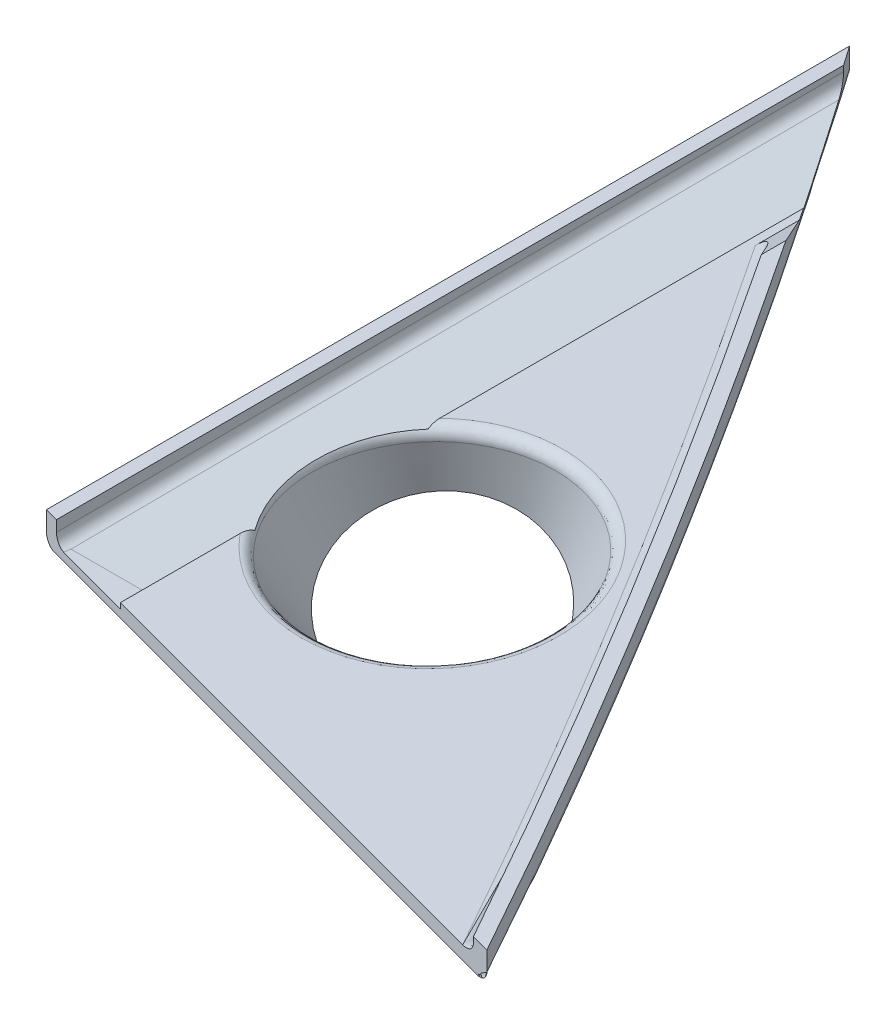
ISO-10303-21;
HEADER;
FILE_DESCRIPTION(('STEP AP214'),'2;1');
FILE_NAME('part.step','',(''),(''),'','','');
FILE_SCHEMA(('AUTOMOTIVE_DESIGN { 1 0 10303 214 1 1 1 1 }'));
ENDSEC;
DATA;
#1=APPLICATION_CONTEXT('core data for automotive mechanical design processes');
#2=APPLICATION_PROTOCOL_DEFINITION('international standard','automotive_design',2000,#1);
#3=PRODUCT_CONTEXT('',#1,'mechanical');
#4=PRODUCT('Part','Part','',(#3));
#5=PRODUCT_RELATED_PRODUCT_CATEGORY('part','',(#4));
#6=PRODUCT_DEFINITION_FORMATION('','',#4);
#7=PRODUCT_DEFINITION_CONTEXT('part definition',#1,'design');
#8=PRODUCT_DEFINITION('design','',#6,#7);
#9=PRODUCT_DEFINITION_SHAPE('','',#8);
#10=(LENGTH_UNIT() NAMED_UNIT(*) SI_UNIT(.MILLI.,.METRE.));
#11=(NAMED_UNIT(*) PLANE_ANGLE_UNIT() SI_UNIT($,.RADIAN.));
#12=(NAMED_UNIT(*) SI_UNIT($,.STERADIAN.) SOLID_ANGLE_UNIT());
#13=UNCERTAINTY_MEASURE_WITH_UNIT(LENGTH_MEASURE(1.E-05),#10,'distance_accuracy_value','');
#14=(GEOMETRIC_REPRESENTATION_CONTEXT(3) GLOBAL_UNCERTAINTY_ASSIGNED_CONTEXT((#13)) GLOBAL_UNIT_ASSIGNED_CONTEXT((#10,
#11,#12)) REPRESENTATION_CONTEXT('',''));
#15=CARTESIAN_POINT('',(0.,0.,0.));
#16=DIRECTION('',(0.,0.,1.));
#17=DIRECTION('',(1.,0.,0.));
#18=AXIS2_PLACEMENT_3D('',#15,#16,#17);
#19=CARTESIAN_POINT('',(18.5,0.,0.));
#20=DIRECTION('',(-1.,0.,0.));
#21=DIRECTION('',(0.,0.,1.));
#22=AXIS2_PLACEMENT_3D('',#19,#20,#21);
#23=PLANE('',#22);
#24=DIRECTION('',(0.,-0.0068025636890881,0.999976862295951));
#25=VECTOR('',#24,1.);
#26=CARTESIAN_POINT('',(18.4999999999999,2.47574062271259,-143.433871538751));
#27=LINE('',#26,#25);
#28=CARTESIAN_POINT('',(18.5,2.31669251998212,-120.053800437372));
#29=VERTEX_POINT('',#28);
#30=CARTESIAN_POINT('',(18.5,1.84936262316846,-51.3563056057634));
#31=VERTEX_POINT('',#30);
#32=EDGE_CURVE('E428',#29,#31,#27,.T.);
#33=ORIENTED_EDGE('',*,*,#32,.T.);
#34=CARTESIAN_POINT('',(55.2819171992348,2.5,-11.0268267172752));
#35=CARTESIAN_POINT('',(54.73758438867,2.5,-11.7044604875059));
#36=CARTESIAN_POINT('',(54.3662036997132,1.86453537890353,-12.1667881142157));
#37=CARTESIAN_POINT('',(56.1324712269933,2.5,-11.7100637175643));
#38=CARTESIAN_POINT('',(55.5548355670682,2.5,-12.3609458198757));
#39=CARTESIAN_POINT('',(55.1607374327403,1.86453537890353,-12.8050248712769));
#40=CARTESIAN_POINT('',(56.9325111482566,2.5,-12.4561851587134));
#41=CARTESIAN_POINT('',(56.3230202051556,2.5,-13.0793988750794));
#42=CARTESIAN_POINT('',(55.9070402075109,1.86275558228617,-13.5033038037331));
#43=CARTESIAN_POINT('',(58.4182946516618,2.5,-14.0607977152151));
#44=CARTESIAN_POINT('',(57.7465148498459,2.5,-14.625215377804));
#45=CARTESIAN_POINT('',(57.2904757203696,1.85565983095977,-15.0070582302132));
#46=CARTESIAN_POINT('',(59.1035092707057,2.5,-14.9197780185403));
#47=CARTESIAN_POINT('',(58.4019300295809,2.5,-15.4539813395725));
#48=CARTESIAN_POINT('',(57.9271035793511,1.85032804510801,-15.8130006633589));
#49=CARTESIAN_POINT('',(60.3484867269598,2.5,-16.734953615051));
#50=CARTESIAN_POINT('',(59.5890816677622,2.5,-17.2050607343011));
#51=CARTESIAN_POINT('',(59.0805752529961,1.83616539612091,-17.5174597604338));
#52=CARTESIAN_POINT('',(60.9071236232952,2.5,-17.6919192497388));
#53=CARTESIAN_POINT('',(60.1200466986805,2.5,-18.1292092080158));
#54=CARTESIAN_POINT('',(59.5963452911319,1.82730492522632,-18.4167108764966));
#55=CARTESIAN_POINT('',(61.8899915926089,2.5,-19.6864721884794));
#56=CARTESIAN_POINT('',(61.0497794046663,2.5,-20.0542953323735));
#57=CARTESIAN_POINT('',(60.499678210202,1.8061356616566,-20.2917538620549));
#58=CARTESIAN_POINT('',(62.3125441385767,2.5,-20.7248833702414));
#59=CARTESIAN_POINT('',(61.4469146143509,2.5,-21.0571991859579));
#60=CARTESIAN_POINT('',(60.8856423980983,1.79378708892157,-21.2683292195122));
#61=CARTESIAN_POINT('',(63.0165373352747,2.5,-22.8645780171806));
#62=CARTESIAN_POINT('',(62.1027903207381,2.5,-23.1219319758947));
#63=CARTESIAN_POINT('',(61.5231839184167,1.76570818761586,-23.2808690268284));
#64=CARTESIAN_POINT('',(63.2958863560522,2.5,-23.9665454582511));
#65=CARTESIAN_POINT('',(62.3591676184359,2.5,-24.1855928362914));
#66=CARTESIAN_POINT('',(61.7727726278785,1.74993227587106,-24.317480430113));
#67=CARTESIAN_POINT('',(63.7090485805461,2.5,-26.2147005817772));
#68=CARTESIAN_POINT('',(62.7296797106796,2.5,-26.3531250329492));
#69=CARTESIAN_POINT('',(62.1336631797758,1.71508551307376,-26.432089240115));
#70=CARTESIAN_POINT('',(63.8405532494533,2.5,-27.3613079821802));
#71=CARTESIAN_POINT('',(62.8409233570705,2.5,-27.4585052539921));
#72=CARTESIAN_POINT('',(62.2427752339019,1.69596764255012,-27.5104782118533));
#73=CARTESIAN_POINT('',(63.9559211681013,2.5,-29.6794316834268));
#74=CARTESIAN_POINT('',(62.9197071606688,2.5,-29.6901552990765));
#75=CARTESIAN_POINT('',(62.3211252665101,1.65455062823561,-29.6900458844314));
#76=CARTESIAN_POINT('',(63.9374690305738,2.5,-30.851058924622));
#77=CARTESIAN_POINT('',(62.884055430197,2.5,-30.8175122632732));
#78=CARTESIAN_POINT('',(62.2881733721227,1.63220684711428,-30.7913190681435));
#79=CARTESIAN_POINT('',(63.7531718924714,2.5,-33.1995045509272));
#80=CARTESIAN_POINT('',(62.6700181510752,2.5,-33.0734461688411));
#81=CARTESIAN_POINT('',(62.083148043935,1.58448691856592,-32.997733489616));
#82=CARTESIAN_POINT('',(63.5851939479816,2.5,-34.376151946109));
#83=CARTESIAN_POINT('',(62.4883523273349,2.5,-34.2026708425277));
#84=CARTESIAN_POINT('',(61.9090646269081,1.55907150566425,-34.1026993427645));
#85=CARTESIAN_POINT('',(63.1044711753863,2.5,-36.7147874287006));
#86=CARTESIAN_POINT('',(61.9857235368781,2.5,-36.4426083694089));
#87=CARTESIAN_POINT('',(61.4248767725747,1.50540218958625,-36.2975392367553));
#88=CARTESIAN_POINT('',(62.7899232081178,2.5,-37.8764021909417));
#89=CARTESIAN_POINT('',(61.6615654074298,2.5,-37.5535714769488));
#90=CARTESIAN_POINT('',(61.1130807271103,1.47711646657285,-37.3870459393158));
#91=CARTESIAN_POINT('',(62.0210604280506,2.5,-40.1652851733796));
#92=CARTESIAN_POINT('',(60.8798670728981,2.5,-39.7375127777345));
#93=CARTESIAN_POINT('',(60.3588914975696,1.41795594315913,-39.5322760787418));
#94=CARTESIAN_POINT('',(61.5653689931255,2.5,-41.2920892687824));
#95=CARTESIAN_POINT('',(60.4193424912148,2.5,-40.8104205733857));
#96=CARTESIAN_POINT('',(59.9152138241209,1.38705792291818,-40.5875483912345));
#97=CARTESIAN_POINT('',(60.5215527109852,2.5,-43.4921391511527));
#98=CARTESIAN_POINT('',(59.3732756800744,2.5,-42.8993893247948));
#99=CARTESIAN_POINT('',(58.9049404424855,1.32298858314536,-42.6462053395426));
#100=CARTESIAN_POINT('',(59.9325237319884,2.5,-44.5649551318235));
#101=CARTESIAN_POINT('',(58.7850400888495,2.5,-43.9151489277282));
#102=CARTESIAN_POINT('',(58.3375065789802,1.28980287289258,-43.6491753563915));
#103=CARTESIAN_POINT('',(58.6316156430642,2.5,-46.6386118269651));
#104=CARTESIAN_POINT('',(57.4942836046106,2.5,-45.871947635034));
#105=CARTESIAN_POINT('',(57.0895381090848,1.22155063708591,-45.5860299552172));
#106=CARTESIAN_POINT('',(57.9193046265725,2.5,-47.639181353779));
#107=CARTESIAN_POINT('',(56.7894046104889,2.5,-46.8125403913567));
#108=CARTESIAN_POINT('',(56.4086061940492,1.18647780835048,-46.5196545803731));
#109=CARTESIAN_POINT('',(56.3835381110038,2.5,-49.5510397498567));
#110=CARTESIAN_POINT('',(55.2783181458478,2.5,-48.6025130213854));
#111=CARTESIAN_POINT('',(54.9454307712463,1.11492937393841,-48.3018360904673));
#112=CARTESIAN_POINT('',(55.5600826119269,2.5,-50.4623286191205));
#113=CARTESIAN_POINT('',(54.4701091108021,2.5,-49.4513733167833));
#114=CARTESIAN_POINT('',(54.1631872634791,1.07845376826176,-49.1503929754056));
#115=CARTESIAN_POINT('',(53.8156857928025,2.5,-52.1797376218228));
#116=CARTESIAN_POINT('',(52.7673292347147,2.5,-51.0431688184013));
#117=CARTESIAN_POINT('',(52.5109374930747,1.0046694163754,-50.7479593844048));
#118=CARTESIAN_POINT('',(52.8951024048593,2.5,-52.9862210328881));
#119=CARTESIAN_POINT('',(51.8711256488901,2.5,-51.7855643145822));
#120=CARTESIAN_POINT('',(51.6412539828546,0.96736410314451,-51.4973129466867));
#121=CARTESIAN_POINT('',(50.9718539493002,2.5,-54.4798365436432));
#122=CARTESIAN_POINT('',(50.0090368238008,2.5,-53.1518900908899));
#123=CARTESIAN_POINT('',(49.8291808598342,0.892583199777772,-52.8837526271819));
#124=CARTESIAN_POINT('',(49.9698035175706,2.5,-55.1677588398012));
#125=CARTESIAN_POINT('',(49.0419038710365,2.5,-53.7752960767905));
#126=CARTESIAN_POINT('',(48.8873382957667,0.855110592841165,-53.5215824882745));
#127=CARTESIAN_POINT('',(47.9005289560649,2.5,-56.4120409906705));
#128=CARTESIAN_POINT('',(47.0559597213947,2.5,-54.8936403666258));
#129=CARTESIAN_POINT('',(46.9472277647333,0.780746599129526,-54.6742342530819));
#130=CARTESIAN_POINT('',(46.8340548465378,2.5,-56.9696450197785));
#131=CARTESIAN_POINT('',(46.0363158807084,2.5,-55.3880939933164));
#132=CARTESIAN_POINT('',(45.9496165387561,0.743853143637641,-55.1902199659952));
#133=CARTESIAN_POINT('',(44.6540724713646,2.5,-57.9432913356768));
#134=CARTESIAN_POINT('',(43.9641814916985,2.5,-56.2413772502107));
#135=CARTESIAN_POINT('',(43.9151663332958,0.671474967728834,-56.0906017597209));
#136=CARTESIAN_POINT('',(43.5413175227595,2.5,-58.3610138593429));
#137=CARTESIAN_POINT('',(42.9113218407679,2.5,-56.599785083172));
#138=CARTESIAN_POINT('',(42.8789724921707,0.635978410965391,-56.4765600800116));
#139=CARTESIAN_POINT('',(41.2878437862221,2.5,-59.0473216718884));
#140=CARTESIAN_POINT('',(40.7918131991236,2.5,-57.1768708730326));
#141=CARTESIAN_POINT('',(40.7851496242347,0.56727547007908,-57.1106011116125));
#142=CARTESIAN_POINT('',(40.1477518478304,2.5,-59.3179528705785));
#143=CARTESIAN_POINT('',(39.7253223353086,2.5,-57.3952249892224));
#144=CARTESIAN_POINT('',(39.7280385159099,0.534043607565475,-57.3605752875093));
#145=CARTESIAN_POINT('',(37.8592764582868,2.5,-59.7051061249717));
#146=CARTESIAN_POINT('',(37.5971459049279,2.5,-57.6911838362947));
#147=CARTESIAN_POINT('',(37.6104389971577,0.47077316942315,-57.7187521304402));
#148=CARTESIAN_POINT('',(36.7112838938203,2.5,-59.8239130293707));
#149=CARTESIAN_POINT('',(36.5362114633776,2.5,-57.7686212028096));
#150=CARTESIAN_POINT('',(36.5502473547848,0.440693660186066,-57.8290564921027));
#151=CARTESIAN_POINT('',(34.4269243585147,2.5,-59.9051903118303));
#152=CARTESIAN_POINT('',(34.4365686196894,2.5,-57.7846107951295));
#153=CARTESIAN_POINT('',(34.444478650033,0.384610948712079,-57.9064398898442));
#154=CARTESIAN_POINT('',(33.2906452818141,2.5,-59.870005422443));
#155=CARTESIAN_POINT('',(33.3992489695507,2.5,-57.7232393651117));
#156=CARTESIAN_POINT('',(33.3989239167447,0.358552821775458,-57.8756666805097));
#157=CARTESIAN_POINT('',(31.0494895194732,2.5,-59.643907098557));
#158=CARTESIAN_POINT('',(31.3624704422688,2.5,-57.4658729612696));
#159=CARTESIAN_POINT('',(31.3400267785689,0.31132689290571,-57.6718912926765));
#160=CARTESIAN_POINT('',(29.9443959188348,2.5,-59.4551835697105));
#161=CARTESIAN_POINT('',(30.3650319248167,2.5,-57.2703069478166));
#162=CARTESIAN_POINT('',(30.3264382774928,0.290095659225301,-57.500888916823));
#163=CARTESIAN_POINT('',(27.7848402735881,2.5,-58.9254758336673));
#164=CARTESIAN_POINT('',(28.4215207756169,2.5,-56.7504710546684));
#165=CARTESIAN_POINT('',(28.348358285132,0.25321686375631,-57.0200614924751));
#166=CARTESIAN_POINT('',(26.729935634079,2.5,-58.5863083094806));
#167=CARTESIAN_POINT('',(27.4780167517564,2.5,-56.4270902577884));
#168=CARTESIAN_POINT('',(27.3834295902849,0.237506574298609,-56.7118926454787));
#169=CARTESIAN_POINT('',(24.6890252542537,2.5,-57.7619806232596));
#170=CARTESIAN_POINT('',(25.6538327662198,2.5,-55.658365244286));
#171=CARTESIAN_POINT('',(25.5185412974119,0.212194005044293,-55.9624539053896));
#172=CARTESIAN_POINT('',(23.7025100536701,2.5,-57.278086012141));
#173=CARTESIAN_POINT('',(24.7760980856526,2.5,-55.2144398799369));
#174=CARTESIAN_POINT('',(24.6180991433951,0.202540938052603,-55.5223377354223));
#175=CARTESIAN_POINT('',(21.8152903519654,2.5,-56.1732168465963));
#176=CARTESIAN_POINT('',(23.0934131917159,2.5,-54.211523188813));
#177=CARTESIAN_POINT('',(22.8967793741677,0.189659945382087,-54.5168895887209));
#178=CARTESIAN_POINT('',(20.9142222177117,2.5,-55.5528642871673));
#179=CARTESIAN_POINT('',(22.2915412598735,2.5,-53.6544741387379));
#180=CARTESIAN_POINT('',(22.0755643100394,0.186403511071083,-53.9521257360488));
#181=CARTESIAN_POINT('',(19.2131141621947,2.5,-54.1863902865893));
#182=CARTESIAN_POINT('',(20.7698918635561,2.5,-52.4321565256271));
#183=CARTESIAN_POINT('',(20.5258075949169,0.186403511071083,-52.7072299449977));
#184=CARTESIAN_POINT('',(18.4130742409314,2.5,-53.4402688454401));
#185=CARTESIAN_POINT('',(20.0530541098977,2.5,-51.7692493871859));
#186=CARTESIAN_POINT('',(19.7972659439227,0.189659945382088,-52.0270980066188));
#187=CARTESIAN_POINT('',(16.9272907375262,2.5,-51.8356562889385));
#188=CARTESIAN_POINT('',(18.7109246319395,2.5,-50.3423791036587));
#189=CARTESIAN_POINT('',(18.4443345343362,0.202540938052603,-50.5630473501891));
#190=CARTESIAN_POINT('',(16.2420761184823,2.5,-50.9766759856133));
#191=CARTESIAN_POINT('',(18.0881932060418,2.5,-49.5810030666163));
#192=CARTESIAN_POINT('',(17.8204267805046,0.212194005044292,-49.7786766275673));
#193=CARTESIAN_POINT('',(14.9970986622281,2.5,-49.1615003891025));
#194=CARTESIAN_POINT('',(16.9442387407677,2.5,-47.9654680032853));
#195=CARTESIAN_POINT('',(16.6865287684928,0.237506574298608,-48.119236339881));
#196=CARTESIAN_POINT('',(14.4384617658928,2.5,-48.2045347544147));
#197=CARTESIAN_POINT('',(16.4250362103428,2.5,-47.1138790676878));
#198=CARTESIAN_POINT('',(16.1775610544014,0.253216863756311,-47.2434468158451));
#199=CARTESIAN_POINT('',(13.4555937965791,2.5,-46.2099818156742));
#200=CARTESIAN_POINT('',(15.498388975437,2.5,-45.3281607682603));
#201=CARTESIAN_POINT('',(15.2815514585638,0.290095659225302,-45.4155621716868));
#202=CARTESIAN_POINT('',(13.0330412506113,2.5,-45.1715706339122));
#203=CARTESIAN_POINT('',(15.0923662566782,2.5,-44.396347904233));
#204=CARTESIAN_POINT('',(14.8960325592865,0.311326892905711,-44.4626830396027));
#205=CARTESIAN_POINT('',(12.3290480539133,2.5,-43.0318759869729));
#206=CARTESIAN_POINT('',(14.4019059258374,2.5,-42.4629651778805));
#207=CARTESIAN_POINT('',(14.253133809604,0.358552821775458,-42.4961472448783));
#208=CARTESIAN_POINT('',(12.0496990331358,2.5,-41.9299085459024));
#209=CARTESIAN_POINT('',(14.1183227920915,2.5,-41.4632756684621));
#210=CARTESIAN_POINT('',(13.9976536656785,0.384610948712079,-41.4818190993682));
#211=CARTESIAN_POINT('',(11.6365368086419,2.5,-39.6817534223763));
#212=CARTESIAN_POINT('',(13.681234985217,2.5,-39.4095692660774));
#213=CARTESIAN_POINT('',(13.6191948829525,0.440693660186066,-39.4088938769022));
#214=CARTESIAN_POINT('',(11.5050321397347,2.5,-38.5351460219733));
#215=CARTESIAN_POINT('',(13.5281042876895,2.5,-38.3568920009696));
#216=CARTESIAN_POINT('',(13.4983182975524,0.47077316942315,-38.3498555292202));
#217=CARTESIAN_POINT('',(11.3896642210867,2.5,-36.2170223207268));
#218=CARTESIAN_POINT('',(13.35824872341,2.5,-36.214959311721));
#219=CARTESIAN_POINT('',(13.3914978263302,0.534043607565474,-36.2048362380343));
#220=CARTESIAN_POINT('',(11.4081163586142,2.5,-35.0453950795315));
#221=CARTESIAN_POINT('',(13.341522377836,2.5,-35.1264734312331));
#222=CARTESIAN_POINT('',(13.4076701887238,0.567275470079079,-35.1186919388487));
#223=CARTESIAN_POINT('',(11.5924134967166,2.5,-32.6969494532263));
#224=CARTESIAN_POINT('',(13.4480504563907,2.5,-32.9323912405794));
#225=CARTESIAN_POINT('',(13.5753519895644,0.63597841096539,-32.9374113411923));
#226=CARTESIAN_POINT('',(11.7603914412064,2.5,-31.5203020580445));
#227=CARTESIAN_POINT('',(13.5710227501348,2.5,-31.8270191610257));
#228=CARTESIAN_POINT('',(13.7288200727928,0.671474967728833,-31.8423729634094));
#229=CARTESIAN_POINT('',(12.2411142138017,2.5,-29.1816665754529));
#230=CARTESIAN_POINT('',(13.9574663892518,2.5,-29.6196463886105));
#231=CARTESIAN_POINT('',(14.1693795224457,0.74385314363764,-29.6616431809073));
#232=CARTESIAN_POINT('',(12.5556621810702,2.5,-28.0200518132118));
#233=CARTESIAN_POINT('',(14.2204462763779,2.5,-28.5173762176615));
#234=CARTESIAN_POINT('',(14.4581354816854,0.780746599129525,-28.5762449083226));
#235=CARTESIAN_POINT('',(13.3245249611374,2.5,-25.7311688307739));
#236=CARTESIAN_POINT('',(14.8843000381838,2.5,-26.3370170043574));
#237=CARTESIAN_POINT('',(15.1653719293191,0.855110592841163,-26.4332443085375));
#238=CARTESIAN_POINT('',(13.7802163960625,2.5,-24.6043647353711));
#239=CARTESIAN_POINT('',(15.2845211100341,2.5,-25.2582194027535));
#240=CARTESIAN_POINT('',(15.585130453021,0.892583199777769,-25.3760323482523));
#241=CARTESIAN_POINT('',(14.8240326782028,2.5,-22.4043148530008));
#242=CARTESIAN_POINT('',(16.2172280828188,2.5,-23.1453354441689));
#243=CARTESIAN_POINT('',(16.5482620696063,0.967364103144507,-23.3076509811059));
#244=CARTESIAN_POINT('',(15.4130616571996,2.5,-21.3314988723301));
#245=CARTESIAN_POINT('',(16.7489330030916,2.5,-22.1101437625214));
#246=CARTESIAN_POINT('',(17.092479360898,1.00466941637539,-22.2968553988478));
#247=CARTESIAN_POINT('',(16.7139697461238,2.5,-19.2578421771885));
#248=CARTESIAN_POINT('',(17.9361550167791,2.5,-20.1042085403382));
#249=CARTESIAN_POINT('',(18.2962312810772,1.07845376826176,-20.339017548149));
#250=CARTESIAN_POINT('',(17.4262807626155,2.5,-18.2572726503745));
#251=CARTESIAN_POINT('',(18.5907930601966,2.5,-19.1319870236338));
#252=CARTESIAN_POINT('',(18.9561714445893,1.11492937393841,-19.3922162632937));
#253=CARTESIAN_POINT('',(18.9620472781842,2.5,-16.3454142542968));
#254=CARTESIAN_POINT('',(20.012861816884,2.5,-17.2705078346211));
#255=CARTESIAN_POINT('',(20.3809623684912,1.18647780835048,-17.5792010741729));
#256=CARTESIAN_POINT('',(19.7855027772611,2.5,-15.434125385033));
#257=CARTESIAN_POINT('',(20.7793536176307,2.5,-16.3794077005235));
#258=CARTESIAN_POINT('',(21.1458131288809,1.2215506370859,-16.7129871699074));
#259=CARTESIAN_POINT('',(21.5298995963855,2.5,-13.7167163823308));
#260=CARTESIAN_POINT('',(22.4118297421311,2.5,-14.6971071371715));
#261=CARTESIAN_POINT('',(22.7680397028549,1.28980287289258,-15.0767683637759));
#262=CARTESIAN_POINT('',(22.4504829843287,2.5,-12.9102329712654));
#263=CARTESIAN_POINT('',(23.2768697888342,2.5,-13.9037003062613));
#264=CARTESIAN_POINT('',(23.6250760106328,1.32298858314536,-14.3064315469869));
#265=CARTESIAN_POINT('',(24.3737314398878,2.5,-11.4166174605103));
#266=CARTESIAN_POINT('',(25.0911645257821,2.5,-12.4318372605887));
#267=CARTESIAN_POINT('',(25.4174892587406,1.38705792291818,-12.876055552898));
#268=CARTESIAN_POINT('',(25.3757818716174,2.5,-10.7286951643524));
#269=CARTESIAN_POINT('',(26.039544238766,2.5,-11.7508160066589));
#270=CARTESIAN_POINT('',(26.3522806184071,1.41795594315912,-12.215287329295));
#271=CARTESIAN_POINT('',(27.4450564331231,2.5,-9.48441301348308));
#272=CARTESIAN_POINT('',(28.0035779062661,2.5,-10.5166265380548));
#273=CARTESIAN_POINT('',(28.2844448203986,1.47711646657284,-11.0163064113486));
#274=CARTESIAN_POINT('',(28.5115305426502,2.5,-8.92680898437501));
#275=CARTESIAN_POINT('',(29.0185196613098,2.5,-9.96055931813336));
#276=CARTESIAN_POINT('',(29.2811002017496,1.50540218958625,-10.476936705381));
#277=CARTESIAN_POINT('',(30.6915129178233,2.5,-7.9531626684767));
#278=CARTESIAN_POINT('',(31.0974023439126,2.5,-8.98680235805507));
#279=CARTESIAN_POINT('',(31.3199219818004,1.55907150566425,-9.53091039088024));
#280=CARTESIAN_POINT('',(31.8042678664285,2.5,-7.53544014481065));
#281=CARTESIAN_POINT('',(32.1608987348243,2.5,-8.56593864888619));
#282=CARTESIAN_POINT('',(32.3613649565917,1.58448691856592,-9.12268116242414));
#283=CARTESIAN_POINT('',(34.0577416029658,2.5,-6.84913233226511));
#284=CARTESIAN_POINT('',(34.3176244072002,2.5,-7.87053652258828));
#285=CARTESIAN_POINT('',(34.4716789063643,1.63220684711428,-8.4467558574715));
#286=CARTESIAN_POINT('',(35.1978335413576,2.5,-6.57850113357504));
#287=CARTESIAN_POINT('',(35.4107789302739,2.5,-7.59265532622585));
#288=CARTESIAN_POINT('',(35.5399452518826,1.65455062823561,-8.1771348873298));
#289=CARTESIAN_POINT('',(37.4863089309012,2.5,-6.19134787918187));
#290=CARTESIAN_POINT('',(37.6069266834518,2.5,-7.18842289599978));
#291=CARTESIAN_POINT('',(37.6851420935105,1.69596764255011,-7.78370830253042));
#292=CARTESIAN_POINT('',(38.6343014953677,2.5,-6.07254097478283));
#293=CARTESIAN_POINT('',(38.7102932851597,2.5,-7.0587204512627));
#294=CARTESIAN_POINT('',(38.7616926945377,1.71508551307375,-7.65774394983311));
#295=CARTESIAN_POINT('',(40.9186610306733,2.5,-5.99126369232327));
#296=CARTESIAN_POINT('',(40.9067304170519,2.5,-6.95317918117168));
#297=CARTESIAN_POINT('',(40.9043767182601,1.74993227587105,-7.55421818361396));
#298=CARTESIAN_POINT('',(42.0549401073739,2.5,-6.02644858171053));
#299=CARTESIAN_POINT('',(42.0006509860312,2.5,-6.97419187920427));
#300=CARTESIAN_POINT('',(41.9704203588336,1.76570818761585,-7.57443406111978));
#301=CARTESIAN_POINT('',(44.2960958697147,2.5,-6.25254690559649));
#302=CARTESIAN_POINT('',(44.1582334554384,2.5,-7.16946687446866));
#303=CARTESIAN_POINT('',(44.0730844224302,1.79378708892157,-7.7630593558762));
#304=CARTESIAN_POINT('',(45.4011894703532,2.5,-6.44127043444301));
#305=CARTESIAN_POINT('',(45.223174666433,2.5,-7.34102657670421));
#306=CARTESIAN_POINT('',(45.1099078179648,1.80613566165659,-7.92938743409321));
#307=CARTESIAN_POINT('',(47.5607451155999,2.5,-6.97097817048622));
#308=CARTESIAN_POINT('',(47.3034409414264,2.5,-7.83382645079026));
#309=CARTESIAN_POINT('',(47.1356159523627,1.82730492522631,-8.40719818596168));
#310=CARTESIAN_POINT('',(48.615649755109,2.5,-7.31014569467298));
#311=CARTESIAN_POINT('',(48.320333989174,2.5,-8.15304862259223));
#312=CARTESIAN_POINT('',(48.1249210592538,1.83616539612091,-8.71695084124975));
#313=CARTESIAN_POINT('',(50.6565601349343,2.5,-8.13447338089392));
#314=CARTESIAN_POINT('',(50.2861879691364,2.5,-8.93473026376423));
#315=CARTESIAN_POINT('',(50.0379895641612,1.85032804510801,-9.47579641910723));
#316=CARTESIAN_POINT('',(51.6430753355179,2.5,-8.61836799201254));
#317=CARTESIAN_POINT('',(51.2367744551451,2.5,-9.39604079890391));
#318=CARTESIAN_POINT('',(50.9622386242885,1.85565983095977,-9.92368246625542));
#319=CARTESIAN_POINT('',(53.5302950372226,2.5,-9.72323715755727));
#320=CARTESIAN_POINT('',(53.0531509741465,2.5,-10.4527630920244));
#321=CARTESIAN_POINT('',(52.7289052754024,1.86275558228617,-10.9503567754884));
#322=CARTESIAN_POINT('',(54.4313631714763,2.5,-10.3435897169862));
#323=CARTESIAN_POINT('',(53.9203332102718,2.5,-11.0479751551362));
#324=CARTESIAN_POINT('',(53.5716699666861,1.86453537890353,-11.5285513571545));
#325=CARTESIAN_POINT('',(55.2819171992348,2.5,-11.0268267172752));
#326=CARTESIAN_POINT('',(54.73758438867,2.5,-11.7044604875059));
#327=CARTESIAN_POINT('',(54.3662036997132,1.86453537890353,-12.1667881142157));
#328=(BOUNDED_SURFACE() B_SPLINE_SURFACE(3,2,((#34,#35,#36),(#37,#38,#39),(#40,#41,#42),(#43,
#44,#45),(#46,#47,#48),(#49,#50,#51),(#52,#53,#54),(#55,#56,#57),(#58,#59,#60),(#61,#62,#63),
(#64,#65,#66),(#67,#68,#69),(#70,#71,#72),(#73,#74,#75),(#76,#77,#78),(#79,#80,#81),(#82,#83,
#84),(#85,#86,#87),(#88,#89,#90),(#91,#92,#93),(#94,#95,#96),(#97,#98,#99),(#100,#101,#102),
(#103,#104,#105),(#106,#107,#108),(#109,#110,#111),(#112,#113,#114),(#115,#116,#117),(#118,#119,
#120),(#121,#122,#123),(#124,#125,#126),(#127,#128,#129),(#130,#131,#132),(#133,#134,#135),
(#136,#137,#138),(#139,#140,#141),(#142,#143,#144),(#145,#146,#147),(#148,#149,#150),(#151,#152,
#153),(#154,#155,#156),(#157,#158,#159),(#160,#161,#162),(#163,#164,#165),(#166,#167,#168),
(#169,#170,#171),(#172,#173,#174),(#175,#176,#177),(#178,#179,#180),(#181,#182,#183),(#184,#185,
#186),(#187,#188,#189),(#190,#191,#192),(#193,#194,#195),(#196,#197,#198),(#199,#200,#201),
(#202,#203,#204),(#205,#206,#207),(#208,#209,#210),(#211,#212,#213),(#214,#215,#216),(#217,#218,
#219),(#220,#221,#222),(#223,#224,#225),(#226,#227,#228),(#229,#230,#231),(#232,#233,#234),
(#235,#236,#237),(#238,#239,#240),(#241,#242,#243),(#244,#245,#246),(#247,#248,#249),(#250,#251,
#252),(#253,#254,#255),(#256,#257,#258),(#259,#260,#261),(#262,#263,#264),(#265,#266,#267),
(#268,#269,#270),(#271,#272,#273),(#274,#275,#276),(#277,#278,#279),(#280,#281,#282),(#283,#284,
#285),(#286,#287,#288),(#289,#290,#291),(#292,#293,#294),(#295,#296,#297),(#298,#299,#300),
(#301,#302,#303),(#304,#305,#306),(#307,#308,#309),(#310,#311,#312),(#313,#314,#315),(#316,#317,
#318),(#319,#320,#321),(#322,#323,#324),(#325,#326,#327)),.UNSPECIFIED.,.T.,.F.,
.F.) B_SPLINE_SURFACE_WITH_KNOTS((4,2,2,2,2,2,2,2,2,2,2,2,2,2,2,2,2,2,2,2,2,2,2,2,2,2,2,2,2,2,2,
2,2,2,2,2,2,2,2,2,2,2,2,2,2,2,2,2,4),(3,3),(0.,3.27003526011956,6.55474338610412,9.867613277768,
13.2199060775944,16.6198591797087,20.0721943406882,23.5779349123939,27.1344998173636,
30.7360228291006,34.3738419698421,38.0371093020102,41.7134803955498,45.3898514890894,
49.0531188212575,52.690937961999,56.292460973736,59.8490258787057,63.3547664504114,
66.8071016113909,70.2070547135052,73.5593475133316,76.8722174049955,80.1569255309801,
83.4269607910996,86.6969960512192,89.9817041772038,93.2945740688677,96.646866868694,
100.046819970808,103.499155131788,107.004895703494,110.561460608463,114.1629836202,
117.800802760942,121.46407009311,125.140441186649,128.816812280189,132.480079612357,
136.117898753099,139.719421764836,143.275986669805,146.781727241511,150.234062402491,
153.634015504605,156.986308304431,160.299178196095,163.58388632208,166.853921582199),(0.,1.),
.UNSPECIFIED.) GEOMETRIC_REPRESENTATION_ITEM() RATIONAL_B_SPLINE_SURFACE(((1.,0.91713349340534,
1.),(1.,0.91713349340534,1.),(1.,0.916891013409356,1.),(1.,0.915923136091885,1.),(1.,
0.915195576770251,1.),(1.,0.913259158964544,1.),(1.,0.912046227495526,1.),(1.,0.909140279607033,
1.),(1.,0.907441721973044,1.),(1.,0.90356563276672,1.),(1.,0.901381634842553,1.),(1.,
0.896536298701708,1.),(1.,0.893868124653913,1.),(1.,0.888057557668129,1.),(1.,0.884908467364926,
1.),(1.,0.878141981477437,1.),(1.,0.874518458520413,1.),(1.,0.866813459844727,1.),(1.,
0.862726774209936,1.),(1.,0.85411224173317,1.),(1.,0.849580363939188,1.),(1.,0.840101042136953,
1.),(1.,0.835150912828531,1.),(1.,0.824872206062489,1.),(1.,0.819542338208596,1.),(1.,
0.808555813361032,1.),(1.,0.802899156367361,1.),(1.,0.791328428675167,1.),(1.,0.785415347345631,
1.),(1.,0.773421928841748,1.),(1.,0.767343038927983,1.),(1.,0.755131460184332,1.),(1.,
0.748999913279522,1.),(1.,0.736821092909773,1.),(1.,0.73077372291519,1.),(1.,0.718925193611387,
1.),(1.,0.713121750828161,1.),(1.,0.701943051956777,1.),(1.,0.696562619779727,1.),(1.,
0.686424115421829,1.),(1.,0.681657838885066,1.),(1.,0.672941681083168,1.),(1.,0.668981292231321,
1.),(1.,0.66205449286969,1.),(1.,0.659076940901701,1.),(1.,0.654258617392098,1.),(1.,
0.652408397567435,1.),(1.,0.649935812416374,1.),(1.,0.649307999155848,1.),(1.,0.649307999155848,
1.),(1.,0.649935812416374,1.),(1.,0.652408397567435,1.),(1.,0.654258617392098,1.),(1.,
0.659076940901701,1.),(1.,0.66205449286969,1.),(1.,0.668981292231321,1.),(1.,0.672941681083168,
1.),(1.,0.681657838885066,1.),(1.,0.686424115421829,1.),(1.,0.696562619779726,1.),(1.,
0.701943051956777,1.),(1.,0.713121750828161,1.),(1.,0.718925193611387,1.),(1.,0.73077372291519,
1.),(1.,0.736821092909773,1.),(1.,0.748999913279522,1.),(1.,0.755131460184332,1.),(1.,
0.767343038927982,1.),(1.,0.773421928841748,1.),(1.,0.785415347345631,1.),(1.,0.791328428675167,
1.),(1.,0.802899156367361,1.),(1.,0.808555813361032,1.),(1.,0.819542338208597,1.),(1.,
0.824872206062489,1.),(1.,0.835150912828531,1.),(1.,0.840101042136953,1.),(1.,0.849580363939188,
1.),(1.,0.85411224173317,1.),(1.,0.862726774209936,1.),(1.,0.866813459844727,1.),(1.,
0.874518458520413,1.),(1.,0.878141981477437,1.),(1.,0.884908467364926,1.),(1.,0.888057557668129,
1.),(1.,0.893868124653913,1.),(1.,0.896536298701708,1.),(1.,0.901381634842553,1.),(1.,
0.90356563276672,1.),(1.,0.907441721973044,1.),(1.,0.909140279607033,1.),(1.,0.912046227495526,
1.),(1.,0.913259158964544,1.),(1.,0.91519557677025,1.),(1.,0.915923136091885,1.),(1.,
0.916891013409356,1.),(1.,0.91713349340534,1.),(1.,0.91713349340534,1.))) REPRESENTATION_ITEM('') SURFACE());
#329=CARTESIAN_POINT('',(18.5,1.84936262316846,-51.3563056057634));
#330=CARTESIAN_POINT('',(18.5,1.89939964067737,-51.4250306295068));
#331=CARTESIAN_POINT('',(18.5,1.94624331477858,-51.4960008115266));
#332=CARTESIAN_POINT('',(18.5,2.03377026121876,-51.6415354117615));
#333=CARTESIAN_POINT('',(18.5,2.07446100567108,-51.7160953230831));
#334=CARTESIAN_POINT('',(18.5,2.14994351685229,-51.867912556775));
#335=CARTESIAN_POINT('',(18.5,2.18474850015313,-51.9451633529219));
#336=CARTESIAN_POINT('',(18.5,2.24877314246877,-52.101961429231));
#337=CARTESIAN_POINT('',(18.5,2.27799052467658,-52.1815096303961));
#338=CARTESIAN_POINT('',(18.5,2.36148867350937,-52.4350044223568));
#339=CARTESIAN_POINT('',(18.5,2.4059369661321,-52.6122743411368));
#340=CARTESIAN_POINT('',(18.5,2.47017713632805,-52.9714255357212));
#341=CARTESIAN_POINT('',(18.5,2.48993442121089,-53.1533129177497));
#342=CARTESIAN_POINT('',(18.5,2.50132634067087,-53.4459769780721));
#343=CARTESIAN_POINT('',(18.5,2.50098263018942,-53.5564875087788));
#344=CARTESIAN_POINT('',(18.5,2.49071696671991,-53.7770650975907));
#345=CARTESIAN_POINT('',(18.5,2.48079692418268,-53.8871322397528));
#346=CARTESIAN_POINT('',(18.5,2.45098730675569,-54.1059339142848));
#347=CARTESIAN_POINT('',(18.5,2.43109758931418,-54.2146684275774));
#348=CARTESIAN_POINT('',(18.5,2.38081968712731,-54.429791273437));
#349=CARTESIAN_POINT('',(18.5,2.35042042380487,-54.536177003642));
#350=CARTESIAN_POINT('',(18.5,2.31452218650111,-54.6407655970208));
#351=B_SPLINE_CURVE_WITH_KNOTS('',3,(#329,#330,#331,#332,#333,#334,#335,#336,#337,#338,#339,
#340,#341,#342,#343,#344,#345,#346,#347,#348,#349,#350),.UNSPECIFIED.,.F.,.F.,(4,2,2,2,2,2,2,2,
2,2,4),(0.,0.25484815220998,0.509384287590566,0.763341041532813,1.01740105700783,
1.56372278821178,2.11080907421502,2.44197811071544,2.7730810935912,3.10418881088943,
3.43564663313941),.UNSPECIFIED.);
#352=CARTESIAN_POINT('',(18.5000000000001,2.5,-53.4878227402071));
#353=VERTEX_POINT('',#352);
#354=EDGE_CURVE('E373',#31,#353,#351,.T.);
#355=ORIENTED_EDGE('',*,*,#354,.T.);
#356=DIRECTION('',(0.,0.,1.));
#357=VECTOR('',#356,1.);
#358=CARTESIAN_POINT('',(18.5000000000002,2.5,998.432682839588));
#359=LINE('',#358,#357);
#360=CARTESIAN_POINT('',(18.5,2.5,-120.053800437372));
#361=VERTEX_POINT('',#360);
#362=EDGE_CURVE('E451',#361,#353,#359,.T.);
#363=ORIENTED_EDGE('',*,*,#362,.F.);
#364=DIRECTION('',(0.,-1.,0.));
#365=VECTOR('',#364,1.);
#366=CARTESIAN_POINT('',(18.5,2.5,-120.053800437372));
#367=LINE('',#366,#365);
#368=EDGE_CURVE('E202',#361,#29,#367,.T.);
#369=ORIENTED_EDGE('',*,*,#368,.T.);
#370=EDGE_LOOP('',(#33,#355,#363,#369));
#371=FACE_BOUND('',#370,.T.);
#372=ADVANCED_FACE('F41',(#371),#23,.T.);
#373=CARTESIAN_POINT('',(-1639.50723361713,2.5,998.432682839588));
#374=DIRECTION('',(0.,1.,0.));
#375=DIRECTION('',(0.,0.,1.));
#376=AXIS2_PLACEMENT_3D('',#373,#374,#375);
#377=PLANE('',#376);
#378=ORIENTED_EDGE('',*,*,#362,.T.);
#379=CARTESIAN_POINT('',(37.672792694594,2.5,-32.9482270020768));
#380=DIRECTION('',(0.,1.,0.));
#381=DIRECTION('',(0.626255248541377,0.,0.779618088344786));
#382=AXIS2_PLACEMENT_3D('',#379,#380,#381);
#383=ELLIPSE('',#382,28.1181268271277,24.9848341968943);
#384=CARTESIAN_POINT('',(18.5000000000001,2.5,-16.9265164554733));
#385=VERTEX_POINT('',#384);
#386=EDGE_CURVE('E408',#353,#385,#383,.F.);
#387=ORIENTED_EDGE('',*,*,#386,.T.);
#388=CARTESIAN_POINT('',(18.5000000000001,2.5,4.95706005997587));
#389=VERTEX_POINT('',#388);
#390=EDGE_CURVE('E442',#385,#389,#359,.T.);
#391=ORIENTED_EDGE('',*,*,#390,.T.);
#392=DIRECTION('',(0.965925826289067,0.,0.258819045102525));
#393=VECTOR('',#392,1.);
#394=CARTESIAN_POINT('',(0.,2.5,0.));
#395=LINE('',#394,#393);
#396=CARTESIAN_POINT('',(104.068919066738,2.5,27.8851828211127));
#397=VERTEX_POINT('',#396);
#398=EDGE_CURVE('E204',#389,#397,#395,.T.);
#399=ORIENTED_EDGE('',*,*,#398,.T.);
#400=CARTESIAN_POINT('',(-1639.50723361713,2.5,998.432682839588));
#401=DIRECTION('',(0.,1.,0.));
#402=DIRECTION('',(0.,0.,1.));
#403=AXIS2_PLACEMENT_3D('',#400,#401,#402);
#404=CIRCLE('',#403,1995.5);
#405=CARTESIAN_POINT('',(20.,2.5,-109.744194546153));
#406=VERTEX_POINT('',#405);
#407=EDGE_CURVE('E194',#397,#406,#404,.T.);
#408=ORIENTED_EDGE('',*,*,#407,.T.);
#409=DIRECTION('',(0.,0.,1.));
#410=VECTOR('',#409,1.);
#411=CARTESIAN_POINT('',(20.,2.5,-125.));
#412=LINE('',#411,#410);
#413=CARTESIAN_POINT('',(20.,2.5,-117.827027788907));
#414=VERTEX_POINT('',#413);
#415=EDGE_CURVE('E176',#414,#406,#412,.T.);
#416=ORIENTED_EDGE('',*,*,#415,.F.);
#417=CARTESIAN_POINT('',(-1639.50723361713,2.5,998.432682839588));
#418=DIRECTION('',(0.,1.,0.));
#419=DIRECTION('',(0.,0.,1.));
#420=AXIS2_PLACEMENT_3D('',#417,#418,#419);
#421=CIRCLE('',#420,2000.);
#422=EDGE_CURVE('E191',#414,#361,#421,.T.);
#423=ORIENTED_EDGE('',*,*,#422,.T.);
#424=EDGE_LOOP('',(#378,#387,#391,#399,#408,#416,#423));
#425=FACE_BOUND('',#424,.T.);
#426=ADVANCED_FACE('F190',(#425),#377,.T.);
#427=CARTESIAN_POINT('',(0.,2.5,0.));
#428=DIRECTION('',(0.258819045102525,0.,-0.965925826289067));
#429=DIRECTION('',(-0.965925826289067,0.,-0.258819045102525));
#430=AXIS2_PLACEMENT_3D('',#427,#428,#429);
#431=PLANE('',#430);
#432=DIRECTION('',(0.965925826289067,0.,0.258819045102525));
#433=VECTOR('',#432,1.);
#434=CARTESIAN_POINT('',(0.,0.,0.));
#435=LINE('',#434,#433);
#436=CARTESIAN_POINT('',(2.,0.,0.535898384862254));
#437=VERTEX_POINT('',#436);
#438=CARTESIAN_POINT('',(107.429727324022,0.,28.7857086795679));
#439=VERTEX_POINT('',#438);
#440=EDGE_CURVE('E209',#437,#439,#435,.T.);
#441=ORIENTED_EDGE('',*,*,#440,.T.);
#442=CARTESIAN_POINT('',(107.429727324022,0.,28.7857086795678));
#443=CARTESIAN_POINT('',(107.530849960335,1.86073107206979E-05,28.8128044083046));
#444=CARTESIAN_POINT('',(107.631984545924,0.00425012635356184,28.83990333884));
#445=CARTESIAN_POINT('',(107.833707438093,0.0212845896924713,28.8939548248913));
#446=CARTESIAN_POINT('',(107.934294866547,0.034098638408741,28.9209071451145));
#447=CARTESIAN_POINT('',(108.135020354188,0.0686048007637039,28.9746913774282));
#448=CARTESIAN_POINT('',(108.235145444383,0.0903787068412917,29.0015198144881));
#449=CARTESIAN_POINT('',(108.433059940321,0.143056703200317,29.054550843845));
#450=CARTESIAN_POINT('',(108.530850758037,0.173955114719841,29.0807538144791));
#451=CARTESIAN_POINT('',(108.764936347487,0.260726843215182,29.1434768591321));
#452=CARTESIAN_POINT('',(108.899544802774,0.321620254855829,29.1795450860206));
#453=CARTESIAN_POINT('',(109.157786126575,0.464111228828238,29.2487406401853));
#454=CARTESIAN_POINT('',(109.281454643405,0.545637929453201,29.2818775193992));
#455=CARTESIAN_POINT('',(109.4832559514,0.707296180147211,29.3359500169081));
#456=CARTESIAN_POINT('',(109.565000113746,0.782578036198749,29.3578532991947));
#457=CARTESIAN_POINT('',(109.716028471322,0.945639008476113,29.3983212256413));
#458=CARTESIAN_POINT('',(109.785324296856,1.03340632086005,29.4168889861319));
#459=CARTESIAN_POINT('',(109.895371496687,1.20237356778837,29.4463760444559));
#460=CARTESIAN_POINT('',(109.939053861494,1.28152047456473,29.4580806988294));
#461=CARTESIAN_POINT('',(110.013166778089,1.44613894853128,29.4779391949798));
#462=CARTESIAN_POINT('',(110.043625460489,1.53159663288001,29.4861005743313));
#463=CARTESIAN_POINT('',(110.082548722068,1.68109397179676,29.4965300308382));
#464=CARTESIAN_POINT('',(110.094841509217,1.74408104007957,29.4998238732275));
#465=CARTESIAN_POINT('',(110.111375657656,1.87135548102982,29.5042541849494));
#466=CARTESIAN_POINT('',(110.115593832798,1.93564606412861,29.5053844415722));
#467=CARTESIAN_POINT('',(110.115544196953,2.00000000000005,29.5053711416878));
#468=B_SPLINE_CURVE_WITH_KNOTS('',3,(#442,#443,#444,#445,#446,#447,#448,#449,#450,#451,#452,
#453,#454,#455,#456,#457,#458,#459,#460,#461,#462,#463,#464,#465,#466,#467),.UNSPECIFIED.,.F.,
.F.,(4,2,2,2,2,2,2,2,2,2,2,2,4),(0.,0.314003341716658,0.628413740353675,0.94576033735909,
1.2629098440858,1.71754852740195,2.17064652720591,2.50929021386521,2.84761584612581,
3.12001307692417,3.39182796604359,3.58408071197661,3.77688468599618),.UNSPECIFIED.);
#469=CARTESIAN_POINT('',(110.115544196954,2.,29.5053711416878));
#470=VERTEX_POINT('',#469);
#471=EDGE_CURVE('E295',#439,#470,#468,.T.);
#472=ORIENTED_EDGE('',*,*,#471,.T.);
#473=DIRECTION('',(0.,-1.,0.));
#474=VECTOR('',#473,1.);
#475=CARTESIAN_POINT('',(110.115544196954,2.5,29.5053711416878));
#476=LINE('',#475,#474);
#477=CARTESIAN_POINT('',(110.115544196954,5.5,29.5053711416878));
#478=VERTEX_POINT('',#477);
#479=EDGE_CURVE('E207',#478,#470,#476,.T.);
#480=ORIENTED_EDGE('',*,*,#479,.F.);
#481=DIRECTION('',(0.96592582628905,0.,0.258819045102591));
#482=VECTOR('',#481,1.);
#483=CARTESIAN_POINT('',(110.115544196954,5.5,29.5053711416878));
#484=LINE('',#483,#482);
#485=CARTESIAN_POINT('',(106.757880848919,5.5,28.6056879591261));
#486=VERTEX_POINT('',#485);
#487=EDGE_CURVE('E459',#486,#478,#484,.T.);
#488=ORIENTED_EDGE('',*,*,#487,.F.);
#489=DIRECTION('',(0.,-1.,0.));
#490=VECTOR('',#489,1.);
#491=CARTESIAN_POINT('',(106.757880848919,5.5,28.6056879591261));
#492=LINE('',#491,#490);
#493=CARTESIAN_POINT('',(106.757880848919,4.5,28.6056879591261));
#494=VERTEX_POINT('',#493);
#495=EDGE_CURVE('E462',#486,#494,#492,.T.);
#496=ORIENTED_EDGE('',*,*,#495,.T.);
#497=CARTESIAN_POINT('',(106.757880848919,4.5,28.6056879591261));
#498=CARTESIAN_POINT('',(106.757895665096,4.45472789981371,28.6056919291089));
#499=CARTESIAN_POINT('',(106.755815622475,4.40946408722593,28.6051345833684));
#500=CARTESIAN_POINT('',(106.747579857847,4.31936824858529,28.6029278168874));
#501=CARTESIAN_POINT('',(106.741427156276,4.27453592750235,28.6012792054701));
#502=CARTESIAN_POINT('',(106.725225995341,4.18601175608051,28.5969381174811));
#503=CARTESIAN_POINT('',(106.715209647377,4.14231359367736,28.5942542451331));
#504=CARTESIAN_POINT('',(106.691486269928,4.05601280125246,28.5878975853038));
#505=CARTESIAN_POINT('',(106.677778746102,4.01341031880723,28.5842246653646));
#506=CARTESIAN_POINT('',(106.631556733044,3.88791203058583,28.571839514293));
#507=CARTESIAN_POINT('',(106.59388092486,3.80700101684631,28.5617443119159));
#508=CARTESIAN_POINT('',(106.506986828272,3.65206344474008,28.5384611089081));
#509=CARTESIAN_POINT('',(106.457743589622,3.57805225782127,28.5252664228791));
#510=CARTESIAN_POINT('',(106.328810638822,3.41015222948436,28.4907189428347));
#511=CARTESIAN_POINT('',(106.244754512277,3.319852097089,28.4681961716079));
#512=CARTESIAN_POINT('',(106.063755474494,3.15444030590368,28.4196976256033));
#513=CARTESIAN_POINT('',(105.96679051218,3.07935520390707,28.393715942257));
#514=CARTESIAN_POINT('',(105.726714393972,2.91906513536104,28.3293877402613));
#515=CARTESIAN_POINT('',(105.579679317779,2.84017195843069,28.2899898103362));
#516=CARTESIAN_POINT('',(105.275287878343,2.70763201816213,28.2084283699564));
#517=CARTESIAN_POINT('',(105.117910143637,2.65403953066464,28.1662591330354));
#518=CARTESIAN_POINT('',(104.812064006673,2.57442588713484,28.0843079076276));
#519=CARTESIAN_POINT('',(104.66409174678,2.54633625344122,28.0446588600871));
#520=CARTESIAN_POINT('',(104.441077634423,2.51844596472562,27.9849024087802));
#521=CARTESIAN_POINT('',(104.366801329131,2.51152287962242,27.9650001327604));
#522=CARTESIAN_POINT('',(104.217995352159,2.50230362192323,27.925127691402));
#523=CARTESIAN_POINT('',(104.14346573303,2.50000654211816,27.9051575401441));
#524=CARTESIAN_POINT('',(104.068919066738,2.5,27.8851828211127));
#525=B_SPLINE_CURVE_WITH_KNOTS('',3,(#497,#498,#499,#500,#501,#502,#503,#504,#505,#506,#507,
#508,#509,#510,#511,#512,#513,#514,#515,#516,#517,#518,#519,#520,#521,#522,#523,#524),
.UNSPECIFIED.,.F.,.F.,(4,2,2,2,2,2,2,2,2,2,2,2,2,4),(0.,0.13575160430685,0.271402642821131,
0.405949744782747,0.540514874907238,0.808666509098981,1.07740192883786,1.45153722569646,
1.82632002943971,2.33791807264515,2.8506086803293,3.31654984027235,3.54805371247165,
3.77951217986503),.UNSPECIFIED.);
#526=EDGE_CURVE('E400',#494,#397,#525,.T.);
#527=ORIENTED_EDGE('',*,*,#526,.T.);
#528=ORIENTED_EDGE('',*,*,#398,.F.);
#529=DIRECTION('',(0.,1.,0.));
#530=VECTOR('',#529,1.);
#531=CARTESIAN_POINT('',(18.5,2.5,4.95706005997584));
#532=LINE('',#531,#530);
#533=CARTESIAN_POINT('',(18.5,1.5,4.95706005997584));
#534=VERTEX_POINT('',#533);
#535=EDGE_CURVE('E450',#534,#389,#532,.T.);
#536=ORIENTED_EDGE('',*,*,#535,.F.);
#537=DIRECTION('',(-0.965925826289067,0.,-0.258819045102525));
#538=VECTOR('',#537,1.);
#539=CARTESIAN_POINT('',(0.,1.5,0.));
#540=LINE('',#539,#538);
#541=CARTESIAN_POINT('',(4.32264670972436,1.5,1.15824969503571));
#542=VERTEX_POINT('',#541);
#543=EDGE_CURVE('E222',#534,#542,#540,.T.);
#544=ORIENTED_EDGE('',*,*,#543,.T.);
#545=CARTESIAN_POINT('',(4.49999999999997,3.49184375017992,1.20577136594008));
#546=DIRECTION('',(0.258819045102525,0.,-0.965925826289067));
#547=DIRECTION('',(-0.965592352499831,0.0262746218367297,-0.258729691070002));
#548=AXIS2_PLACEMENT_3D('',#545,#546,#547);
#549=ELLIPSE('',#548,2.07060026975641,2.);
#550=CARTESIAN_POINT('',(2.49999999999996,3.49548931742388,0.669872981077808));
#551=VERTEX_POINT('',#550);
#552=EDGE_CURVE('E240',#542,#551,#549,.T.);
#553=ORIENTED_EDGE('',*,*,#552,.T.);
#554=DIRECTION('',(0.,-1.,0.));
#555=VECTOR('',#554,1.);
#556=CARTESIAN_POINT('',(2.49999999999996,5.5,0.669872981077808));
#557=LINE('',#556,#555);
#558=CARTESIAN_POINT('',(2.49999999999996,5.5,0.669872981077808));
#559=VERTEX_POINT('',#558);
#560=EDGE_CURVE('E214',#559,#551,#557,.T.);
#561=ORIENTED_EDGE('',*,*,#560,.F.);
#562=DIRECTION('',(0.965925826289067,0.,0.258819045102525));
#563=VECTOR('',#562,1.);
#564=CARTESIAN_POINT('',(2.49999999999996,5.5,0.669872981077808));
#565=LINE('',#564,#563);
#566=CARTESIAN_POINT('',(0.,5.5,0.));
#567=VERTEX_POINT('',#566);
#568=EDGE_CURVE('E465',#567,#559,#565,.T.);
#569=ORIENTED_EDGE('',*,*,#568,.F.);
#570=DIRECTION('',(0.,-1.,0.));
#571=VECTOR('',#570,1.);
#572=CARTESIAN_POINT('',(0.,2.5,0.));
#573=LINE('',#572,#571);
#574=CARTESIAN_POINT('',(0.,2.,0.));
#575=VERTEX_POINT('',#574);
#576=EDGE_CURVE('E217',#567,#575,#573,.T.);
#577=ORIENTED_EDGE('',*,*,#576,.T.);
#578=CARTESIAN_POINT('',(2.,2.,0.535898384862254));
#579=DIRECTION('',(0.258819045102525,0.,-0.965925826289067));
#580=DIRECTION('',(0.965925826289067,0.,0.258819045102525));
#581=AXIS2_PLACEMENT_3D('',#578,#579,#580);
#582=ELLIPSE('',#581,2.07055236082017,2.);
#583=EDGE_CURVE('E235',#575,#437,#582,.F.);
#584=ORIENTED_EDGE('',*,*,#583,.T.);
#585=EDGE_LOOP('',(#441,#472,#480,#488,#496,#527,#528,#536,#544,#553,#561,#569,#577,#584));
#586=FACE_BOUND('',#585,.T.);
#587=ADVANCED_FACE('F342',(#586),#431,.F.);
#588=CARTESIAN_POINT('',(-1639.50723361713,2.5,998.432682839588));
#589=DIRECTION('',(0.,-1.,0.));
#590=DIRECTION('',(0.,0.,-1.));
#591=AXIS2_PLACEMENT_3D('',#588,#589,#590);
#592=CYLINDRICAL_SURFACE('',#591,2000.);
#593=ORIENTED_EDGE('',*,*,#479,.T.);
#594=CARTESIAN_POINT('',(-1639.50723361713,2.,998.432682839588));
#595=DIRECTION('',(0.,1.,0.));
#596=DIRECTION('',(0.,0.,1.));
#597=AXIS2_PLACEMENT_3D('',#594,#595,#596);
#598=CIRCLE('',#597,2000.);
#599=CARTESIAN_POINT('',(0.,2.,-147.));
#600=VERTEX_POINT('',#599);
#601=EDGE_CURVE('E279',#470,#600,#598,.T.);
#602=ORIENTED_EDGE('',*,*,#601,.T.);
#603=DIRECTION('',(0.,-1.,0.));
#604=VECTOR('',#603,1.);
#605=CARTESIAN_POINT('',(0.,2.5,-147.));
#606=LINE('',#605,#604);
#607=CARTESIAN_POINT('',(0.,5.5,-147.));
#608=VERTEX_POINT('',#607);
#609=EDGE_CURVE('E203',#608,#600,#606,.T.);
#610=ORIENTED_EDGE('',*,*,#609,.F.);
#611=CARTESIAN_POINT('',(-1639.50723361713,5.5,998.432682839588));
#612=DIRECTION('',(0.,1.,0.));
#613=DIRECTION('',(0.,0.,-1.));
#614=AXIS2_PLACEMENT_3D('',#611,#612,#613);
#615=CIRCLE('',#614,2000.);
#616=CARTESIAN_POINT('',(2.50000000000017,5.5,-143.413298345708));
#617=VERTEX_POINT('',#616);
#618=EDGE_CURVE('E470',#617,#608,#615,.T.);
#619=ORIENTED_EDGE('',*,*,#618,.F.);
#620=DIRECTION('',(0.,-1.,0.));
#621=VECTOR('',#620,1.);
#622=CARTESIAN_POINT('',(2.50000000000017,5.5,-143.413298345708));
#623=LINE('',#622,#621);
#624=CARTESIAN_POINT('',(2.50000000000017,4.47564694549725,-143.413298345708));
#625=VERTEX_POINT('',#624);
#626=EDGE_CURVE('E476',#617,#625,#623,.T.);
#627=ORIENTED_EDGE('',*,*,#626,.T.);
#628=CARTESIAN_POINT('',(2.49999999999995,4.47564694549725,-143.413298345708));
#629=CARTESIAN_POINT('',(2.49998678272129,4.43527696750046,-143.41331732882));
#630=CARTESIAN_POINT('',(2.50122172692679,4.39492207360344,-143.411541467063));
#631=CARTESIAN_POINT('',(2.50608007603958,4.31471426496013,-143.404554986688));
#632=CARTESIAN_POINT('',(2.50969991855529,4.27486069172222,-143.399349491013));
#633=CARTESIAN_POINT('',(2.5191589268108,4.19651691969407,-143.385746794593));
#634=CARTESIAN_POINT('',(2.52496864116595,4.1580157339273,-143.377391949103));
#635=CARTESIAN_POINT('',(2.53863670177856,4.08214872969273,-143.357735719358));
#636=CARTESIAN_POINT('',(2.54649566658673,4.04478325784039,-143.346433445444));
#637=CARTESIAN_POINT('',(2.5727512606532,3.93520590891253,-143.308673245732));
#638=CARTESIAN_POINT('',(2.59389550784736,3.86497820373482,-143.278262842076));
#639=CARTESIAN_POINT('',(2.64196515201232,3.73073801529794,-143.209122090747));
#640=CARTESIAN_POINT('',(2.6689112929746,3.66674906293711,-143.170361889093));
#641=CARTESIAN_POINT('',(2.74459066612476,3.50883345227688,-143.061492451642));
#642=CARTESIAN_POINT('',(2.79671144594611,3.41990943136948,-142.986504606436));
#643=CARTESIAN_POINT('',(2.90801127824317,3.25702583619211,-142.826346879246));
#644=CARTESIAN_POINT('',(2.967205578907,3.18309955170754,-142.741154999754));
#645=CARTESIAN_POINT('',(3.08012077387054,3.05937326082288,-142.578619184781));
#646=CARTESIAN_POINT('',(3.13315477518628,3.00760482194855,-142.502268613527));
#647=CARTESIAN_POINT('',(3.24157268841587,2.91222525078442,-142.346160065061));
#648=CARTESIAN_POINT('',(3.29695818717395,2.86861973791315,-142.266399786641));
#649=CARTESIAN_POINT('',(3.40957533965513,2.7886951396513,-142.104194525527));
#650=CARTESIAN_POINT('',(3.46681194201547,2.75239785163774,-142.021742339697));
#651=CARTESIAN_POINT('',(3.58253565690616,2.68662065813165,-141.855009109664));
#652=CARTESIAN_POINT('',(3.64102303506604,2.65714221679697,-141.770727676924));
#653=CARTESIAN_POINT('',(3.76565976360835,2.60151952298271,-141.591093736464));
#654=CARTESIAN_POINT('',(3.8319187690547,2.57614501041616,-141.495579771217));
#655=CARTESIAN_POINT('',(3.96521183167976,2.53280861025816,-141.303398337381));
#656=CARTESIAN_POINT('',(4.03224606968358,2.51484848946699,-141.206730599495));
#657=CARTESIAN_POINT('',(4.1659801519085,2.48620005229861,-141.013840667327));
#658=CARTESIAN_POINT('',(4.23267436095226,2.47542708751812,-140.917627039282));
#659=CARTESIAN_POINT('',(4.36624695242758,2.4606677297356,-140.724897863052));
#660=CARTESIAN_POINT('',(4.43312518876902,2.45667697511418,-140.628382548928));
#661=CARTESIAN_POINT('',(4.49999999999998,2.45599900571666,-140.531853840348));
#662=B_SPLINE_CURVE_WITH_KNOTS('',3,(#628,#629,#630,#631,#632,#633,#634,#635,#636,#637,#638,
#639,#640,#641,#642,#643,#644,#645,#646,#647,#648,#649,#650,#651,#652,#653,#654,#655,#656,#657,
#658,#659,#660,#661),.UNSPECIFIED.,.F.,.F.,(4,2,2,2,2,2,2,2,2,2,2,2,2,2,2,2,4),(0.,
0.121027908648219,0.241875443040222,0.361152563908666,0.480465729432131,0.717471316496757,
0.955338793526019,1.33556673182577,1.71662962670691,2.03540526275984,2.35439954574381,
2.67433160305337,2.99433229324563,3.35102081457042,3.70779428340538,4.06028787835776,
4.41255469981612),.UNSPECIFIED.);
#663=CARTESIAN_POINT('',(4.4999999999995,2.45599900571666,-140.531853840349));
#664=VERTEX_POINT('',#663);
#665=EDGE_CURVE('E242',#625,#664,#662,.T.);
#666=ORIENTED_EDGE('',*,*,#665,.T.);
#667=CARTESIAN_POINT('',(-1639.50723361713,-5.29205906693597,998.432682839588));
#668=DIRECTION('',(0.,-0.999976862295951,-0.0068025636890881));
#669=DIRECTION('',(0.,-0.0068025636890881,0.999976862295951));
#670=AXIS2_PLACEMENT_3D('',#667,#668,#669);
#671=ELLIPSE('',#670,2000.04627647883,2000.);
#672=EDGE_CURVE('E220',#664,#29,#671,.T.);
#673=ORIENTED_EDGE('',*,*,#672,.T.);
#674=ORIENTED_EDGE('',*,*,#368,.F.);
#675=ORIENTED_EDGE('',*,*,#422,.F.);
#676=CARTESIAN_POINT('',(-1639.50723361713,-993.204340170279,998.432682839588));
#677=DIRECTION('',(0.514495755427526,-0.857492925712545,0.));
#678=DIRECTION('',(-0.857492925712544,-0.514495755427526,0.));
#679=AXIS2_PLACEMENT_3D('',#676,#677,#678);
#680=ELLIPSE('',#679,2332.38075793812,2000.);
#681=CARTESIAN_POINT('',(25.,5.5,-110.357499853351));
#682=VERTEX_POINT('',#681);
#683=EDGE_CURVE('E173',#414,#682,#680,.T.);
#684=ORIENTED_EDGE('',*,*,#683,.T.);
#685=CARTESIAN_POINT('',(-1639.50723361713,5.5,998.432682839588));
#686=DIRECTION('',(0.,1.,0.));
#687=DIRECTION('',(0.,0.,1.));
#688=AXIS2_PLACEMENT_3D('',#685,#686,#687);
#689=CIRCLE('',#688,2000.);
#690=EDGE_CURVE('E455',#478,#682,#689,.T.);
#691=ORIENTED_EDGE('',*,*,#690,.F.);
#692=EDGE_LOOP('',(#593,#602,#610,#619,#627,#666,#673,#674,#675,#684,#691));
#693=FACE_BOUND('',#692,.T.);
#694=ADVANCED_FACE('F200',(#693),#592,.T.);
#695=CARTESIAN_POINT('',(0.,2.5,0.));
#696=DIRECTION('',(1.,0.,0.));
#697=DIRECTION('',(0.,0.,-1.));
#698=AXIS2_PLACEMENT_3D('',#695,#696,#697);
#699=PLANE('',#698);
#700=ORIENTED_EDGE('',*,*,#609,.T.);
#701=DIRECTION('',(0.,0.,1.));
#702=VECTOR('',#701,1.);
#703=CARTESIAN_POINT('',(0.,2.,0.));
#704=LINE('',#703,#702);
#705=EDGE_CURVE('E232',#600,#575,#704,.T.);
#706=ORIENTED_EDGE('',*,*,#705,.T.);
#707=ORIENTED_EDGE('',*,*,#576,.F.);
#708=DIRECTION('',(0.,0.,1.));
#709=VECTOR('',#708,1.);
#710=CARTESIAN_POINT('',(0.,5.5,0.));
#711=LINE('',#710,#709);
#712=EDGE_CURVE('E473',#608,#567,#711,.T.);
#713=ORIENTED_EDGE('',*,*,#712,.F.);
#714=EDGE_LOOP('',(#700,#706,#707,#713));
#715=FACE_BOUND('',#714,.T.);
#716=ADVANCED_FACE('F262',(#715),#699,.F.);
#717=CARTESIAN_POINT('',(-1639.50723361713,0.,998.432682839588));
#718=DIRECTION('',(0.,1.,0.));
#719=DIRECTION('',(0.,0.,1.));
#720=AXIS2_PLACEMENT_3D('',#717,#718,#719);
#721=PLANE('',#720);
#722=CARTESIAN_POINT('',(-1639.50723361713,0.,998.432682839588));
#723=DIRECTION('',(0.,1.,0.));
#724=DIRECTION('',(0.,0.,1.));
#725=AXIS2_PLACEMENT_3D('',#722,#723,#724);
#726=CIRCLE('',#725,1998.);
#727=CARTESIAN_POINT('',(2.,0.,-140.627456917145));
#728=VERTEX_POINT('',#727);
#729=CARTESIAN_POINT('',(61.1498030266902,0.,-50.2663415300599));
#730=VERTEX_POINT('',#729);
#731=EDGE_CURVE('E281',#728,#730,#726,.F.);
#732=ORIENTED_EDGE('',*,*,#731,.T.);
#733=CARTESIAN_POINT('',(38.0620978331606,0.,-32.4635854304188));
#734=DIRECTION('',(0.,1.,0.));
#735=DIRECTION('',(0.626255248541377,0.,0.779618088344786));
#736=AXIS2_PLACEMENT_3D('',#733,#734,#735);
#737=ELLIPSE('',#736,33.091747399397,29.1531316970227);
#738=CARTESIAN_POINT('',(65.4758638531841,0.,-43.2182362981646));
#739=VERTEX_POINT('',#738);
#740=EDGE_CURVE('E63',#730,#739,#737,.T.);
#741=ORIENTED_EDGE('',*,*,#740,.T.);
#742=EDGE_CURVE('E278',#739,#439,#726,.F.);
#743=ORIENTED_EDGE('',*,*,#742,.T.);
#744=ORIENTED_EDGE('',*,*,#440,.F.);
#745=DIRECTION('',(0.,0.,1.));
#746=VECTOR('',#745,1.);
#747=CARTESIAN_POINT('',(2.,0.,998.432682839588));
#748=LINE('',#747,#746);
#749=EDGE_CURVE('E237',#437,#728,#748,.F.);
#750=ORIENTED_EDGE('',*,*,#749,.T.);
#751=EDGE_LOOP('',(#732,#741,#743,#744,#750));
#752=FACE_BOUND('',#751,.T.);
#753=ADVANCED_FACE('F335',(#752),#721,.F.);
#754=CARTESIAN_POINT('',(2.49999999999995,5.5,-143.413298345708));
#755=DIRECTION('',(-1.,0.,0.));
#756=DIRECTION('',(0.,0.,1.));
#757=AXIS2_PLACEMENT_3D('',#754,#755,#756);
#758=PLANE('',#757);
#759=ORIENTED_EDGE('',*,*,#560,.T.);
#760=DIRECTION('',(0.,-0.0068025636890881,0.999976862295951));
#761=VECTOR('',#760,1.);
#762=CARTESIAN_POINT('',(2.49999999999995,4.47555439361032,-143.39969321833));
#763=LINE('',#762,#761);
#764=EDGE_CURVE('E230',#551,#625,#763,.F.);
#765=ORIENTED_EDGE('',*,*,#764,.T.);
#766=ORIENTED_EDGE('',*,*,#626,.F.);
#767=DIRECTION('',(0.,0.,-1.));
#768=VECTOR('',#767,1.);
#769=CARTESIAN_POINT('',(2.49999999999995,5.5,-143.413298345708));
#770=LINE('',#769,#768);
#771=EDGE_CURVE('E468',#559,#617,#770,.T.);
#772=ORIENTED_EDGE('',*,*,#771,.F.);
#773=EDGE_LOOP('',(#759,#765,#766,#772));
#774=FACE_BOUND('',#773,.T.);
#775=ADVANCED_FACE('F338',(#774),#758,.F.);
#776=CARTESIAN_POINT('',(-1639.50723361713,5.5,998.432682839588));
#777=DIRECTION('',(0.,-1.,0.));
#778=DIRECTION('',(0.,0.,-1.));
#779=AXIS2_PLACEMENT_3D('',#776,#777,#778);
#780=PLANE('',#779);
#781=ORIENTED_EDGE('',*,*,#568,.T.);
#782=ORIENTED_EDGE('',*,*,#771,.T.);
#783=ORIENTED_EDGE('',*,*,#618,.T.);
#784=ORIENTED_EDGE('',*,*,#712,.T.);
#785=EDGE_LOOP('',(#781,#782,#783,#784));
#786=FACE_BOUND('',#785,.T.);
#787=ADVANCED_FACE('F345',(#786),#780,.F.);
#788=CARTESIAN_POINT('',(-1639.50723361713,5.5,998.432682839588));
#789=DIRECTION('',(0.,-1.,0.));
#790=DIRECTION('',(0.,0.,-1.));
#791=AXIS2_PLACEMENT_3D('',#788,#789,#790);
#792=CYLINDRICAL_SURFACE('',#791,1997.5);
#793=CARTESIAN_POINT('',(-1639.50723361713,-993.204340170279,998.432682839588));
#794=DIRECTION('',(0.514495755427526,-0.857492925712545,0.));
#795=DIRECTION('',(-0.857492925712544,-0.514495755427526,0.));
#796=AXIS2_PLACEMENT_3D('',#793,#794,#795);
#797=ELLIPSE('',#796,2329.4652819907,1997.5);
#798=CARTESIAN_POINT('',(25.,5.5,-105.84170300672));
#799=VERTEX_POINT('',#798);
#800=CARTESIAN_POINT('',(23.333333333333,4.49999999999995,-108.349815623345));
#801=VERTEX_POINT('',#800);
#802=EDGE_CURVE('E185',#799,#801,#797,.F.);
#803=ORIENTED_EDGE('',*,*,#802,.T.);
#804=CARTESIAN_POINT('',(-1639.50723361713,4.5,998.432682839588));
#805=DIRECTION('',(0.,1.,0.));
#806=DIRECTION('',(0.,0.,1.));
#807=AXIS2_PLACEMENT_3D('',#804,#805,#806);
#808=CIRCLE('',#807,1997.5);
#809=EDGE_CURVE('E494',#801,#494,#808,.F.);
#810=ORIENTED_EDGE('',*,*,#809,.T.);
#811=ORIENTED_EDGE('',*,*,#495,.F.);
#812=CARTESIAN_POINT('',(-1639.50723361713,5.5,998.432682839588));
#813=DIRECTION('',(0.,-1.,0.));
#814=DIRECTION('',(0.,0.,1.));
#815=AXIS2_PLACEMENT_3D('',#812,#813,#814);
#816=CIRCLE('',#815,1997.5);
#817=EDGE_CURVE('E457',#799,#486,#816,.T.);
#818=ORIENTED_EDGE('',*,*,#817,.F.);
#819=EDGE_LOOP('',(#803,#810,#811,#818));
#820=FACE_BOUND('',#819,.T.);
#821=ADVANCED_FACE('F349',(#820),#792,.F.);
#822=CARTESIAN_POINT('',(-1639.50723361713,5.5,998.432682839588));
#823=DIRECTION('',(0.,1.,0.));
#824=DIRECTION('',(0.,0.,1.));
#825=AXIS2_PLACEMENT_3D('',#822,#823,#824);
#826=PLANE('',#825);
#827=DIRECTION('',(0.,0.,-1.));
#828=VECTOR('',#827,1.);
#829=CARTESIAN_POINT('',(24.9999999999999,5.5,998.432682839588));
#830=LINE('',#829,#828);
#831=EDGE_CURVE('E179',#799,#682,#830,.T.);
#832=ORIENTED_EDGE('',*,*,#831,.F.);
#833=ORIENTED_EDGE('',*,*,#817,.T.);
#834=ORIENTED_EDGE('',*,*,#487,.T.);
#835=ORIENTED_EDGE('',*,*,#690,.T.);
#836=EDGE_LOOP('',(#832,#833,#834,#835));
#837=FACE_BOUND('',#836,.T.);
#838=ADVANCED_FACE('F353',(#837),#826,.T.);
#839=CARTESIAN_POINT('',(18.4999999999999,1.5,-143.413298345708));
#840=DIRECTION('',(0.,-1.,0.));
#841=DIRECTION('',(0.,0.,-1.));
#842=AXIS2_PLACEMENT_3D('',#839,#840,#841);
#843=PLANE('',#842);
#844=DIRECTION('',(-1.,0.,0.));
#845=VECTOR('',#844,1.);
#846=CARTESIAN_POINT('',(18.5,1.5,0.));
#847=LINE('',#846,#845);
#848=CARTESIAN_POINT('',(18.5,1.5,0.));
#849=VERTEX_POINT('',#848);
#850=CARTESIAN_POINT('',(4.49999999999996,1.5,0.));
#851=VERTEX_POINT('',#850);
#852=EDGE_CURVE('E444',#849,#851,#847,.T.);
#853=ORIENTED_EDGE('',*,*,#852,.T.);
#854=CARTESIAN_POINT('',(4.5,1.5,294.006802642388));
#855=DIRECTION('',(0.,-1.,0.));
#856=DIRECTION('',(0.,0.,-1.));
#857=AXIS2_PLACEMENT_3D('',#854,#855,#856);
#858=ELLIPSE('',#857,294.006802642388,2.);
#859=EDGE_CURVE('E228',#851,#542,#858,.F.);
#860=ORIENTED_EDGE('',*,*,#859,.T.);
#861=ORIENTED_EDGE('',*,*,#543,.F.);
#862=DIRECTION('',(0.,0.,1.));
#863=VECTOR('',#862,1.);
#864=CARTESIAN_POINT('',(18.4999999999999,1.5,-143.413298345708));
#865=LINE('',#864,#863);
#866=EDGE_CURVE('E431',#849,#534,#865,.T.);
#867=ORIENTED_EDGE('',*,*,#866,.F.);
#868=EDGE_LOOP('',(#853,#860,#861,#867));
#869=FACE_BOUND('',#868,.T.);
#870=ADVANCED_FACE('F357',(#869),#843,.F.);
#871=CARTESIAN_POINT('',(18.4999999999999,2.47574062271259,-143.433871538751));
#872=DIRECTION('',(0.,-0.999976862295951,-0.0068025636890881));
#873=DIRECTION('',(0.,0.0068025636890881,-0.999976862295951));
#874=AXIS2_PLACEMENT_3D('',#871,#872,#873);
#875=PLANE('',#874);
#876=CARTESIAN_POINT('',(18.5,1.63347945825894,-19.6214803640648));
#877=VERTEX_POINT('',#876);
#878=EDGE_CURVE('E184',#877,#849,#27,.T.);
#879=ORIENTED_EDGE('',*,*,#878,.F.);
#880=CARTESIAN_POINT('',(18.4999999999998,1.63347945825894,-19.6214803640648));
#881=CARTESIAN_POINT('',(18.1870839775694,1.63642019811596,-20.0537691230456));
#882=CARTESIAN_POINT('',(17.885700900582,1.63941731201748,-20.494344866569));
#883=CARTESIAN_POINT('',(17.3060076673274,1.64552601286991,-21.3923238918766));
#884=CARTESIAN_POINT('',(17.0277705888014,1.6486379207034,-21.8497743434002));
#885=CARTESIAN_POINT('',(16.3546408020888,1.65664491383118,-23.026802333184));
#886=CARTESIAN_POINT('',(15.9766244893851,1.66160629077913,-23.7561247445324));
#887=CARTESIAN_POINT('',(15.2827583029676,1.67172936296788,-25.2442163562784));
#888=CARTESIAN_POINT('',(14.9669432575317,1.67689116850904,-26.0030017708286));
#889=CARTESIAN_POINT('',(14.4014012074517,1.68737544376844,-27.5441902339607));
#890=CARTESIAN_POINT('',(14.1516210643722,1.69269778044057,-28.3265737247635));
#891=CARTESIAN_POINT('',(13.721411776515,1.70346758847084,-29.909735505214));
#892=CARTESIAN_POINT('',(13.5409445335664,1.70891498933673,-30.7105034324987));
#893=CARTESIAN_POINT('',(13.2544669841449,1.71982762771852,-32.314661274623));
#894=CARTESIAN_POINT('',(13.1475161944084,1.72529170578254,-33.1178807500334));
#895=CARTESIAN_POINT('',(13.0425211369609,1.73351913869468,-34.3273133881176));
#896=CARTESIAN_POINT('',(13.0167615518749,1.73626718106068,-34.7312756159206));
#897=CARTESIAN_POINT('',(12.9840504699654,1.74176915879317,-35.5400663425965));
#898=CARTESIAN_POINT('',(12.9771034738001,1.7445230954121,-35.9448950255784));
#899=CARTESIAN_POINT('',(12.9843297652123,1.75199901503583,-37.0438552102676));
#900=CARTESIAN_POINT('',(13.0171469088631,1.75672081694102,-37.7379600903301));
#901=CARTESIAN_POINT('',(13.1408084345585,1.76613029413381,-39.1211532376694));
#902=CARTESIAN_POINT('',(13.2316675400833,1.770817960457,-39.8102401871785));
#903=CARTESIAN_POINT('',(13.4727263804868,1.7801236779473,-41.1781806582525));
#904=CARTESIAN_POINT('',(13.622941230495,1.78474171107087,-41.8570315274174));
#905=CARTESIAN_POINT('',(13.9833885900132,1.79386886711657,-43.1987234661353));
#906=CARTESIAN_POINT('',(14.1936162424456,1.79837799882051,-43.8615658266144));
#907=CARTESIAN_POINT('',(14.5510868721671,1.80497343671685,-44.8310951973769));
#908=CARTESIAN_POINT('',(14.6754614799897,1.80711809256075,-45.1463596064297));
#909=CARTESIAN_POINT('',(14.938396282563,1.81136676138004,-45.7709139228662));
#910=CARTESIAN_POINT('',(15.0769568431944,1.8134707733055,-46.0802036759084));
#911=CARTESIAN_POINT('',(15.5138820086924,1.81971370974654,-46.9979153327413));
#912=CARTESIAN_POINT('',(15.8335818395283,1.82378523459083,-47.5964294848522));
#913=CARTESIAN_POINT('',(16.354957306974,1.82973253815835,-48.4706831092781));
#914=CARTESIAN_POINT('',(16.5362065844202,1.83169282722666,-48.758845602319));
#915=CARTESIAN_POINT('',(16.9123563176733,1.83555213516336,-49.326163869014));
#916=CARTESIAN_POINT('',(17.1072566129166,1.83745115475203,-49.6053197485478));
#917=CARTESIAN_POINT('',(17.5104439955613,1.84118401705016,-50.1540505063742));
#918=CARTESIAN_POINT('',(17.7187393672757,1.84301781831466,-50.423619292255));
#919=CARTESIAN_POINT('',(18.1482148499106,1.84661439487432,-50.9523160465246));
#920=CARTESIAN_POINT('',(18.3693957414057,1.84837716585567,-51.2114433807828));
#921=CARTESIAN_POINT('',(18.5968103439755,1.85010200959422,-51.4649954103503));
#922=B_SPLINE_CURVE_WITH_KNOTS('',3,(#880,#881,#882,#883,#884,#885,#886,#887,#888,#889,#890,
#891,#892,#893,#894,#895,#896,#897,#898,#899,#900,#901,#902,#903,#904,#905,#906,#907,#908,#909,
#910,#911,#912,#913,#914,#915,#916,#917,#918,#919,#920,#921),.UNSPECIFIED.,.F.,.F.,(4,2,2,2,2,2,
2,2,2,2,2,2,2,2,2,2,2,2,2,2,4),(0.,1.60070510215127,3.20628603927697,5.66772862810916,
8.13054555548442,10.5913745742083,13.0508490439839,15.4782430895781,16.6922436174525,
17.9065345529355,19.988706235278,22.071406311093,24.1546370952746,26.2376993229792,
27.2541433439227,28.2706135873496,30.3027584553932,31.3237519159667,32.3447333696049,
33.3663524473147,34.3880334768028),.UNSPECIFIED.);
#923=EDGE_CURVE('E366',#877,#31,#922,.T.);
#924=ORIENTED_EDGE('',*,*,#923,.T.);
#925=ORIENTED_EDGE('',*,*,#32,.F.);
#926=ORIENTED_EDGE('',*,*,#672,.F.);
#927=DIRECTION('',(0.,-0.0068025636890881,0.999976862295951));
#928=VECTOR('',#927,1.);
#929=CARTESIAN_POINT('',(4.49999999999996,1.5,0.));
#930=LINE('',#929,#928);
#931=EDGE_CURVE('E225',#664,#851,#930,.T.);
#932=ORIENTED_EDGE('',*,*,#931,.T.);
#933=ORIENTED_EDGE('',*,*,#852,.F.);
#934=EDGE_LOOP('',(#879,#924,#925,#926,#932,#933));
#935=FACE_BOUND('',#934,.T.);
#936=ADVANCED_FACE('F359',(#935),#875,.F.);
#937=ORIENTED_EDGE('',*,*,#390,.F.);
#938=CARTESIAN_POINT('',(18.5,2.5,-16.9265164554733));
#939=CARTESIAN_POINT('',(18.5,2.49999711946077,-16.9957653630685));
#940=CARTESIAN_POINT('',(18.5,2.49853582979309,-17.0650050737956));
#941=CARTESIAN_POINT('',(18.5,2.49272856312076,-17.2033620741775));
#942=CARTESIAN_POINT('',(18.5,2.48838265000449,-17.2724793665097));
#943=CARTESIAN_POINT('',(18.5,2.47105087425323,-17.4796778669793));
#944=CARTESIAN_POINT('',(18.5,2.4537711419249,-17.6174228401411));
#945=CARTESIAN_POINT('',(18.5,2.40727740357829,-17.8940240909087));
#946=CARTESIAN_POINT('',(18.5,2.37780750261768,-18.0328373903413));
#947=CARTESIAN_POINT('',(18.5,2.30662217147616,-18.3071732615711));
#948=CARTESIAN_POINT('',(18.5,2.26491638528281,-18.4426983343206));
#949=CARTESIAN_POINT('',(18.5,2.16094374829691,-18.7299513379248));
#950=CARTESIAN_POINT('',(18.5,2.09648543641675,-18.88091261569));
#951=CARTESIAN_POINT('',(18.5,1.98555334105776,-19.0992666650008));
#952=CARTESIAN_POINT('',(18.5,1.94640090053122,-19.1704137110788));
#953=CARTESIAN_POINT('',(18.5,1.86293817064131,-19.3096108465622));
#954=CARTESIAN_POINT('',(18.5,1.81862851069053,-19.3776613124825));
#955=CARTESIAN_POINT('',(18.5,1.70652668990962,-19.5349099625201));
#956=CARTESIAN_POINT('',(18.5,1.63619624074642,-19.6223576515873));
#957=CARTESIAN_POINT('',(18.5,1.52147804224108,-19.7456538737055));
#958=CARTESIAN_POINT('',(18.5,1.4814868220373,-19.7856127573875));
#959=CARTESIAN_POINT('',(18.5,1.39826899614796,-19.8621520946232));
#960=CARTESIAN_POINT('',(18.5,1.35503666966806,-19.8987263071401));
#961=CARTESIAN_POINT('',(18.5,1.31014206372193,-19.9332511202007));
#962=B_SPLINE_CURVE_WITH_KNOTS('',3,(#938,#939,#940,#941,#942,#943,#944,#945,#946,#947,#948,
#949,#950,#951,#952,#953,#954,#955,#956,#957,#958,#959,#960,#961),.UNSPECIFIED.,.F.,.F.,(4,2,2,
2,2,2,2,2,2,2,2,4),(0.,0.207713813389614,0.415423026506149,0.831388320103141,1.25656831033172,
1.68141408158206,2.17247320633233,2.41591209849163,2.65932131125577,2.99490773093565,
3.16433703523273,3.33407277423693),.UNSPECIFIED.);
#963=EDGE_CURVE('E374',#385,#877,#962,.T.);
#964=ORIENTED_EDGE('',*,*,#963,.T.);
#965=ORIENTED_EDGE('',*,*,#878,.T.);
#966=ORIENTED_EDGE('',*,*,#866,.T.);
#967=ORIENTED_EDGE('',*,*,#535,.T.);
#968=EDGE_LOOP('',(#937,#964,#965,#966,#967));
#969=FACE_BOUND('',#968,.T.);
#970=ADVANCED_FACE('F260',(#969),#23,.T.);
#971=CARTESIAN_POINT('',(4.49999999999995,4.47569434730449,-143.420266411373));
#972=DIRECTION('',(0.,0.0068025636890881,-0.999976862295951));
#973=DIRECTION('',(0.,0.999976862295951,0.0068025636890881));
#974=AXIS2_PLACEMENT_3D('',#971,#972,#973);
#975=CYLINDRICAL_SURFACE('',#974,2.);
#976=ORIENTED_EDGE('',*,*,#665,.F.);
#977=ORIENTED_EDGE('',*,*,#764,.F.);
#978=ORIENTED_EDGE('',*,*,#552,.F.);
#979=ORIENTED_EDGE('',*,*,#859,.F.);
#980=ORIENTED_EDGE('',*,*,#931,.F.);
#981=EDGE_LOOP('',(#976,#977,#978,#979,#980));
#982=FACE_BOUND('',#981,.T.);
#983=ADVANCED_FACE('F254',(#982),#975,.F.);
#984=CARTESIAN_POINT('',(2.,2.,0.));
#985=DIRECTION('',(0.,0.,1.));
#986=DIRECTION('',(1.,0.,0.));
#987=AXIS2_PLACEMENT_3D('',#984,#985,#986);
#988=CYLINDRICAL_SURFACE('',#987,2.);
#989=ORIENTED_EDGE('',*,*,#705,.F.);
#990=CARTESIAN_POINT('',(0.,2.,-147.));
#991=CARTESIAN_POINT('',(-3.99850545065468E-05,1.96015201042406,-147.000126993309));
#992=CARTESIAN_POINT('',(0.00118893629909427,1.92049866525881,-146.996222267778));
#993=CARTESIAN_POINT('',(0.00579771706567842,1.84318364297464,-146.981578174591));
#994=CARTESIAN_POINT('',(0.00914554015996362,1.80550119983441,-146.970940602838));
#995=CARTESIAN_POINT('',(0.0186794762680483,1.72341602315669,-146.940646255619));
#996=CARTESIAN_POINT('',(0.0253643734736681,1.67967236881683,-146.919404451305));
#997=CARTESIAN_POINT('',(0.0407463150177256,1.5960935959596,-146.870525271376));
#998=CARTESIAN_POINT('',(0.0494556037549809,1.55628445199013,-146.842848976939));
#999=CARTESIAN_POINT('',(0.0752856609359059,1.45212586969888,-146.760762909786));
#1000=CARTESIAN_POINT('',(0.0938206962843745,1.39172880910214,-146.701856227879));
#1001=CARTESIAN_POINT('',(0.133151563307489,1.2800160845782,-146.576846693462));
#1002=CARTESIAN_POINT('',(0.153951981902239,1.2287194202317,-146.510729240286));
#1003=CARTESIAN_POINT('',(0.19134992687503,1.14543457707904,-146.391842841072));
#1004=CARTESIAN_POINT('',(0.20764071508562,1.11188650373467,-146.340051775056));
#1005=CARTESIAN_POINT('',(0.240771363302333,1.047944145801,-146.234716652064));
#1006=CARTESIAN_POINT('',(0.257611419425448,1.01755100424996,-146.181171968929));
#1007=CARTESIAN_POINT('',(0.308790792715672,0.930237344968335,-146.018430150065));
#1008=CARTESIAN_POINT('',(0.343736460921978,0.877294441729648,-145.907293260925));
#1009=CARTESIAN_POINT('',(0.414768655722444,0.779052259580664,-145.681357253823));
#1010=CARTESIAN_POINT('',(0.450860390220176,0.733796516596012,-145.566541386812));
#1011=CARTESIAN_POINT('',(0.523646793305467,0.649642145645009,-145.334956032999));
#1012=CARTESIAN_POINT('',(0.560340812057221,0.610737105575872,-145.21818864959));
#1013=CARTESIAN_POINT('',(0.653856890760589,0.51870864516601,-144.920556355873));
#1014=CARTESIAN_POINT('',(0.710978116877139,0.469066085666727,-144.738714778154));
#1015=CARTESIAN_POINT('',(0.825871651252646,0.379284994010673,-144.372870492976));
#1016=CARTESIAN_POINT('',(0.883644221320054,0.339150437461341,-144.188866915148));
#1017=CARTESIAN_POINT('',(0.999699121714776,0.26677169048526,-143.819146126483));
#1018=CARTESIAN_POINT('',(1.05798213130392,0.234540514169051,-143.633426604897));
#1019=CARTESIAN_POINT('',(1.17482836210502,0.177000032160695,-143.261003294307));
#1020=CARTESIAN_POINT('',(1.23339160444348,0.151691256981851,-143.074299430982));
#1021=CARTESIAN_POINT('',(1.35057328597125,0.107340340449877,-142.700623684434));
#1022=CARTESIAN_POINT('',(1.40919132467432,0.0882846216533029,-142.5136532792));
#1023=CARTESIAN_POINT('',(1.52654158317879,0.0558969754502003,-142.139256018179));
#1024=CARTESIAN_POINT('',(1.58527380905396,0.0425653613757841,-141.951829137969));
#1025=CARTESIAN_POINT('',(1.76144900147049,0.0106869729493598,-141.389478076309));
#1026=CARTESIAN_POINT('',(1.87899781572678,0.000210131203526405,-141.014077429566));
#1027=CARTESIAN_POINT('',(1.99764119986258,1.05131411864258E-06,-140.634993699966));
#1028=CARTESIAN_POINT('',(1.99882060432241,8.23526823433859E-09,-140.63122530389));
#1029=CARTESIAN_POINT('',(2.,0.,-140.627456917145));
#1030=B_SPLINE_CURVE_WITH_KNOTS('',3,(#990,#991,#992,#993,#994,#995,#996,#997,#998,#999,#1000,
#1001,#1002,#1003,#1004,#1005,#1006,#1007,#1008,#1009,#1010,#1011,#1012,#1013,#1014,#1015,#1016,
#1017,#1018,#1019,#1020,#1021,#1022,#1023,#1024,#1025,#1026,#1027,#1028,#1029),.UNSPECIFIED.,
.F.,.F.,(4,2,2,2,2,2,2,2,2,2,2,2,2,2,2,2,2,2,2,4),(0.,0.11902227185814,0.236286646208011,
0.382711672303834,0.530046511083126,0.787735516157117,1.04595634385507,1.23729898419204,
1.42871070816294,1.8121572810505,2.1977078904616,2.5828667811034,3.17341090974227,
3.76420153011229,4.35595854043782,4.94776088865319,5.53826960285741,6.12881063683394,
7.30861008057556,7.32045601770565),.UNSPECIFIED.);
#1031=EDGE_CURVE('E271',#600,#728,#1030,.T.);
#1032=ORIENTED_EDGE('',*,*,#1031,.T.);
#1033=ORIENTED_EDGE('',*,*,#749,.F.);
#1034=ORIENTED_EDGE('',*,*,#583,.F.);
#1035=EDGE_LOOP('',(#989,#1032,#1033,#1034));
#1036=FACE_BOUND('',#1035,.T.);
#1037=ADVANCED_FACE('F259',(#1036),#988,.T.);
#1038=CARTESIAN_POINT('',(20.,2.5,-125.));
#1039=DIRECTION('',(0.514495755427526,-0.857492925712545,0.));
#1040=DIRECTION('',(0.857492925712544,0.514495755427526,0.));
#1041=AXIS2_PLACEMENT_3D('',#1038,#1039,#1040);
#1042=PLANE('',#1041);
#1043=ORIENTED_EDGE('',*,*,#415,.T.);
#1044=CARTESIAN_POINT('',(20.,2.5,-109.744194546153));
#1045=CARTESIAN_POINT('',(20.0000042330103,2.50000253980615,-109.781899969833));
#1046=CARTESIAN_POINT('',(20.0005471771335,2.50032830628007,-109.81960070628));
#1047=CARTESIAN_POINT('',(20.0028929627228,2.50173577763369,-109.894992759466));
#1048=CARTESIAN_POINT('',(20.0046973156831,2.50281838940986,-109.932684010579));
#1049=CARTESIAN_POINT('',(20.0123739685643,2.50742438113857,-110.047078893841));
#1050=CARTESIAN_POINT('',(20.0205250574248,2.51231503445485,-110.1236243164));
#1051=CARTESIAN_POINT('',(20.0431094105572,2.52586564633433,-110.26230399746));
#1052=CARTESIAN_POINT('',(20.0562673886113,2.53376043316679,-110.324711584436));
#1053=CARTESIAN_POINT('',(20.0903915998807,2.55423495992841,-110.446340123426));
#1054=CARTESIAN_POINT('',(20.1113028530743,2.56678171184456,-110.505580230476));
#1055=CARTESIAN_POINT('',(20.1525367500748,2.59152205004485,-110.594109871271));
#1056=CARTESIAN_POINT('',(20.1694328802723,2.60165972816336,-110.625546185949));
#1057=CARTESIAN_POINT('',(20.2071487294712,2.62428923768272,-110.685078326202));
#1058=CARTESIAN_POINT('',(20.2279655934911,2.63677935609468,-110.713176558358));
#1059=CARTESIAN_POINT('',(20.2738305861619,2.6642983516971,-110.764894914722));
#1060=CARTESIAN_POINT('',(20.2989203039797,2.67935218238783,-110.788465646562));
#1061=CARTESIAN_POINT('',(20.352572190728,2.71154331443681,-110.829417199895));
#1062=CARTESIAN_POINT('',(20.3811323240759,2.72867939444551,-110.846801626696));
#1063=CARTESIAN_POINT('',(20.4368787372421,2.76212724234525,-110.873134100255));
#1064=CARTESIAN_POINT('',(20.4638013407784,2.77828080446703,-110.882857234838));
#1065=CARTESIAN_POINT('',(20.5185916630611,2.81115499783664,-110.897423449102));
#1066=CARTESIAN_POINT('',(20.546460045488,2.82787602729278,-110.902263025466));
#1067=CARTESIAN_POINT('',(20.6179163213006,2.87074979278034,-110.90913145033));
#1068=CARTESIAN_POINT('',(20.6617092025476,2.89702552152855,-110.908144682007));
#1069=CARTESIAN_POINT('',(20.7486489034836,2.94918934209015,-110.898403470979));
#1070=CARTESIAN_POINT('',(20.7917934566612,2.97507607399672,-110.889626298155));
#1071=CARTESIAN_POINT('',(20.8744406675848,3.0246644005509,-110.867040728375));
#1072=CARTESIAN_POINT('',(20.9140100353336,3.04840602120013,-110.853550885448));
#1073=CARTESIAN_POINT('',(20.9920468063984,3.09522808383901,-110.822718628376));
#1074=CARTESIAN_POINT('',(21.0305131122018,3.11830786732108,-110.805372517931));
#1075=CARTESIAN_POINT('',(21.1064404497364,3.16386426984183,-110.767657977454));
#1076=CARTESIAN_POINT('',(21.1438987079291,3.18633922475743,-110.747282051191));
#1077=CARTESIAN_POINT('',(21.2177711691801,3.23066270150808,-110.704166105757));
#1078=CARTESIAN_POINT('',(21.2541858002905,3.25251148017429,-110.681427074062));
#1079=CARTESIAN_POINT('',(21.3474581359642,3.3084748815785,-110.619939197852));
#1080=CARTESIAN_POINT('',(21.4035974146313,3.34215844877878,-110.579710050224));
#1081=CARTESIAN_POINT('',(21.5138406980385,3.40830441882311,-110.495602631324));
#1082=CARTESIAN_POINT('',(21.5679435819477,3.44076614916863,-110.451722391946));
#1083=CARTESIAN_POINT('',(21.7277886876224,3.53667321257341,-110.315707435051));
#1084=CARTESIAN_POINT('',(21.8308758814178,3.59852552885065,-110.219332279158));
#1085=CARTESIAN_POINT('',(22.032063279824,3.71923796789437,-110.018608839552));
#1086=CARTESIAN_POINT('',(22.1301320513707,3.77807923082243,-109.914218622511));
#1087=CARTESIAN_POINT('',(22.3216168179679,3.89297009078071,-109.700033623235));
#1088=CARTESIAN_POINT('',(22.4150374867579,3.94902249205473,-109.590244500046));
#1089=CARTESIAN_POINT('',(22.5803195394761,4.04819172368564,-109.388069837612));
#1090=CARTESIAN_POINT('',(22.6528546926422,4.09171281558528,-109.296427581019));
#1091=CARTESIAN_POINT('',(22.7957050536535,4.17742303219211,-109.110777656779));
#1092=CARTESIAN_POINT('',(22.8660196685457,4.21961180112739,-109.016769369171));
#1093=CARTESIAN_POINT('',(23.0035415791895,4.30212494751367,-108.828213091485));
#1094=CARTESIAN_POINT('',(23.0707801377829,4.34246808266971,-108.733696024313));
#1095=CARTESIAN_POINT('',(23.2034028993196,4.42204173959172,-108.542974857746));
#1096=CARTESIAN_POINT('',(23.2687878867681,4.46127273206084,-108.446771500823));
#1097=CARTESIAN_POINT('',(23.3333333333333,4.49999999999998,-108.349815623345));
#1098=B_SPLINE_CURVE_WITH_KNOTS('',3,(#1044,#1045,#1046,#1047,#1048,#1049,#1050,#1051,#1052,
#1053,#1054,#1055,#1056,#1057,#1058,#1059,#1060,#1061,#1062,#1063,#1064,#1065,#1066,#1067,#1068,
#1069,#1070,#1071,#1072,#1073,#1074,#1075,#1076,#1077,#1078,#1079,#1080,#1081,#1082,#1083,#1084,
#1085,#1086,#1087,#1088,#1089,#1090,#1091,#1092,#1093,#1094,#1095,#1096,#1097),.UNSPECIFIED.,
.F.,.F.,(4,2,2,2,2,2,2,2,2,2,2,2,2,2,2,2,2,2,2,2,2,2,2,2,2,2,4),(0.,0.113097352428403,
0.226330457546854,0.457223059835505,0.649586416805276,0.840610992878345,0.951574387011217,
1.06245729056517,1.17448857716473,1.28645446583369,1.38463718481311,1.48289028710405,
1.63525195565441,1.78805963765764,1.93207482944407,2.07622866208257,2.22074527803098,
2.36520174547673,2.59554896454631,2.82602116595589,3.28774322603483,3.7520714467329,
4.21592293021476,4.59001685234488,4.96420983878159,5.33260586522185,5.70084357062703),.UNSPECIFIED.);
#1099=EDGE_CURVE('E394',#406,#801,#1098,.T.);
#1100=ORIENTED_EDGE('',*,*,#1099,.T.);
#1101=ORIENTED_EDGE('',*,*,#802,.F.);
#1102=ORIENTED_EDGE('',*,*,#831,.T.);
#1103=ORIENTED_EDGE('',*,*,#683,.F.);
#1104=EDGE_LOOP('',(#1043,#1100,#1101,#1102,#1103));
#1105=FACE_BOUND('',#1104,.T.);
#1106=ADVANCED_FACE('F175',(#1105),#1042,.F.);
#1107=CARTESIAN_POINT('',(-1639.50723361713,4.5,998.432682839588));
#1108=DIRECTION('',(0.,1.,0.));
#1109=DIRECTION('',(0.,0.,1.));
#1110=AXIS2_PLACEMENT_3D('',#1107,#1108,#1109);
#1111=TOROIDAL_SURFACE('',#1110,1995.5,2.);
#1112=ORIENTED_EDGE('',*,*,#1099,.F.);
#1113=ORIENTED_EDGE('',*,*,#407,.F.);
#1114=ORIENTED_EDGE('',*,*,#526,.F.);
#1115=ORIENTED_EDGE('',*,*,#809,.F.);
#1116=EDGE_LOOP('',(#1112,#1113,#1114,#1115));
#1117=FACE_BOUND('',#1116,.T.);
#1118=ADVANCED_FACE('F267',(#1117),#1111,.F.);
#1119=CARTESIAN_POINT('',(-1639.50723361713,2.,998.432682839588));
#1120=DIRECTION('',(0.,1.,0.));
#1121=DIRECTION('',(0.,0.,1.));
#1122=AXIS2_PLACEMENT_3D('',#1119,#1120,#1121);
#1123=TOROIDAL_SURFACE('',#1122,1998.,2.);
#1124=ORIENTED_EDGE('',*,*,#742,.F.);
#1125=CARTESIAN_POINT('',(69.8597207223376,0.187279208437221,-34.3754629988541));
#1126=CARTESIAN_POINT('',(67.7524619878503,1.13379359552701,-33.9367773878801));
#1127=CARTESIAN_POINT('',(66.4233319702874,-0.709531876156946,-33.3330899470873));
#1128=CARTESIAN_POINT('',(69.6921416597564,0.165695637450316,-34.7423299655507));
#1129=CARTESIAN_POINT('',(67.6102354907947,1.04443427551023,-34.2824686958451));
#1130=CARTESIAN_POINT('',(66.3124031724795,-0.773103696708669,-33.7080509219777));
#1131=CARTESIAN_POINT('',(69.5233579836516,0.146542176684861,-35.10986934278));
#1132=CARTESIAN_POINT('',(67.4668170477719,0.960987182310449,-34.6337933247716));
#1133=CARTESIAN_POINT('',(66.1999342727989,-0.830869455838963,-34.0829045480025));
#1134=CARTESIAN_POINT('',(69.1828371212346,0.112594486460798,-35.8459152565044));
#1135=CARTESIAN_POINT('',(67.1785182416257,0.806737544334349,-35.3401133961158));
#1136=CARTESIAN_POINT('',(65.9706035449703,-0.936017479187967,-34.8316258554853));
#1137=CARTESIAN_POINT('',(69.0111000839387,0.0978000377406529,-36.2144217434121));
#1138=CARTESIAN_POINT('',(67.033451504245,0.735661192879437,-35.6955642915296));
#1139=CARTESIAN_POINT('',(65.8537419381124,-0.983400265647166,-35.2054935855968));
#1140=CARTESIAN_POINT('',(68.6640431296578,0.0720622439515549,-36.9522064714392));
#1141=CARTESIAN_POINT('',(66.7402723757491,0.605189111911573,-36.4089116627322));
#1142=CARTESIAN_POINT('',(65.6142550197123,-1.06903398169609,-35.9516566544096));
#1143=CARTESIAN_POINT('',(68.4887218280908,0.0611204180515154,-37.3214849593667));
#1144=CARTESIAN_POINT('',(66.5919867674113,0.545573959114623,-36.7672838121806));
#1145=CARTESIAN_POINT('',(65.4916274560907,-1.10728130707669,-36.3239513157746));
#1146=CARTESIAN_POINT('',(68.1340605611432,0.0425422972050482,-38.0603136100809));
#1147=CARTESIAN_POINT('',(66.2910292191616,0.436958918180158,-37.4850625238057));
#1148=CARTESIAN_POINT('',(65.2394300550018,-1.17597701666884,-37.0661026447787));
#1149=CARTESIAN_POINT('',(67.9547205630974,0.0349060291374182,-38.4298637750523));
#1150=CARTESIAN_POINT('',(66.1381902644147,0.387779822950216,-37.8449593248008));
#1151=CARTESIAN_POINT('',(65.1098601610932,-1.20642533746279,-37.4359592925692));
#1152=CARTESIAN_POINT('',(67.4100593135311,0.0160934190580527,-39.538188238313));
#1153=CARTESIAN_POINT('',(65.6731128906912,0.255119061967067,-38.9198108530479));
#1154=CARTESIAN_POINT('',(64.7090524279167,-1.28817762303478,-38.5406187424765));
#1155=CARTESIAN_POINT('',(67.0379599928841,0.00900397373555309,-40.2769295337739));
#1156=CARTESIAN_POINT('',(65.3493116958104,0.18454418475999,-39.64213587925));
#1157=CARTESIAN_POINT('',(64.4256234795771,-1.32992063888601,-39.2708079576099));
#1158=CARTESIAN_POINT('',(66.2729004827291,0.000957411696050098,-41.7509758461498));
#1159=CARTESIAN_POINT('',(64.6710593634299,0.0728436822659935,-41.0753489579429));
#1160=CARTESIAN_POINT('',(63.818535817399,-1.39956602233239,-40.7131645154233));
#1161=CARTESIAN_POINT('',(65.8799466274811,-1.55643663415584E-06,-42.4862818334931));
#1162=CARTESIAN_POINT('',(64.314992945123,0.0310783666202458,-41.7904756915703));
#1163=CARTESIAN_POINT('',(63.4948892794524,-1.42747256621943,-41.4253372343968));
#1164=CARTESIAN_POINT('',(65.1436518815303,1.27960634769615E-06,-43.8200041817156));
#1165=CARTESIAN_POINT('',(63.633423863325,-0.0254441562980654,-43.0764322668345));
#1166=CARTESIAN_POINT('',(62.8640423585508,-1.47508645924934,-42.7021435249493));
#1167=CARTESIAN_POINT('',(64.8039177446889,0.00065178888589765,-44.4195067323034));
#1168=CARTESIAN_POINT('',(63.3126802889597,-0.0438454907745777,-43.6525792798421));
#1169=CARTESIAN_POINT('',(62.5641553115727,-1.49536931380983,-43.2704892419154));
#1170=CARTESIAN_POINT('',(64.1096392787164,0.00169859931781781,-45.6119476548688));
#1171=CARTESIAN_POINT('',(62.6461397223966,-0.0687184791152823,-44.7882927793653));
#1172=CARTESIAN_POINT('',(61.9330794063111,-1.53730752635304,-44.3892409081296));
#1173=CARTESIAN_POINT('',(63.7550953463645,0.00209490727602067,-46.2048862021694));
#1174=CARTESIAN_POINT('',(62.298878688,-0.0752389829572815,-45.350327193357));
#1175=CARTESIAN_POINT('',(61.6018913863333,-1.55896284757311,-44.9396473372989));
#1176=CARTESIAN_POINT('',(63.0324868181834,0.00208677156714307,-47.3818070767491));
#1177=CARTESIAN_POINT('',(61.5806762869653,-0.0766642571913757,-46.4538974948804));
#1178=CARTESIAN_POINT('',(60.9093651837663,-1.60492694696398,-46.0201859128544));
#1179=CARTESIAN_POINT('',(62.6644329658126,0.00168295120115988,-47.9657960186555));
#1180=CARTESIAN_POINT('',(61.2079684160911,-0.0715234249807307,-46.9979082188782));
#1181=CARTESIAN_POINT('',(60.5480506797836,-1.62923364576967,-46.5503335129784));
#1182=CARTESIAN_POINT('',(61.9159713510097,0.000640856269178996,-49.1238269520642));
#1183=CARTESIAN_POINT('',(60.4412786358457,-0.0474021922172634,-48.0631769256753));
#1184=CARTESIAN_POINT('',(59.7971512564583,-1.67909067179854,-47.5897165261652));
#1185=CARTESIAN_POINT('',(61.5355614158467,2.5402630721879E-06,-49.697867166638));
#1186=CARTESIAN_POINT('',(60.0451748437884,-0.028222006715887,-48.5868547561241));
#1187=CARTESIAN_POINT('',(59.4075613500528,-1.7046412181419,-48.0989482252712));
#1188=CARTESIAN_POINT('',(60.6796899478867,-3.09574834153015E-06,-50.9591255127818));
#1189=CARTESIAN_POINT('',(59.1455864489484,0.0349774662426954,-49.7227370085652));
#1190=CARTESIAN_POINT('',(58.5149530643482,-1.7585651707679,-49.2048985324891));
#1191=CARTESIAN_POINT('',(60.2016335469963,0.000938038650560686,-51.6436433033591));
#1192=CARTESIAN_POINT('',(58.6352983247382,0.0841198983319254,-50.3308926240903));
#1193=CARTESIAN_POINT('',(58.0057602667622,-1.78633409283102,-49.7963978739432));
#1194=CARTESIAN_POINT('',(59.2325506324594,0.00894403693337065,-52.9945289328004));
#1195=CARTESIAN_POINT('',(57.5994753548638,0.222857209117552,-51.5048075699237));
#1196=CARTESIAN_POINT('',(56.9549779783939,-1.82769403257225,-50.9470079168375));
#1197=CARTESIAN_POINT('',(58.7415264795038,0.0160077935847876,-53.6609000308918));
#1198=CARTESIAN_POINT('',(57.0687439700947,0.314236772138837,-52.0747648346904));
#1199=CARTESIAN_POINT('',(56.4133943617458,-1.84128761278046,-51.5061244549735));
#1200=CARTESIAN_POINT('',(57.9965740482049,0.0355958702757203,-54.6467268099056));
#1201=CARTESIAN_POINT('',(56.2795483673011,0.493843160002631,-52.8863287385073));
#1202=CARTESIAN_POINT('',(55.5798464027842,-1.84019486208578,-52.3211186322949));
#1203=CARTESIAN_POINT('',(57.746377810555,0.043647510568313,-54.9736461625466));
#1204=CARTESIAN_POINT('',(56.0122507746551,0.562509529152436,-53.1547592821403));
#1205=CARTESIAN_POINT('',(55.2979208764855,-1.83622240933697,-52.5893160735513));
#1206=CARTESIAN_POINT('',(57.243905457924,0.0636918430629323,-55.622142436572));
#1207=CARTESIAN_POINT('',(55.479987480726,0.718103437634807,-53.6786888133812));
#1208=CARTESIAN_POINT('',(54.72807591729,-1.81875140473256,-53.1172760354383));
#1209=CARTESIAN_POINT('',(56.9916296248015,0.0756840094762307,-55.9437200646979));
#1210=CARTESIAN_POINT('',(55.2142942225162,0.805686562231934,-53.9346552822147));
#1211=CARTESIAN_POINT('',(54.4401572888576,-1.80525412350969,-53.3770396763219));
#1212=CARTESIAN_POINT('',(56.4852378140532,0.104686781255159,-56.5814718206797));
#1213=CARTESIAN_POINT('',(54.6888593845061,1.00287502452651,-54.4323439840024));
#1214=CARTESIAN_POINT('',(53.8588847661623,-1.76606515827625,-53.8882093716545));
#1215=CARTESIAN_POINT('',(56.231120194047,0.121702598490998,-56.8976399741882));
#1216=CARTESIAN_POINT('',(54.4284499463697,1.11342910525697,-54.6744510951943));
#1217=CARTESIAN_POINT('',(53.56552552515,-1.74036079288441,-54.1396064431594));
#1218=CARTESIAN_POINT('',(55.849279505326,0.151961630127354,-57.3671421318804));
#1219=CARTESIAN_POINT('',(54.0498909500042,1.29740582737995,-55.0222164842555));
#1220=CARTESIAN_POINT('',(53.122470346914,-1.6902156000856,-54.5099876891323));
#1221=CARTESIAN_POINT('',(55.7218560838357,0.16284056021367,-57.5228901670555));
#1222=CARTESIAN_POINT('',(53.9240941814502,1.36273675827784,-55.1370253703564));
#1223=CARTESIAN_POINT('',(52.9742444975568,-1.67156287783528,-54.632359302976));
#1224=CARTESIAN_POINT('',(55.4669154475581,0.18637401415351,-57.8326886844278));
#1225=CARTESIAN_POINT('',(53.6764808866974,1.50065508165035,-55.3620712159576));
#1226=CARTESIAN_POINT('',(52.6769826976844,-1.62989927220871,-54.8747989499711));
#1227=CARTESIAN_POINT('',(55.3393982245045,0.199028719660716,-57.9867389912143));
#1228=CARTESIAN_POINT('',(53.5546175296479,1.57343426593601,-55.4723340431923));
#1229=CARTESIAN_POINT('',(52.5279466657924,-1.6068879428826,-54.9948667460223));
#1230=CARTESIAN_POINT('',(55.2119002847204,0.212668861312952,-58.1398814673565));
#1231=CARTESIAN_POINT('',(53.4364266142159,1.64947808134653,-55.5790809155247));
#1232=CARTESIAN_POINT('',(52.3786063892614,-1.58145205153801,-55.1137489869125));
#1233=(BOUNDED_SURFACE() B_SPLINE_SURFACE(3,2,((#1125,#1126,#1127),(#1128,#1129,#1130),(#1131,
#1132,#1133),(#1134,#1135,#1136),(#1137,#1138,#1139),(#1140,#1141,#1142),(#1143,#1144,#1145),
(#1146,#1147,#1148),(#1149,#1150,#1151),(#1152,#1153,#1154),(#1155,#1156,#1157),(#1158,#1159,
#1160),(#1161,#1162,#1163),(#1164,#1165,#1166),(#1167,#1168,#1169),(#1170,#1171,#1172),(#1173,
#1174,#1175),(#1176,#1177,#1178),(#1179,#1180,#1181),(#1182,#1183,#1184),(#1185,#1186,#1187),
(#1188,#1189,#1190),(#1191,#1192,#1193),(#1194,#1195,#1196),(#1197,#1198,#1199),(#1200,#1201,
#1202),(#1203,#1204,#1205),(#1206,#1207,#1208),(#1209,#1210,#1211),(#1212,#1213,#1214),(#1215,
#1216,#1217),(#1218,#1219,#1220),(#1221,#1222,#1223),(#1224,#1225,#1226),(#1227,#1228,#1229),
(#1230,#1231,#1232)),.UNSPECIFIED.,.F.,.F.,.F.) B_SPLINE_SURFACE_WITH_KNOTS((4,2,2,2,2,2,2,2,2,
2,2,2,2,2,2,2,2,4),(3,3),(0.,1.2607510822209,2.52143873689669,3.78262295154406,5.04381742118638,
7.56520640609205,10.0858338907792,12.1581385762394,14.2303877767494,16.3010233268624,
18.3720249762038,20.8958974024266,23.4193134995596,24.6857696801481,25.9520569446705,
27.2196625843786,27.8537879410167,28.487978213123),(0.,1.),
.UNSPECIFIED.) GEOMETRIC_REPRESENTATION_ITEM() RATIONAL_B_SPLINE_SURFACE(((1.,0.78705535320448,
1.),(1.,0.792893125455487,1.),(1.,0.798440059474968,1.),(1.,0.808953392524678,1.),(1.,
0.813919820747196,1.),(1.,0.823275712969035,1.),(1.,0.827664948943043,1.),(1.,0.835858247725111,
1.),(1.,0.839662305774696,1.),(1.,0.850180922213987,1.),(1.,0.85600564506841,1.),(1.,
0.865155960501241,1.),(1.,0.868482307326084,1.),(1.,0.872119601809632,1.),(1.,0.872861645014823,
1.),(1.,0.872446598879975,1.),(1.,0.871289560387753,1.),(1.,0.866972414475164,1.),(1.,
0.863813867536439,1.),(1.,0.855380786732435,1.),(1.,0.850105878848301,1.),(1.,0.835909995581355,
1.),(1.,0.826443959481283,1.),(1.,0.803879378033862,1.),(1.,0.790781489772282,1.),(1.,
0.768088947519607,1.),(1.,0.759999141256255,1.),(1.,0.742744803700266,1.),(1.,0.73358041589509,
1.),(1.,0.714099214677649,1.),(1.,0.703781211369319,1.),(1.,0.687390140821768,1.),(1.,
0.681772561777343,1.),(1.,0.670223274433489,1.),(1.,0.664291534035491,1.),(1.,0.658198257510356,1.))) REPRESENTATION_ITEM('') SURFACE());
#1234=CARTESIAN_POINT('',(69.8597207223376,0.187279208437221,-34.3754629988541));
#1235=CARTESIAN_POINT('',(69.6921416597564,0.165695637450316,-34.7423299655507));
#1236=CARTESIAN_POINT('',(69.5233579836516,0.146542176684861,-35.10986934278));
#1237=CARTESIAN_POINT('',(69.1828371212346,0.112594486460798,-35.8459152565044));
#1238=CARTESIAN_POINT('',(69.0111000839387,0.0978000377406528,-36.2144217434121));
#1239=CARTESIAN_POINT('',(68.6640431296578,0.0720622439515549,-36.9522064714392));
#1240=CARTESIAN_POINT('',(68.4887218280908,0.0611204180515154,-37.3214849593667));
#1241=CARTESIAN_POINT('',(68.1340605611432,0.0425422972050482,-38.0603136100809));
#1242=CARTESIAN_POINT('',(67.9547205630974,0.0349060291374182,-38.4298637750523));
#1243=CARTESIAN_POINT('',(67.410059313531,0.0160934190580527,-39.538188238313));
#1244=CARTESIAN_POINT('',(67.0379599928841,0.00900397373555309,-40.2769295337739));
#1245=CARTESIAN_POINT('',(66.2729004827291,0.000957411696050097,-41.7509758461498));
#1246=CARTESIAN_POINT('',(65.8799466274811,-1.55643663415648E-06,-42.4862818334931));
#1247=CARTESIAN_POINT('',(65.1436518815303,1.27960634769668E-06,-43.8200041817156));
#1248=CARTESIAN_POINT('',(64.8039177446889,0.00065178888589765,-44.4195067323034));
#1249=CARTESIAN_POINT('',(64.1096392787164,0.00169859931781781,-45.6119476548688));
#1250=CARTESIAN_POINT('',(63.7550953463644,0.00209490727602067,-46.2048862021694));
#1251=CARTESIAN_POINT('',(63.0324868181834,0.00208677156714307,-47.3818070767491));
#1252=CARTESIAN_POINT('',(62.6644329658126,0.00168295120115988,-47.9657960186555));
#1253=CARTESIAN_POINT('',(61.9159713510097,0.000640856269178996,-49.1238269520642));
#1254=CARTESIAN_POINT('',(61.5355614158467,2.54026307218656E-06,-49.697867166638));
#1255=CARTESIAN_POINT('',(60.6796899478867,-3.09574834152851E-06,-50.9591255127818));
#1256=CARTESIAN_POINT('',(60.2016335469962,0.000938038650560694,-51.6436433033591));
#1257=CARTESIAN_POINT('',(59.2325506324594,0.00894403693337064,-52.9945289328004));
#1258=CARTESIAN_POINT('',(58.7415264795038,0.0160077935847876,-53.6609000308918));
#1259=CARTESIAN_POINT('',(57.9965740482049,0.0355958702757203,-54.6467268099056));
#1260=CARTESIAN_POINT('',(57.746377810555,0.043647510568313,-54.9736461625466));
#1261=CARTESIAN_POINT('',(57.243905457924,0.0636918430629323,-55.622142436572));
#1262=CARTESIAN_POINT('',(56.9916296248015,0.0756840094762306,-55.9437200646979));
#1263=CARTESIAN_POINT('',(56.4852378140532,0.104686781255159,-56.5814718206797));
#1264=CARTESIAN_POINT('',(56.231120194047,0.121702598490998,-56.8976399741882));
#1265=CARTESIAN_POINT('',(55.849279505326,0.151961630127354,-57.3671421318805));
#1266=CARTESIAN_POINT('',(55.7218560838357,0.16284056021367,-57.5228901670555));
#1267=CARTESIAN_POINT('',(55.4669154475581,0.18637401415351,-57.8326886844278));
#1268=CARTESIAN_POINT('',(55.3393982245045,0.199028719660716,-57.9867389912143));
#1269=CARTESIAN_POINT('',(55.2119002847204,0.212668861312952,-58.1398814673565));
#1270=B_SPLINE_CURVE_WITH_KNOTS('',3,(#1234,#1235,#1236,#1237,#1238,#1239,#1240,#1241,#1242,
#1243,#1244,#1245,#1246,#1247,#1248,#1249,#1250,#1251,#1252,#1253,#1254,#1255,#1256,#1257,#1258,
#1259,#1260,#1261,#1262,#1263,#1264,#1265,#1266,#1267,#1268,#1269),.UNSPECIFIED.,.F.,.F.,(4,2,2,
2,2,2,2,2,2,2,2,2,2,2,2,2,2,4),(0.,1.2607510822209,2.52143873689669,3.78262295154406,
5.04381742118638,7.56520640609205,10.0858338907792,12.1581385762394,14.2303877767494,
16.3010233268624,18.3720249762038,20.8958974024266,23.4193134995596,24.6857696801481,
25.9520569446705,27.2196625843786,27.8537879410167,28.487978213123),.UNSPECIFIED.);
#1271=EDGE_CURVE('E50',#739,#730,#1270,.T.);
#1272=ORIENTED_EDGE('',*,*,#1271,.T.);
#1273=ORIENTED_EDGE('',*,*,#731,.F.);
#1274=ORIENTED_EDGE('',*,*,#1031,.F.);
#1275=ORIENTED_EDGE('',*,*,#601,.F.);
#1276=ORIENTED_EDGE('',*,*,#471,.F.);
#1277=EDGE_LOOP('',(#1124,#1272,#1273,#1274,#1275,#1276));
#1278=FACE_BOUND('',#1277,.T.);
#1279=ADVANCED_FACE('F283',(#1278),#1123,.T.);
#1280=CARTESIAN_POINT('',(30.,-16.,-42.5));
#1281=DIRECTION('',(0.274739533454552,0.898632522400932,0.342020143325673));
#1282=DIRECTION('',(0.,0.355708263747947,-0.934597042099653));
#1283=AXIS2_PLACEMENT_3D('',#1280,#1281,#1282);
#1284=CONICAL_SURFACE('',#1283,19.5,0.383972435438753);
#1285=CARTESIAN_POINT('',(58.7859783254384,0.,-6.66466058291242));
#1286=CARTESIAN_POINT('',(58.0651846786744,0.,-7.56196845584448));
#1287=CARTESIAN_POINT('',(57.52935300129,-0.769826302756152,-8.22901926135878));
#1288=CARTESIAN_POINT('',(59.2822395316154,0.,-7.06329959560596));
#1289=CARTESIAN_POINT('',(58.5392066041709,0.,-7.94274299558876));
#1290=CARTESIAN_POINT('',(57.986842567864,-0.769826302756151,-8.59651361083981));
#1291=CARTESIAN_POINT('',(59.7636692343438,0.,-7.48040217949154));
#1292=CARTESIAN_POINT('',(58.9987967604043,0.,-8.34159213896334));
#1293=CARTESIAN_POINT('',(58.4302515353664,-0.770411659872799,-8.981536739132));
#1294=CARTESIAN_POINT('',(60.6942639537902,0.,-8.34916363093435));
#1295=CARTESIAN_POINT('',(59.8863432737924,0.,-9.17290744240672));
#1296=CARTESIAN_POINT('',(59.2864347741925,-0.772750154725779,-9.78438036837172));
#1297=CARTESIAN_POINT('',(61.1434288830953,0.,-8.80082259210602));
#1298=CARTESIAN_POINT('',(60.3143916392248,0.,-9.60547410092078));
#1299=CARTESIAN_POINT('',(59.6992089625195,-0.774503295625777,-10.2022009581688));
#1300=CARTESIAN_POINT('',(62.0093043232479,0.,-9.73829888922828));
#1301=CARTESIAN_POINT('',(61.1386095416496,0.,-10.5037442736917));
#1302=CARTESIAN_POINT('',(60.4938798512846,-0.779180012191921,-11.0701920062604));
#1303=CARTESIAN_POINT('',(62.4258473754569,0.,-10.2242708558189));
#1304=CARTESIAN_POINT('',(61.5346911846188,0.,-10.9697117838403));
#1305=CARTESIAN_POINT('',(60.8756175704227,-0.782109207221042,-11.520509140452));
#1306=CARTESIAN_POINT('',(63.2221080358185,0.,-11.2254897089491));
#1307=CARTESIAN_POINT('',(62.2907554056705,0.,-11.9299976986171));
#1308=CARTESIAN_POINT('',(61.6041425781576,-0.789123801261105,-12.4488866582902));
#1309=CARTESIAN_POINT('',(63.6018253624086,0.,-11.7407368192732));
#1310=CARTESIAN_POINT('',(62.6507975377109,0.,-12.4244422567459));
#1311=CARTESIAN_POINT('',(61.9509295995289,-0.793209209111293,-12.9269472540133));
#1312=CARTESIAN_POINT('',(64.32614848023,0.,-12.8022156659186));
#1313=CARTESIAN_POINT('',(63.3363682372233,0.,-13.443217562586));
#1314=CARTESIAN_POINT('',(62.6110740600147,-0.802559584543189,-13.9123049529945));
#1315=CARTESIAN_POINT('',(64.6704037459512,0.,-13.3486864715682));
#1316=CARTESIAN_POINT('',(63.6615928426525,0.,-13.9679122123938));
#1317=CARTESIAN_POINT('',(62.9240989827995,-0.807834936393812,-14.4198283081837));
#1318=CARTESIAN_POINT('',(65.3187090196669,0.,-14.4651698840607));
#1319=CARTESIAN_POINT('',(64.2726601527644,0.,-15.0399259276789));
#1320=CARTESIAN_POINT('',(63.5120307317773,-0.819521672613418,-15.4571085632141));
#1321=CARTESIAN_POINT('',(65.6227470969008,0.,-15.0351894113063));
#1322=CARTESIAN_POINT('',(64.558514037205,0.,-15.5873952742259));
#1323=CARTESIAN_POINT('',(63.7869262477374,-0.825933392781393,-15.9868719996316));
#1324=CARTESIAN_POINT('',(66.1932284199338,0.,-16.202577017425));
#1325=CARTESIAN_POINT('',(65.0932812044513,0.,-16.7085082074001));
#1326=CARTESIAN_POINT('',(64.3009434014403,-0.839952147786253,-17.0720695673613));
#1327=CARTESIAN_POINT('',(66.4591535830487,0.,-16.8001980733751));
#1328=CARTESIAN_POINT('',(65.3416863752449,0.,-17.2825357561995));
#1329=CARTESIAN_POINT('',(64.5395743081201,-0.847573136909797,-17.6277419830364));
#1330=CARTESIAN_POINT('',(66.9484164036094,0.,-18.0127992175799));
#1331=CARTESIAN_POINT('',(65.7968416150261,0.,-18.447039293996));
#1332=CARTESIAN_POINT('',(64.9765343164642,-0.863923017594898,-18.7553709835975));
#1333=CARTESIAN_POINT('',(67.1717416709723,0.,-18.6277842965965));
#1334=CARTESIAN_POINT('',(66.0035628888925,0.,-19.0376732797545));
#1335=CARTESIAN_POINT('',(65.1748516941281,-0.872652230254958,-19.3273322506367));
#1336=CARTESIAN_POINT('',(67.57860330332,0.,-19.8809618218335));
#1337=CARTESIAN_POINT('',(66.3779595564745,0.,-20.2409029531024));
#1338=CARTESIAN_POINT('',(65.5336900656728,-0.891323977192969,-20.4928747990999));
#1339=CARTESIAN_POINT('',(67.7614930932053,0.,-20.519363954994));
#1340=CARTESIAN_POINT('',(66.544960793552,0.,-20.8538364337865));
#1341=CARTESIAN_POINT('',(65.6935999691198,-0.901282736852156,-21.0866516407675));
#1342=CARTESIAN_POINT('',(68.0833768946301,0.,-21.8072936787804));
#1343=CARTESIAN_POINT('',(66.8361171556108,0.,-22.0899178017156));
#1344=CARTESIAN_POINT('',(65.9719879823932,-0.922275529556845,-22.2844848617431));
#1345=CARTESIAN_POINT('',(68.2223586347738,0.,-22.4568243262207));
#1346=CARTESIAN_POINT('',(66.960203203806,0.,-22.7132234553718));
#1347=CARTESIAN_POINT('',(66.0904545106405,-0.933309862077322,-22.8885440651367));
#1348=CARTESIAN_POINT('',(68.4586965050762,0.,-23.7743183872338));
#1349=CARTESIAN_POINT('',(67.1676168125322,0.,-23.976960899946));
#1350=CARTESIAN_POINT('',(66.2879609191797,-0.956605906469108,-24.1136367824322));
#1351=CARTESIAN_POINT('',(68.5553396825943,0.,-24.4424098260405));
#1352=CARTESIAN_POINT('',(67.2501671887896,0.,-24.6176387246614));
#1353=CARTESIAN_POINT('',(66.366328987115,-0.968884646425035,-24.7347866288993));
#1354=CARTESIAN_POINT('',(68.7043843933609,0.,-25.7835639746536));
#1355=CARTESIAN_POINT('',(67.372209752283,0.,-25.9030528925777));
#1356=CARTESIAN_POINT('',(66.4814531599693,-0.994480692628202,-25.9814412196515));
#1357=CARTESIAN_POINT('',(68.7567742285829,0.,-26.456627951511));
#1358=CARTESIAN_POINT('',(67.4115935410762,0.,-26.5479390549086));
#1359=CARTESIAN_POINT('',(66.5181982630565,-1.00779827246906,-26.6069470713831));
#1360=CARTESIAN_POINT('',(68.8497333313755,0.,-28.5007451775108));
#1361=CARTESIAN_POINT('',(67.4670410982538,0.,-28.5080135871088));
#1362=CARTESIAN_POINT('',(66.5677593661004,-1.0497091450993,-28.506085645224));
#1363=CARTESIAN_POINT('',(68.8223308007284,0.,-29.8754292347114));
#1364=CARTESIAN_POINT('',(67.416224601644,0.,-29.8234572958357));
#1365=CARTESIAN_POINT('',(66.5167656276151,-1.07988581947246,-29.7825322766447));
#1366=CARTESIAN_POINT('',(68.5950731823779,0.,-32.6311556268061));
#1367=CARTESIAN_POINT('',(67.1478820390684,0.,-32.4556146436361));
#1368=CARTESIAN_POINT('',(66.253342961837,-1.14459795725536,-32.3391815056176));
#1369=CARTESIAN_POINT('',(68.3925492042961,0.,-34.0119657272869));
#1370=CARTESIAN_POINT('',(66.92654445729,0.,-33.7729312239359));
#1371=CARTESIAN_POINT('',(66.0384217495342,-1.17919378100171,-33.6191351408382));
#1372=CARTESIAN_POINT('',(67.8182616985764,0.,-36.7572630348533));
#1373=CARTESIAN_POINT('',(66.3213785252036,0.,-36.3861769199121));
#1374=CARTESIAN_POINT('',(65.4511712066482,-1.25260097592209,-36.1611474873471));
#1375=CARTESIAN_POINT('',(67.4442501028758,0.,-38.1212781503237));
#1376=CARTESIAN_POINT('',(65.933898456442,0.,-37.6823010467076));
#1377=CARTESIAN_POINT('',(65.0767558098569,-1.2914629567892,-37.4227312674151));
#1378=CARTESIAN_POINT('',(66.5328846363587,0.,-40.8097141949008));
#1379=CARTESIAN_POINT('',(65.0035182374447,0.,-40.2300375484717));
#1380=CARTESIAN_POINT('',(64.1772347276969,-1.37317259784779,-39.905995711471));
#1381=CARTESIAN_POINT('',(65.9938185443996,0.,-42.1335520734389));
#1382=CARTESIAN_POINT('',(64.4572600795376,0.,-41.4815231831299));
#1383=CARTESIAN_POINT('',(63.6505528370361,-1.41605860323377,-41.1271018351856));
#1384=CARTESIAN_POINT('',(64.7609923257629,0.,-44.7191074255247));
#1385=CARTESIAN_POINT('',(63.2193325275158,0.,-43.9177637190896));
#1386=CARTESIAN_POINT('',(62.4559119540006,-1.50549647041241,-43.5083395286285));
#1387=CARTESIAN_POINT('',(64.0661095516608,0.,-45.9802885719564));
#1388=CARTESIAN_POINT('',(62.5246758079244,0.,-45.1021933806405));
#1389=CARTESIAN_POINT('',(61.7869295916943,-1.55207326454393,-44.667949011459));
#1390=CARTESIAN_POINT('',(62.5329217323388,0.,-48.4188602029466));
#1391=CARTESIAN_POINT('',(61.0027830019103,0.,-47.3832002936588));
#1392=CARTESIAN_POINT('',(60.3196223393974,-1.64845453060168,-46.9062068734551));
#1393=CARTESIAN_POINT('',(61.6940807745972,0.,-49.5959134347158));
#1394=CARTESIAN_POINT('',(60.1729612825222,0.,-48.4793612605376));
#1395=CARTESIAN_POINT('',(59.520814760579,-1.69827061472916,-47.9845302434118));
#1396=CARTESIAN_POINT('',(59.8867324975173,0.,-51.8458608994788));
#1397=CARTESIAN_POINT('',(58.3962427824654,0.,-50.5643620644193));
#1398=CARTESIAN_POINT('',(57.8081047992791,-1.80055175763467,-50.0417631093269));
#1399=CARTESIAN_POINT('',(58.9182251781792,0.,-52.9187551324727));
#1400=CARTESIAN_POINT('',(57.4471640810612,0.,-51.5527817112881));
#1401=CARTESIAN_POINT('',(56.8942024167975,-1.8530168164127,-51.0206726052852));
#1402=CARTESIAN_POINT('',(56.8675778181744,0.,-54.9416594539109));
#1403=CARTESIAN_POINT('',(55.4498560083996,0.,-53.4049602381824));
#1404=CARTESIAN_POINT('',(54.9675773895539,-1.95985507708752,-52.8624925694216));
#1405=CARTESIAN_POINT('',(55.7858826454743,0.,-55.8921201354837));
#1406=CARTESIAN_POINT('',(54.3998392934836,0.,-54.2683537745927));
#1407=CARTESIAN_POINT('',(53.9552426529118,-2.01422028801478,-53.7258288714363));
#1408=CARTESIAN_POINT('',(53.5269480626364,0.,-57.653418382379));
#1409=CARTESIAN_POINT('',(52.2206623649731,0.,-55.8557729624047));
#1410=CARTESIAN_POINT('',(51.8497367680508,-2.12393916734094,-55.3220958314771));
#1411=CARTESIAN_POINT('',(52.3504744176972,0.,-58.4652365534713));
#1412=CARTESIAN_POINT('',(51.0901065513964,0.,-56.5795192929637));
#1413=CARTESIAN_POINT('',(50.7572188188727,-2.17928255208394,-56.0559436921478));
#1414=CARTESIAN_POINT('',(49.9217691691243,0.,-59.9348168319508));
#1415=CARTESIAN_POINT('',(48.7714171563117,0.,-57.8760462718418));
#1416=CARTESIAN_POINT('',(48.5105920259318,-2.28985533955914,-57.3812630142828));
#1417=CARTESIAN_POINT('',(48.6704760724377,0.,-60.5941251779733));
#1418=CARTESIAN_POINT('',(47.5822958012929,0.,-58.4486446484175));
#1419=CARTESIAN_POINT('',(47.3572615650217,-2.34507969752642,-57.9741653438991));
#1420=CARTESIAN_POINT('',(46.11356999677,0.,-61.7468154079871));
#1421=CARTESIAN_POINT('',(45.1691676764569,0.,-59.4347939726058));
#1422=CARTESIAN_POINT('',(45.0093479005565,-2.45412734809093,-59.0082213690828));
#1423=CARTESIAN_POINT('',(44.8089027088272,0.,-62.242290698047));
#1424=CARTESIAN_POINT('',(43.9446298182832,0.,-59.8482609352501));
#1425=CARTESIAN_POINT('',(43.8155189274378,-2.5079595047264,-59.4512913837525));
#1426=CARTESIAN_POINT('',(42.166990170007,0.,-63.0583618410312));
#1427=CARTESIAN_POINT('',(41.4829757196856,0.,-60.5119142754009));
#1428=CARTESIAN_POINT('',(41.4067175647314,-2.61281463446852,-60.1791180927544));
#1429=CARTESIAN_POINT('',(40.83054712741,0.,-63.3815137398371));
#1430=CARTESIAN_POINT('',(40.2458473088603,0.,-60.7621291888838));
#1431=CARTESIAN_POINT('',(40.1923468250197,-2.66386796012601,-60.4661899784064));
#1432=CARTESIAN_POINT('',(38.8144650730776,0.,-63.7314705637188));
#1433=CARTESIAN_POINT('',(38.3999434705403,0.,-61.0144245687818));
#1434=CARTESIAN_POINT('',(38.3665717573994,-2.7373507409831,-60.7759469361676));
#1435=CARTESIAN_POINT('',(38.1459359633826,0.,-63.8254314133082));
#1436=CARTESIAN_POINT('',(37.7878041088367,0.,-61.0779939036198));
#1437=CARTESIAN_POINT('',(37.7621365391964,-2.76115012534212,-60.8588623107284));
#1438=CARTESIAN_POINT('',(36.8041906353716,0.,-63.9690567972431));
#1439=CARTESIAN_POINT('',(36.5635719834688,0.,-61.1652759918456));
#1440=CARTESIAN_POINT('',(36.5509574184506,-2.80767048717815,-60.9851407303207));
#1441=CARTESIAN_POINT('',(36.1309757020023,0.,-64.0187330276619));
#1442=CARTESIAN_POINT('',(35.9516342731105,0.,-61.1886980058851));
#1443=CARTESIAN_POINT('',(35.9442141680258,-2.83039174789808,-61.028514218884));
#1444=CARTESIAN_POINT('',(34.7935128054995,0.,-64.0720170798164));
#1445=CARTESIAN_POINT('',(34.7402639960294,0.,-61.1951416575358));
#1446=CARTESIAN_POINT('',(34.740652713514,-2.87418112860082,-61.0743058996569));
#1447=CARTESIAN_POINT('',(34.1292935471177,0.,-64.0763486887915));
#1448=CARTESIAN_POINT('',(34.1409394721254,0.,-61.1785287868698));
#1449=CARTESIAN_POINT('',(34.1438309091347,-2.89526986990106,-61.0773677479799));
#1450=CARTESIAN_POINT('',(32.8022551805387,0.,-64.0397245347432));
#1451=CARTESIAN_POINT('',(32.9475800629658,0.,-61.1059843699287));
#1452=CARTESIAN_POINT('',(32.9531506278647,-2.93596234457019,-61.0433614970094));
#1453=CARTESIAN_POINT('',(32.1394357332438,0.,-63.9987814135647));
#1454=CARTESIAN_POINT('',(32.3538252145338,0.,-61.0498178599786));
#1455=CARTESIAN_POINT('',(32.359291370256,-2.95556649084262,-61.0063045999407));
#1456=CARTESIAN_POINT('',(30.8280102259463,0.,-63.8716852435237));
#1457=CARTESIAN_POINT('',(31.1828173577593,0.,-60.8992472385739));
#1458=CARTESIAN_POINT('',(31.1858831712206,-2.99279358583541,-60.89226418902));
#1459=CARTESIAN_POINT('',(30.1793388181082,0.,-63.7862087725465));
#1460=CARTESIAN_POINT('',(30.6057328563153,0.,-60.8052138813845));
#1461=CARTESIAN_POINT('',(30.606252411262,-3.01044151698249,-60.8158783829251));
#1462=CARTESIAN_POINT('',(28.8897689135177,0.,-63.5699008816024));
#1463=CARTESIAN_POINT('',(29.4617113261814,0.,-60.5791192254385));
#1464=CARTESIAN_POINT('',(29.4553421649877,-3.0438651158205,-60.6231356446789));
#1465=CARTESIAN_POINT('',(28.2488682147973,0.,-63.4390826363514));
#1466=CARTESIAN_POINT('',(28.8951606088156,0.,-60.4469197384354));
#1467=CARTESIAN_POINT('',(28.8840603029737,-3.05964132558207,-60.5067903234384));
#1468=CARTESIAN_POINT('',(26.9859370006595,0.,-63.1337180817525));
#1469=CARTESIAN_POINT('',(27.7814425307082,0.,-60.1467166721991));
#1470=CARTESIAN_POINT('',(27.7595581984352,-3.08893978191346,-60.235644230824));
#1471=CARTESIAN_POINT('',(26.3637711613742,0.,-62.9597322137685));
#1472=CARTESIAN_POINT('',(27.2345146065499,0.,-59.9790801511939));
#1473=CARTESIAN_POINT('',(27.2062019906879,-3.10248747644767,-60.0813365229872));
#1474=CARTESIAN_POINT('',(25.1337673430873,0.,-62.5673987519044));
#1475=CARTESIAN_POINT('',(26.155222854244,0.,-59.6076365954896));
#1476=CARTESIAN_POINT('',(26.11328290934,-3.12737519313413,-59.7337304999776));
#1477=CARTESIAN_POINT('',(24.5259251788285,0.,-62.349064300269));
#1478=CARTESIAN_POINT('',(25.6233150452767,0.,-59.4038204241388));
#1479=CARTESIAN_POINT('',(25.5737160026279,-3.13871586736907,-59.5404437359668));
#1480=CARTESIAN_POINT('',(23.3332420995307,0.,-61.8706414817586));
#1481=CARTESIAN_POINT('',(24.5808411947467,0.,-58.9626947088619));
#1482=CARTESIAN_POINT('',(24.5158636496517,-3.15894091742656,-59.1171885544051));
#1483=CARTESIAN_POINT('',(22.7482433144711,0.,-61.6109469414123));
#1484=CARTESIAN_POINT('',(24.0705838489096,0.,-58.7257484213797));
#1485=CARTESIAN_POINT('',(23.9974302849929,-3.16784649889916,-58.8875662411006));
#1486=CARTESIAN_POINT('',(21.5988925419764,0.,-61.0492859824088));
#1487=CARTESIAN_POINT('',(23.0684404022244,0.,-58.2178377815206));
#1488=CARTESIAN_POINT('',(22.9795272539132,-3.18320472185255,-58.3911426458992));
#1489=CARTESIAN_POINT('',(21.0345403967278,0.,-60.7473198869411));
#1490=CARTESIAN_POINT('',(22.5770349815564,0.,-57.9469992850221));
#1491=CARTESIAN_POINT('',(22.4800574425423,-3.18965738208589,-58.1243416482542));
#1492=CARTESIAN_POINT('',(19.9324233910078,0.,-60.1039380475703));
#1493=CARTESIAN_POINT('',(21.616880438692,0.,-57.3736725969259));
#1494=CARTESIAN_POINT('',(21.505123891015,-3.19998699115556,-57.5559840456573));
#1495=CARTESIAN_POINT('',(19.3945436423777,0.,-59.7627191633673));
#1496=CARTESIAN_POINT('',(21.1484973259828,0.,-57.0715373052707));
#1497=CARTESIAN_POINT('',(21.0295561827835,-3.20387618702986,-57.2546008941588));
#1498=CARTESIAN_POINT('',(18.3455712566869,0.,-59.0413247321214));
#1499=CARTESIAN_POINT('',(20.2337192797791,0.,-56.4356472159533));
#1500=CARTESIAN_POINT('',(20.1023917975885,-3.20906853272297,-56.6174104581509));
#1501=CARTESIAN_POINT('',(17.8344785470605,0.,-58.6611492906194));
#1502=CARTESIAN_POINT('',(19.7877679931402,0.,-56.1021573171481));
#1503=CARTESIAN_POINT('',(19.6507950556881,-3.21037168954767,-56.2816032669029));
#1504=CARTESIAN_POINT('',(16.8419561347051,0.,-57.8638712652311));
#1505=CARTESIAN_POINT('',(18.9196139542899,0.,-55.4047824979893));
#1506=CARTESIAN_POINT('',(18.7739211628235,-3.21037168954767,-55.5772239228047));
#1507=CARTESIAN_POINT('',(16.360526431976,0.,-57.4467686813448));
#1508=CARTESIAN_POINT('',(18.4978168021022,0.,-55.0412233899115));
#1509=CARTESIAN_POINT('',(18.3486440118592,-3.20906853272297,-55.2086517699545));
#1510=CARTESIAN_POINT('',(15.4299317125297,0.,-56.5780072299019));
#1511=CARTESIAN_POINT('',(17.6796488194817,0.,-54.2850645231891));
#1512=CARTESIAN_POINT('',(17.5265356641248,-3.20387618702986,-54.4406782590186));
#1513=CARTESIAN_POINT('',(14.9807667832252,0.,-56.126348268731));
#1514=CARTESIAN_POINT('',(17.283632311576,0.,-53.8928408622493));
#1515=CARTESIAN_POINT('',(17.1297045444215,-3.19998699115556,-54.0412768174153));
#1516=CARTESIAN_POINT('',(14.1148913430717,0.,-55.1888719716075));
#1517=CARTESIAN_POINT('',(16.5167726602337,0.,-53.0788835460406));
#1518=CARTESIAN_POINT('',(16.3645106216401,-3.18965738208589,-53.2118167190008));
#1519=CARTESIAN_POINT('',(13.6983482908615,0.,-54.7029000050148));
#1520=CARTESIAN_POINT('',(16.1463530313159,0.,-52.6574312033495));
#1521=CARTESIAN_POINT('',(15.9962947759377,-3.18320472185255,-52.7816191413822));
#1522=CARTESIAN_POINT('',(12.9020876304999,0.,-53.7016811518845));
#1523=CARTESIAN_POINT('',(15.4343176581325,0.,-51.7883682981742));
#1524=CARTESIAN_POINT('',(15.2920783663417,-3.16784649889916,-51.894690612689));
#1525=CARTESIAN_POINT('',(12.5223703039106,0.,-53.1864340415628));
#1526=CARTESIAN_POINT('',(15.0929284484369,0.,-51.3411999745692));
#1527=CARTESIAN_POINT('',(14.9560780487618,-3.15894091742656,-51.4379594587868));
#1528=CARTESIAN_POINT('',(11.7980471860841,0.,-52.1249551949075));
#1529=CARTESIAN_POINT('',(14.4374116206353,0.,-50.4183558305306));
#1530=CARTESIAN_POINT('',(14.3146956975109,-3.13871586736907,-50.4962454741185));
#1531=CARTESIAN_POINT('',(11.453791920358,0.,-51.5784843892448));
#1532=CARTESIAN_POINT('',(14.1237052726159,0.,-49.9429031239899));
#1533=CARTESIAN_POINT('',(14.0096197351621,-3.12737519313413,-50.011043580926));
#1534=CARTESIAN_POINT('',(10.8054866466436,0.,-50.4620009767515));
#1535=CARTESIAN_POINT('',(13.528293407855,0.,-48.969082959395));
#1536=CARTESIAN_POINT('',(13.4345465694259,-3.10248747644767,-49.0187770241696));
#1537=CARTESIAN_POINT('',(10.5014485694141,0.,-49.8919814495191));
#1538=CARTESIAN_POINT('',(13.2466772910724,0.,-48.4711627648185));
#1539=CARTESIAN_POINT('',(13.1645597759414,-3.08893978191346,-48.5117059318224));
#1540=CARTESIAN_POINT('',(9.93096724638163,0.,-48.7245938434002));
#1541=CARTESIAN_POINT('',(12.7134077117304,0.,-47.4483659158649));
#1542=CARTESIAN_POINT('',(12.6573386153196,-3.05964132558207,-47.4721137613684));
#1543=CARTESIAN_POINT('',(9.66504208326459,0.,-48.1269727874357));
#1544=CARTESIAN_POINT('',(12.4621642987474,0.,-46.9236439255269));
#1545=CARTESIAN_POINT('',(12.4205563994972,-3.0438651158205,-46.9393536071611));
#1546=CARTESIAN_POINT('',(9.17577926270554,0.,-46.9143716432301));
#1547=CARTESIAN_POINT('',(11.9947263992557,0.,-45.8552779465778));
#1548=CARTESIAN_POINT('',(11.9842007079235,-3.01044151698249,-45.8570699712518));
#1549=CARTESIAN_POINT('',(8.95245399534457,0.,-46.2993865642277));
#1550=CARTESIAN_POINT('',(11.7784802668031,0.,-45.3120409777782));
#1551=CARTESIAN_POINT('',(11.7846380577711,-2.99279358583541,-45.3075416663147));
#1552=CARTESIAN_POINT('',(8.54559236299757,0.,-45.0462090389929));
#1553=CARTESIAN_POINT('',(11.3789715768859,0.,-44.2010397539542));
#1554=CARTESIAN_POINT('',(11.4202828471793,-2.95556649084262,-44.1863203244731));
#1555=CARTESIAN_POINT('',(8.36270257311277,0.,-44.4078069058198));
#1556=CARTESIAN_POINT('',(11.1961073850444,0.,-43.6333601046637));
#1557=CARTESIAN_POINT('',(11.2560562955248,-2.93596234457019,-43.6144185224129));
#1558=CARTESIAN_POINT('',(8.04081877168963,0.,-43.1198771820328));
#1559=CARTESIAN_POINT('',(10.8679705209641,0.,-42.4837099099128));
#1560=CARTESIAN_POINT('',(10.9661288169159,-2.89526986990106,-42.4590752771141));
#1561=CARTESIAN_POINT('',(7.90183703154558,0.,-42.4703465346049));
#1562=CARTESIAN_POINT('',(10.722528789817,0.,-41.902063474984));
#1563=CARTESIAN_POINT('',(10.8404386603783,-2.87418112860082,-41.8756306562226));
#1564=CARTESIAN_POINT('',(7.66549916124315,0.,-41.152852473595));
#1565=CARTESIAN_POINT('',(10.4676388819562,0.,-40.7177955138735));
#1566=CARTESIAN_POINT('',(10.6256549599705,-2.83039174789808,-40.6905040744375));
#1567=CARTESIAN_POINT('',(7.56885598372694,0.,-40.4847610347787));
#1568=CARTESIAN_POINT('',(10.3585708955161,0.,-40.1152006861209));
#1569=CARTESIAN_POINT('',(10.537189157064,-2.80767048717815,-40.0886798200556));
#1570=CARTESIAN_POINT('',(7.41981127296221,0.,-39.1436068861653));
#1571=CARTESIAN_POINT('',(10.1798449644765,0.,-38.9009439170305));
#1572=CARTESIAN_POINT('',(10.3993566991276,-2.76115012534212,-38.8787610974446));
#1573=CARTESIAN_POINT('',(7.36742143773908,0.,-38.4705429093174));
#1574=CARTESIAN_POINT('',(10.1099365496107,0.,-38.2894960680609));
#1575=CARTESIAN_POINT('',(10.3500003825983,-2.7373507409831,-38.270665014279));
#1576=CARTESIAN_POINT('',(7.27446233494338,0.,-36.4264256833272));
#1577=CARTESIAN_POINT('',(9.95830492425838,0.,-36.4326110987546));
#1578=CARTESIAN_POINT('',(10.2588187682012,-2.66386796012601,-36.4210461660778));
#1579=CARTESIAN_POINT('',(7.30186486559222,0.,-35.0517416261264));
#1580=CARTESIAN_POINT('',(9.93589906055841,0.,-35.1706316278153));
#1581=CARTESIAN_POINT('',(10.2773097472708,-2.61281463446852,-35.1733424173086));
#1582=CARTESIAN_POINT('',(7.52912248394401,0.,-32.2960152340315));
#1583=CARTESIAN_POINT('',(10.0531890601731,0.,-32.6237865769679));
#1584=CARTESIAN_POINT('',(10.4686592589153,-2.5079595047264,-32.6642706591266));
#1585=CARTESIAN_POINT('',(7.73164646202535,0.,-30.9152051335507));
#1586=CARTESIAN_POINT('',(10.1929101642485,0.,-31.3389029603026));
#1587=CARTESIAN_POINT('',(10.6439082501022,-2.45412734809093,-31.4029909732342));
#1588=CARTESIAN_POINT('',(8.30593396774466,0.,-28.1699078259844));
#1589=CARTESIAN_POINT('',(10.6355736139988,0.,-28.7699095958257));
#1590=CARTESIAN_POINT('',(11.1474124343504,-2.34507969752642,-28.8873491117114));
#1591=CARTESIAN_POINT('',(8.67994556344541,0.,-26.805892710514));
#1592=CARTESIAN_POINT('',(10.9383194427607,0.,-27.4852993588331));
#1593=CARTESIAN_POINT('',(11.4777014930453,-2.28985533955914,-27.6333102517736));
#1594=CARTESIAN_POINT('',(9.59131102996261,0.,-24.1174566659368));
#1595=CARTESIAN_POINT('',(11.7044222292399,0.,-24.9416033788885));
#1596=CARTESIAN_POINT('',(12.2874567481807,-2.17928255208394,-25.1537740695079));
#1597=CARTESIAN_POINT('',(10.1303771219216,0.,-22.7936187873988));
#1598=CARTESIAN_POINT('',(12.1673882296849,0.,-23.681592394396));
#1599=CARTESIAN_POINT('',(12.7684879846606,-2.12393916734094,-23.9287283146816));
#1600=CARTESIAN_POINT('',(11.3632033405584,0.,-20.208063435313));
#1601=CARTESIAN_POINT('',(13.2476214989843,0.,-21.2114086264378));
#1602=CARTESIAN_POINT('',(13.8732450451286,-2.01422028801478,-21.528575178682));
#1603=CARTESIAN_POINT('',(12.0580861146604,0.,-18.9468822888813));
#1604=CARTESIAN_POINT('',(13.8643151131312,0.,-19.9999332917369));
#1605=CARTESIAN_POINT('',(14.4980073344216,-1.95985507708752,-20.3539078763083));
#1606=CARTESIAN_POINT('',(13.5912739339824,0.,-16.5083106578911));
#1607=CARTESIAN_POINT('',(15.2422930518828,0.,-17.6502563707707));
#1608=CARTESIAN_POINT('',(15.881110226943,-1.8530168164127,-18.0754849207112));
#1609=CARTESIAN_POINT('',(14.4301148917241,0.,-15.3312574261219));
#1610=CARTESIAN_POINT('',(16.0028352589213,0.,-16.5103882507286));
#1611=CARTESIAN_POINT('',(16.6399502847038,-1.80055175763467,-16.9720162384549));
#1612=CARTESIAN_POINT('',(16.2374631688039,0.,-13.0813099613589));
#1613=CARTESIAN_POINT('',(17.6557204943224,0.,-14.3259140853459));
#1614=CARTESIAN_POINT('',(18.2795214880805,-1.69827061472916,-14.8560321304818));
#1615=CARTESIAN_POINT('',(17.2059704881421,0.,-12.008415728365));
#1616=CARTESIAN_POINT('',(18.5471827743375,0.,-13.2792680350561));
#1617=CARTESIAN_POINT('',(19.1602526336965,-1.64845453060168,-13.843516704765));
#1618=CARTESIAN_POINT('',(19.2566178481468,0.,-9.98551140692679));
#1619=CARTESIAN_POINT('',(20.4464066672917,0.,-11.3013653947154));
#1620=CARTESIAN_POINT('',(21.0295020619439,-1.55207326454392,-11.9281328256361));
#1621=CARTESIAN_POINT('',(20.3383130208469,0.,-9.03505072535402));
#1622=CARTESIAN_POINT('',(21.4532043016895,0.,-10.3676737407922));
#1623=CARTESIAN_POINT('',(22.0175989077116,-1.50549647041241,-11.0248631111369));
#1624=CARTESIAN_POINT('',(22.5972476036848,0.,-7.27375247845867));
#1625=CARTESIAN_POINT('',(23.5652360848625,0.,-8.63358772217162));
#1626=CARTESIAN_POINT('',(24.0852545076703,-1.41605860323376,-9.34490474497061));
#1627=CARTESIAN_POINT('',(23.773721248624,0.,-6.46193430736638));
#1628=CARTESIAN_POINT('',(24.669508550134,0.,-7.83034641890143));
#1629=CARTESIAN_POINT('',(25.1640828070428,-1.37317259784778,-8.56732935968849));
#1630=CARTESIAN_POINT('',(26.202426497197,0.,-4.99235402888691));
#1631=CARTESIAN_POINT('',(26.9567237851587,0.,-6.37253466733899));
#1632=CARTESIAN_POINT('',(27.3949958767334,-1.2914629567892,-7.15355167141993));
#1633=CARTESIAN_POINT('',(27.4537195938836,0.,-4.33304568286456));
#1634=CARTESIAN_POINT('',(28.1388187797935,0.,-5.71471251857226));
#1635=CARTESIAN_POINT('',(28.5461797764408,-1.25260097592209,-6.51593411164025));
#1636=CARTESIAN_POINT('',(30.0106256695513,0.,-3.18035545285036));
#1637=CARTESIAN_POINT('',(30.560121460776,0.,-4.56034160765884));
#1638=CARTESIAN_POINT('',(30.9017872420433,-1.17919378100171,-5.39441574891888));
#1639=CARTESIAN_POINT('',(31.3152929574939,0.,-2.68488016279));
#1640=CARTESIAN_POINT('',(31.7987322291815,0.,-4.06018496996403));
#1641=CARTESIAN_POINT('',(32.1052972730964,-1.14459795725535,-4.90858034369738));
#1642=CARTESIAN_POINT('',(33.9572054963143,0.,-1.86880901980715));
#1643=CARTESIAN_POINT('',(34.311123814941,0.,-3.23063777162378));
#1644=CARTESIAN_POINT('',(34.5450174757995,-1.07988581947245,-4.10011753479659));
#1645=CARTESIAN_POINT('',(35.2936485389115,0.,-1.54565712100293));
#1646=CARTESIAN_POINT('',(35.5846715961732,0.,-2.89739534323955));
#1647=CARTESIAN_POINT('',(35.7804471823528,-1.04970914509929,-3.77511014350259));
#1648=CARTESIAN_POINT('',(37.3097305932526,0.,-1.19570029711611));
#1649=CARTESIAN_POINT('',(37.5105998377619,0.,-2.52892958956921));
#1650=CARTESIAN_POINT('',(37.6456035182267,-1.00779827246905,-3.41403471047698));
#1651=CARTESIAN_POINT('',(37.9782597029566,0.,-1.10173944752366));
#1652=CARTESIAN_POINT('',(38.148809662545,0.,-2.42834398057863));
#1653=CARTESIAN_POINT('',(38.2643199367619,-0.994480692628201,-3.31505104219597));
#1654=CARTESIAN_POINT('',(39.3200050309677,0.,-0.958114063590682));
#1655=CARTESIAN_POINT('',(39.4303041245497,0.,-2.27036957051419));
#1656=CARTESIAN_POINT('',(39.5064747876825,-0.968884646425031,-3.15867786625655));
#1657=CARTESIAN_POINT('',(39.993219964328,0.,-0.908437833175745));
#1658=CARTESIAN_POINT('',(40.0737116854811,0.,-2.21284261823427));
#1659=CARTESIAN_POINT('',(40.1299119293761,-0.956605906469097,-3.10127737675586));
#1660=CARTESIAN_POINT('',(41.3306828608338,0.,-0.855153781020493));
#1661=CARTESIAN_POINT('',(41.3524460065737,0.,-2.1429050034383));
#1662=CARTESIAN_POINT('',(41.3687743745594,-0.933309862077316,-3.02999772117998));
#1663=CARTESIAN_POINT('',(41.9949021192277,0.,-0.850822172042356));
#1664=CARTESIAN_POINT('',(41.9878454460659,0.,-2.12968238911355));
#1665=CARTESIAN_POINT('',(41.9841684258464,-0.922275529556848,-3.01543746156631));
#1666=CARTESIAN_POINT('',(43.3219404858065,0.,-0.887446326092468));
#1667=CARTESIAN_POINT('',(43.2576298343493,0.,-2.14748077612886));
#1668=CARTESIAN_POINT('',(43.2138513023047,-0.901282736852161,-3.0290144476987));
#1669=CARTESIAN_POINT('',(43.9847599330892,0.,-0.928389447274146));
#1670=CARTESIAN_POINT('',(43.8921539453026,0.,-2.17840030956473));
#1671=CARTESIAN_POINT('',(43.828140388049,-0.891323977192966,-3.0571397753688));
#1672=CARTESIAN_POINT('',(45.296185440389,0.,-1.05548561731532));
#1673=CARTESIAN_POINT('',(45.1478066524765,0.,-2.28456428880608));
#1674=CARTESIAN_POINT('',(45.0436378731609,-0.872652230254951,-3.15623706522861));
#1675=CARTESIAN_POINT('',(45.9448568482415,0.,-1.14096208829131));
#1676=CARTESIAN_POINT('',(45.7691197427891,0.,-2.35907760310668));
#1677=CARTESIAN_POINT('',(45.644905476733,-0.863923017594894,-3.22657014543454));
#1678=CARTESIAN_POINT('',(47.2344267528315,0.,-1.35726997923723));
#1679=CARTESIAN_POINT('',(47.0043694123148,0.,-2.55245039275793));
#1680=CARTESIAN_POINT('',(46.8402248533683,-0.847573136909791,-3.41012613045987));
#1681=CARTESIAN_POINT('',(47.8753274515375,0.,-1.48808822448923));
#1682=CARTESIAN_POINT('',(47.6184540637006,0.,-2.67124768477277));
#1683=CARTESIAN_POINT('',(47.434278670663,-0.839952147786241,-3.52333657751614));
#1684=CARTESIAN_POINT('',(49.1382586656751,0.,-1.79345277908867));
#1685=CARTESIAN_POINT('',(48.8284987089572,0.,-2.95171530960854));
#1686=CARTESIAN_POINT('',(48.6047788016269,-0.825933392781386,-3.79128589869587));
#1687=CARTESIAN_POINT('',(49.7604245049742,0.,-1.96743864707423));
#1688=CARTESIAN_POINT('',(49.4247240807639,0.,-3.11280669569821));
#1689=CARTESIAN_POINT('',(49.1813519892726,-0.819521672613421,-3.94549420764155));
#1690=CARTESIAN_POINT('',(50.9904283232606,0.,-2.3597721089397));
#1691=CARTESIAN_POINT('',(50.6032753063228,0.,-3.47836609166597));
#1692=CARTESIAN_POINT('',(50.3209984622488,-0.807834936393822,-4.2959510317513));
#1693=CARTESIAN_POINT('',(51.5982704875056,0.,-2.57810656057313));
#1694=CARTESIAN_POINT('',(51.1857503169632,0.,-3.682812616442));
#1695=CARTESIAN_POINT('',(50.8840756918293,-0.802559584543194,-4.49218709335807));
#1696=CARTESIAN_POINT('',(52.7909535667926,0.,-3.05652937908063));
#1697=CARTESIAN_POINT('',(52.3283788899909,0.,-4.13260173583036));
#1698=CARTESIAN_POINT('',(51.9885905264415,-0.793209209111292,-4.92435313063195));
#1699=CARTESIAN_POINT('',(53.3759523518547,0.,-3.3162239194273));
#1700=CARTESIAN_POINT('',(52.8888222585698,0.,-4.37756905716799));
#1701=CARTESIAN_POINT('',(52.5301773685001,-0.789123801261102,-5.15990962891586));
#1702=CARTESIAN_POINT('',(54.5253031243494,0.,-3.87788487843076));
#1703=CARTESIAN_POINT('',(53.9895361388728,0.,-4.90880450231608));
#1704=CARTESIAN_POINT('',(53.5937956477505,-0.782109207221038,-5.6711333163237));
#1705=CARTESIAN_POINT('',(55.0896552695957,0.,-4.17985097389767));
#1706=CARTESIAN_POINT('',(54.5299426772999,0.,-5.19510357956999));
#1707=CARTESIAN_POINT('',(54.1158272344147,-0.779180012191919,-5.94680019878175));
#1708=CARTESIAN_POINT('',(56.1917722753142,0.,-4.82323281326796));
#1709=CARTESIAN_POINT('',(55.5847939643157,0.,-5.80626085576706));
#1710=CARTESIAN_POINT('',(55.1347409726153,-0.774503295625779,-6.53563385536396));
#1711=CARTESIAN_POINT('',(56.7296520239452,0.,-5.16445169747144));
#1712=CARTESIAN_POINT('',(56.0994775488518,0.,-6.13097630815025));
#1713=CARTESIAN_POINT('',(55.6317320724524,-0.772750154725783,-6.84861376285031));
#1714=CARTESIAN_POINT('',(57.778624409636,0.,-5.88584612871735));
#1715=CARTESIAN_POINT('',(57.1026029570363,0.,-6.8184087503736));
#1716=CARTESIAN_POINT('',(56.6002932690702,-0.770411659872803,-7.51155934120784));
#1717=CARTESIAN_POINT('',(58.2897171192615,0.,-6.26602157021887));
#1718=CARTESIAN_POINT('',(57.591162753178,0.,-7.18119391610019));
#1719=CARTESIAN_POINT('',(57.0718634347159,-0.769826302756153,-7.86152491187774));
#1720=CARTESIAN_POINT('',(58.7859783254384,0.,-6.66466058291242));
#1721=CARTESIAN_POINT('',(58.0651846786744,0.,-7.56196845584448));
#1722=CARTESIAN_POINT('',(57.52935300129,-0.769826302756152,-8.22901926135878));
#1723=(BOUNDED_SURFACE() B_SPLINE_SURFACE(3,2,((#1285,#1286,#1287),(#1288,#1289,#1290),(#1291,
#1292,#1293),(#1294,#1295,#1296),(#1297,#1298,#1299),(#1300,#1301,#1302),(#1303,#1304,#1305),
(#1306,#1307,#1308),(#1309,#1310,#1311),(#1312,#1313,#1314),(#1315,#1316,#1317),(#1318,#1319,
#1320),(#1321,#1322,#1323),(#1324,#1325,#1326),(#1327,#1328,#1329),(#1330,#1331,#1332),(#1333,
#1334,#1335),(#1336,#1337,#1338),(#1339,#1340,#1341),(#1342,#1343,#1344),(#1345,#1346,#1347),
(#1348,#1349,#1350),(#1351,#1352,#1353),(#1354,#1355,#1356),(#1357,#1358,#1359),(#1360,#1361,
#1362),(#1363,#1364,#1365),(#1366,#1367,#1368),(#1369,#1370,#1371),(#1372,#1373,#1374),(#1375,
#1376,#1377),(#1378,#1379,#1380),(#1381,#1382,#1383),(#1384,#1385,#1386),(#1387,#1388,#1389),
(#1390,#1391,#1392),(#1393,#1394,#1395),(#1396,#1397,#1398),(#1399,#1400,#1401),(#1402,#1403,
#1404),(#1405,#1406,#1407),(#1408,#1409,#1410),(#1411,#1412,#1413),(#1414,#1415,#1416),(#1417,
#1418,#1419),(#1420,#1421,#1422),(#1423,#1424,#1425),(#1426,#1427,#1428),(#1429,#1430,#1431),
(#1432,#1433,#1434),(#1435,#1436,#1437),(#1438,#1439,#1440),(#1441,#1442,#1443),(#1444,#1445,
#1446),(#1447,#1448,#1449),(#1450,#1451,#1452),(#1453,#1454,#1455),(#1456,#1457,#1458),(#1459,
#1460,#1461),(#1462,#1463,#1464),(#1465,#1466,#1467),(#1468,#1469,#1470),(#1471,#1472,#1473),
(#1474,#1475,#1476),(#1477,#1478,#1479),(#1480,#1481,#1482),(#1483,#1484,#1485),(#1486,#1487,
#1488),(#1489,#1490,#1491),(#1492,#1493,#1494),(#1495,#1496,#1497),(#1498,#1499,#1500),(#1501,
#1502,#1503),(#1504,#1505,#1506),(#1507,#1508,#1509),(#1510,#1511,#1512),(#1513,#1514,#1515),
(#1516,#1517,#1518),(#1519,#1520,#1521),(#1522,#1523,#1524),(#1525,#1526,#1527),(#1528,#1529,
#1530),(#1531,#1532,#1533),(#1534,#1535,#1536),(#1537,#1538,#1539),(#1540,#1541,#1542),(#1543,
#1544,#1545),(#1546,#1547,#1548),(#1549,#1550,#1551),(#1552,#1553,#1554),(#1555,#1556,#1557),
(#1558,#1559,#1560),(#1561,#1562,#1563),(#1564,#1565,#1566),(#1567,#1568,#1569),(#1570,#1571,
#1572),(#1573,#1574,#1575),(#1576,#1577,#1578),(#1579,#1580,#1581),(#1582,#1583,#1584),(#1585,
#1586,#1587),(#1588,#1589,#1590),(#1591,#1592,#1593),(#1594,#1595,#1596),(#1597,#1598,#1599),
(#1600,#1601,#1602),(#1603,#1604,#1605),(#1606,#1607,#1608),(#1609,#1610,#1611),(#1612,#1613,
#1614),(#1615,#1616,#1617),(#1618,#1619,#1620),(#1621,#1622,#1623),(#1624,#1625,#1626),(#1627,
#1628,#1629),(#1630,#1631,#1632),(#1633,#1634,#1635),(#1636,#1637,#1638),(#1639,#1640,#1641),
(#1642,#1643,#1644),(#1645,#1646,#1647),(#1648,#1649,#1650),(#1651,#1652,#1653),(#1654,#1655,
#1656),(#1657,#1658,#1659),(#1660,#1661,#1662),(#1663,#1664,#1665),(#1666,#1667,#1668),(#1669,
#1670,#1671),(#1672,#1673,#1674),(#1675,#1676,#1677),(#1678,#1679,#1680),(#1681,#1682,#1683),
(#1684,#1685,#1686),(#1687,#1688,#1689),(#1690,#1691,#1692),(#1693,#1694,#1695),(#1696,#1697,
#1698),(#1699,#1700,#1701),(#1702,#1703,#1704),(#1705,#1706,#1707),(#1708,#1709,#1710),(#1711,
#1712,#1713),(#1714,#1715,#1716),(#1717,#1718,#1719),(#1720,#1721,#1722)),.UNSPECIFIED.,.T.,.F.,
.F.) B_SPLINE_SURFACE_WITH_KNOTS((4,2,2,2,2,2,2,2,2,2,2,2,2,2,2,2,2,2,2,2,2,2,2,2,2,2,2,2,2,2,2,
2,2,2,2,2,2,2,2,2,2,2,2,2,2,2,2,2,2,2,2,2,2,2,2,2,2,2,2,2,2,2,2,2,2,2,2,2,2,2,2,2,4),(3,3),(0.,
1.90919293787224,3.81839104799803,5.73682227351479,7.6552681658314,9.5911521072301,
11.5276090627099,13.4882992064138,15.4495587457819,17.4402158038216,19.4314287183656,
21.4549917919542,23.4790896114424,27.5916604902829,31.7680351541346,36.0007971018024,
40.2790479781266,44.5891746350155,48.9157091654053,53.2422436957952,57.5523703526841,
61.8306212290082,66.063383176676,70.2397578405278,74.3523287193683,76.3764265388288,
78.3999896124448,80.3912025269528,82.3818595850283,84.3431191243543,86.3038092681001,
88.2402662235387,90.1761501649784,92.0945960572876,94.0130272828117,95.9222253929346,
97.8314183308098,99.7406112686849,101.649809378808,103.568240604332,105.486686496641,
107.422570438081,109.359027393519,111.319717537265,113.280977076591,115.271634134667,
117.262847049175,119.286410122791,121.310507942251,125.423078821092,129.599453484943,
133.832215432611,138.110466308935,142.420592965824,146.747127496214,151.073662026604,
155.383788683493,159.662039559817,163.894801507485,168.071176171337,172.183747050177,
174.207844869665,176.231407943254,178.222620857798,180.213277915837,182.174537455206,
184.13522759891,186.071684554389,188.007568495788,189.926014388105,191.844445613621,
193.753643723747,195.662836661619),(0.,1.),
.UNSPECIFIED.) GEOMETRIC_REPRESENTATION_ITEM() RATIONAL_B_SPLINE_SURFACE(((1.,0.933646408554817,
1.),(1.,0.933646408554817,1.),(1.,0.933594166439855,1.),(1.,0.933385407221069,1.),(1.,
0.933228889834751,1.),(1.,0.932811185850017,1.),(1.,0.93254949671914,1.),(1.,0.931922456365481,
1.),(1.,0.931557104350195,1.),(1.,0.930720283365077,1.),(1.,0.93024788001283,1.),(1.,
0.929200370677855,1.),(1.,0.92862523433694,1.),(1.,0.927366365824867,1.),(1.,0.926681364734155,
1.),(1.,0.925209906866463,1.),(1.,0.924423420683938,1.),(1.,0.922738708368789,1.),(1.,
0.921838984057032,1.),(1.,0.919939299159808,1.),(1.,0.918939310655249,1.),(1.,0.916824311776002,
1.),(1.,0.915707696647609,1.),(1.,0.913375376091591,1.),(1.,0.912159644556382,1.),(1.,
0.908325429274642,1.),(1.,0.905553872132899,1.),(1.,0.899579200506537,1.),(1.,0.896370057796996,
1.),(1.,0.889519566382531,1.),(1.,0.885872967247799,1.),(1.,0.878153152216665,1.),(1.,
0.874075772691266,1.),(1.,0.865507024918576,1.),(1.,0.86101279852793,1.),(1.,0.851633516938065,
1.),(1.,0.846747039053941,1.),(1.,0.836620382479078,1.),(1.,0.831380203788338,1.),(1.,
0.820601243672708,1.),(1.,0.815063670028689,1.),(1.,0.803767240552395,1.),(1.,0.798010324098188,
1.),(1.,0.786378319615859,1.),(1.,0.780505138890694,1.),(1.,0.768773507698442,1.),(1.,
0.762915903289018,1.),(1.,0.751374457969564,1.),(1.,0.745689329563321,1.),(1.,0.737416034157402,
1.),(1.,0.734721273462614,1.),(1.,0.729425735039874,1.),(1.,0.726824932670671,1.),(1.,
0.7217867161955,1.),(1.,0.719347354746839,1.),(1.,0.714617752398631,1.),(1.,0.712327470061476,
1.),(1.,0.70795887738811,1.),(1.,0.705877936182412,1.),(1.,0.701920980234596,1.),(1.,
0.700044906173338,1.),(1.,0.696548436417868,1.),(1.,0.694925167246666,1.),(1.,0.691934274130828,
1.),(1.,0.690566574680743,1.),(1.,0.688121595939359,1.),(1.,0.687041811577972,1.),(1.,
0.68517643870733,1.),(1.,0.68439084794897,1.),(1.,0.683131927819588,1.),(1.,0.682657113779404,
1.),(1.,0.682022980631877,1.),(1.,0.681863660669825,1.),(1.,0.681863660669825,1.),(1.,
0.682022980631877,1.),(1.,0.682657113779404,1.),(1.,0.683131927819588,1.),(1.,0.68439084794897,
1.),(1.,0.68517643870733,1.),(1.,0.687041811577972,1.),(1.,0.688121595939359,1.),(1.,
0.690566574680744,1.),(1.,0.691934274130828,1.),(1.,0.694925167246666,1.),(1.,0.696548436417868,
1.),(1.,0.700044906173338,1.),(1.,0.701920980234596,1.),(1.,0.705877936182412,1.),(1.,
0.70795887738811,1.),(1.,0.712327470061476,1.),(1.,0.714617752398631,1.),(1.,0.719347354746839,
1.),(1.,0.7217867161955,1.),(1.,0.726824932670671,1.),(1.,0.729425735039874,1.),(1.,
0.734721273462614,1.),(1.,0.737416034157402,1.),(1.,0.74568932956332,1.),(1.,0.751374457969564,
1.),(1.,0.762915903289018,1.),(1.,0.768773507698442,1.),(1.,0.780505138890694,1.),(1.,
0.786378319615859,1.),(1.,0.798010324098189,1.),(1.,0.803767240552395,1.),(1.,0.815063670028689,
1.),(1.,0.820601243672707,1.),(1.,0.831380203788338,1.),(1.,0.836620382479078,1.),(1.,
0.846747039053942,1.),(1.,0.851633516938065,1.),(1.,0.86101279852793,1.),(1.,0.865507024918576,
1.),(1.,0.874075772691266,1.),(1.,0.878153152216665,1.),(1.,0.885872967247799,1.),(1.,
0.889519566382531,1.),(1.,0.896370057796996,1.),(1.,0.899579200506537,1.),(1.,0.905553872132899,
1.),(1.,0.908325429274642,1.),(1.,0.912159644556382,1.),(1.,0.913375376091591,1.),(1.,
0.915707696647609,1.),(1.,0.916824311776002,1.),(1.,0.918939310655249,1.),(1.,0.919939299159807,
1.),(1.,0.921838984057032,1.),(1.,0.922738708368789,1.),(1.,0.924423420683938,1.),(1.,
0.925209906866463,1.),(1.,0.926681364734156,1.),(1.,0.927366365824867,1.),(1.,0.92862523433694,
1.),(1.,0.929200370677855,1.),(1.,0.93024788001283,1.),(1.,0.930720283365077,1.),(1.,
0.931557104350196,1.),(1.,0.931922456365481,1.),(1.,0.93254949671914,1.),(1.,0.932811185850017,
1.),(1.,0.93322888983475,1.),(1.,0.933385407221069,1.),(1.,0.933594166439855,1.),(1.,
0.933646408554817,1.),(1.,0.933646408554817,1.))) REPRESENTATION_ITEM('') SURFACE());
#1724=CARTESIAN_POINT('',(57.52935300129,-0.769826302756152,-8.22901926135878));
#1725=CARTESIAN_POINT('',(57.0718634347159,-0.769826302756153,-7.86152491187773));
#1726=CARTESIAN_POINT('',(56.6002932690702,-0.770411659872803,-7.51155934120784));
#1727=CARTESIAN_POINT('',(55.6317320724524,-0.772750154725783,-6.84861376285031));
#1728=CARTESIAN_POINT('',(55.1347409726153,-0.774503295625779,-6.53563385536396));
#1729=CARTESIAN_POINT('',(54.1158272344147,-0.779180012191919,-5.94680019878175));
#1730=CARTESIAN_POINT('',(53.5937956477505,-0.782109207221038,-5.6711333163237));
#1731=CARTESIAN_POINT('',(52.5301773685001,-0.789123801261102,-5.15990962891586));
#1732=CARTESIAN_POINT('',(51.9885905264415,-0.793209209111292,-4.92435313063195));
#1733=CARTESIAN_POINT('',(50.8840756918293,-0.802559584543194,-4.49218709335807));
#1734=CARTESIAN_POINT('',(50.3209984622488,-0.807834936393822,-4.2959510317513));
#1735=CARTESIAN_POINT('',(49.1813519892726,-0.819521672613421,-3.94549420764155));
#1736=CARTESIAN_POINT('',(48.6047788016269,-0.825933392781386,-3.79128589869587));
#1737=CARTESIAN_POINT('',(47.434278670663,-0.839952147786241,-3.52333657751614));
#1738=CARTESIAN_POINT('',(46.8402248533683,-0.847573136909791,-3.41012613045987));
#1739=CARTESIAN_POINT('',(45.644905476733,-0.863923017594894,-3.22657014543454));
#1740=CARTESIAN_POINT('',(45.0436378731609,-0.87265223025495,-3.15623706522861));
#1741=CARTESIAN_POINT('',(43.828140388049,-0.891323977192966,-3.0571397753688));
#1742=CARTESIAN_POINT('',(43.2138513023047,-0.901282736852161,-3.0290144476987));
#1743=CARTESIAN_POINT('',(41.9841684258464,-0.922275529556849,-3.01543746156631));
#1744=CARTESIAN_POINT('',(41.3687743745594,-0.933309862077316,-3.02999772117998));
#1745=CARTESIAN_POINT('',(40.1299119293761,-0.956605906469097,-3.10127737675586));
#1746=CARTESIAN_POINT('',(39.5064747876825,-0.968884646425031,-3.15867786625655));
#1747=CARTESIAN_POINT('',(38.2643199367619,-0.994480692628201,-3.31505104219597));
#1748=CARTESIAN_POINT('',(37.6456035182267,-1.00779827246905,-3.41403471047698));
#1749=CARTESIAN_POINT('',(35.7804471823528,-1.04970914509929,-3.77511014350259));
#1750=CARTESIAN_POINT('',(34.5450174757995,-1.07988581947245,-4.10011753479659));
#1751=CARTESIAN_POINT('',(32.1052972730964,-1.14459795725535,-4.90858034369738));
#1752=CARTESIAN_POINT('',(30.9017872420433,-1.17919378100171,-5.39441574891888));
#1753=CARTESIAN_POINT('',(28.5461797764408,-1.25260097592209,-6.51593411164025));
#1754=CARTESIAN_POINT('',(27.3949958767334,-1.2914629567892,-7.15355167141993));
#1755=CARTESIAN_POINT('',(25.1640828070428,-1.37317259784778,-8.56732935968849));
#1756=CARTESIAN_POINT('',(24.0852545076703,-1.41605860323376,-9.34490474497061));
#1757=CARTESIAN_POINT('',(22.0175989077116,-1.50549647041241,-11.0248631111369));
#1758=CARTESIAN_POINT('',(21.0295020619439,-1.55207326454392,-11.9281328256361));
#1759=CARTESIAN_POINT('',(19.1602526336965,-1.64845453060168,-13.843516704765));
#1760=CARTESIAN_POINT('',(18.2795214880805,-1.69827061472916,-14.8560321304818));
#1761=CARTESIAN_POINT('',(16.6399502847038,-1.80055175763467,-16.9720162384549));
#1762=CARTESIAN_POINT('',(15.881110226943,-1.8530168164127,-18.0754849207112));
#1763=CARTESIAN_POINT('',(14.4980073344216,-1.95985507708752,-20.3539078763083));
#1764=CARTESIAN_POINT('',(13.8732450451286,-2.01422028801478,-21.528575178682));
#1765=CARTESIAN_POINT('',(12.7684879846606,-2.12393916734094,-23.9287283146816));
#1766=CARTESIAN_POINT('',(12.2874567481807,-2.17928255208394,-25.1537740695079));
#1767=CARTESIAN_POINT('',(11.4777014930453,-2.28985533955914,-27.6333102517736));
#1768=CARTESIAN_POINT('',(11.1474124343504,-2.34507969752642,-28.8873491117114));
#1769=CARTESIAN_POINT('',(10.6439082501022,-2.45412734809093,-31.4029909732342));
#1770=CARTESIAN_POINT('',(10.4686592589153,-2.5079595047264,-32.6642706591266));
#1771=CARTESIAN_POINT('',(10.2773097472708,-2.61281463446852,-35.1733424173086));
#1772=CARTESIAN_POINT('',(10.2588187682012,-2.66386796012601,-36.4210461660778));
#1773=CARTESIAN_POINT('',(10.3500003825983,-2.7373507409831,-38.270665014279));
#1774=CARTESIAN_POINT('',(10.3993566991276,-2.76115012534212,-38.8787610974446));
#1775=CARTESIAN_POINT('',(10.537189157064,-2.80767048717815,-40.0886798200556));
#1776=CARTESIAN_POINT('',(10.6256549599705,-2.83039174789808,-40.6905040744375));
#1777=CARTESIAN_POINT('',(10.8404386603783,-2.87418112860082,-41.8756306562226));
#1778=CARTESIAN_POINT('',(10.9661288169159,-2.89526986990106,-42.4590752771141));
#1779=CARTESIAN_POINT('',(11.2560562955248,-2.93596234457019,-43.6144185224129));
#1780=CARTESIAN_POINT('',(11.4202828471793,-2.95556649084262,-44.1863203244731));
#1781=CARTESIAN_POINT('',(11.7846380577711,-2.99279358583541,-45.3075416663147));
#1782=CARTESIAN_POINT('',(11.9842007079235,-3.01044151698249,-45.8570699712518));
#1783=CARTESIAN_POINT('',(12.4205563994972,-3.0438651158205,-46.9393536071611));
#1784=CARTESIAN_POINT('',(12.6573386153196,-3.05964132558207,-47.4721137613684));
#1785=CARTESIAN_POINT('',(13.1645597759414,-3.08893978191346,-48.5117059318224));
#1786=CARTESIAN_POINT('',(13.4345465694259,-3.10248747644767,-49.0187770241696));
#1787=CARTESIAN_POINT('',(14.0096197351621,-3.12737519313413,-50.011043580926));
#1788=CARTESIAN_POINT('',(14.3146956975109,-3.13871586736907,-50.4962454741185));
#1789=CARTESIAN_POINT('',(14.9560780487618,-3.15894091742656,-51.4379594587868));
#1790=CARTESIAN_POINT('',(15.2920783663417,-3.16784649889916,-51.894690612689));
#1791=CARTESIAN_POINT('',(15.9962947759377,-3.18320472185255,-52.7816191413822));
#1792=CARTESIAN_POINT('',(16.3645106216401,-3.18965738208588,-53.2118167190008));
#1793=CARTESIAN_POINT('',(17.1297045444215,-3.19998699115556,-54.0412768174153));
#1794=CARTESIAN_POINT('',(17.5265356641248,-3.20387618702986,-54.4406782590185));
#1795=CARTESIAN_POINT('',(18.3486440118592,-3.20906853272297,-55.2086517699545));
#1796=CARTESIAN_POINT('',(18.7739211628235,-3.21037168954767,-55.5772239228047));
#1797=CARTESIAN_POINT('',(19.6507950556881,-3.21037168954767,-56.2816032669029));
#1798=CARTESIAN_POINT('',(20.1023917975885,-3.20906853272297,-56.6174104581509));
#1799=CARTESIAN_POINT('',(21.0295561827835,-3.20387618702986,-57.2546008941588));
#1800=CARTESIAN_POINT('',(21.505123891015,-3.19998699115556,-57.5559840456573));
#1801=CARTESIAN_POINT('',(22.4800574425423,-3.18965738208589,-58.1243416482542));
#1802=CARTESIAN_POINT('',(22.9795272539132,-3.18320472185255,-58.3911426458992));
#1803=CARTESIAN_POINT('',(23.9974302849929,-3.16784649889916,-58.8875662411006));
#1804=CARTESIAN_POINT('',(24.5158636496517,-3.15894091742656,-59.1171885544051));
#1805=CARTESIAN_POINT('',(25.5737160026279,-3.13871586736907,-59.5404437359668));
#1806=CARTESIAN_POINT('',(26.11328290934,-3.12737519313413,-59.7337304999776));
#1807=CARTESIAN_POINT('',(27.2062019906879,-3.10248747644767,-60.0813365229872));
#1808=CARTESIAN_POINT('',(27.7595581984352,-3.08893978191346,-60.235644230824));
#1809=CARTESIAN_POINT('',(28.8840603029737,-3.05964132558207,-60.5067903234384));
#1810=CARTESIAN_POINT('',(29.4553421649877,-3.0438651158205,-60.6231356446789));
#1811=CARTESIAN_POINT('',(30.606252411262,-3.01044151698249,-60.8158783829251));
#1812=CARTESIAN_POINT('',(31.1858831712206,-2.99279358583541,-60.89226418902));
#1813=CARTESIAN_POINT('',(32.359291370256,-2.95556649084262,-61.0063045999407));
#1814=CARTESIAN_POINT('',(32.9531506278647,-2.93596234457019,-61.0433614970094));
#1815=CARTESIAN_POINT('',(34.1438309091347,-2.89526986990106,-61.0773677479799));
#1816=CARTESIAN_POINT('',(34.740652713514,-2.87418112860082,-61.0743058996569));
#1817=CARTESIAN_POINT('',(35.9442141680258,-2.83039174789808,-61.028514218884));
#1818=CARTESIAN_POINT('',(36.5509574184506,-2.80767048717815,-60.9851407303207));
#1819=CARTESIAN_POINT('',(37.7621365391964,-2.76115012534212,-60.8588623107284));
#1820=CARTESIAN_POINT('',(38.3665717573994,-2.7373507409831,-60.7759469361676));
#1821=CARTESIAN_POINT('',(40.1923468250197,-2.66386796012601,-60.4661899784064));
#1822=CARTESIAN_POINT('',(41.4067175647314,-2.61281463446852,-60.1791180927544));
#1823=CARTESIAN_POINT('',(43.8155189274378,-2.5079595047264,-59.4512913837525));
#1824=CARTESIAN_POINT('',(45.0093479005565,-2.45412734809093,-59.0082213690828));
#1825=CARTESIAN_POINT('',(47.3572615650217,-2.34507969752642,-57.9741653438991));
#1826=CARTESIAN_POINT('',(48.5105920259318,-2.28985533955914,-57.3812630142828));
#1827=CARTESIAN_POINT('',(50.7572188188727,-2.17928255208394,-56.0559436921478));
#1828=CARTESIAN_POINT('',(51.8497367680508,-2.12393916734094,-55.3220958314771));
#1829=CARTESIAN_POINT('',(53.9552426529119,-2.01422028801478,-53.7258288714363));
#1830=CARTESIAN_POINT('',(54.9675773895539,-1.95985507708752,-52.8624925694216));
#1831=CARTESIAN_POINT('',(56.8942024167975,-1.8530168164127,-51.0206726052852));
#1832=CARTESIAN_POINT('',(57.8081047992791,-1.80055175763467,-50.0417631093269));
#1833=CARTESIAN_POINT('',(59.520814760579,-1.69827061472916,-47.9845302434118));
#1834=CARTESIAN_POINT('',(60.3196223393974,-1.64845453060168,-46.9062068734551));
#1835=CARTESIAN_POINT('',(61.7869295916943,-1.55207326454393,-44.667949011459));
#1836=CARTESIAN_POINT('',(62.4559119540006,-1.50549647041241,-43.5083395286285));
#1837=CARTESIAN_POINT('',(63.6505528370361,-1.41605860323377,-41.1271018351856));
#1838=CARTESIAN_POINT('',(64.1772347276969,-1.37317259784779,-39.905995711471));
#1839=CARTESIAN_POINT('',(65.0767558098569,-1.2914629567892,-37.4227312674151));
#1840=CARTESIAN_POINT('',(65.4511712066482,-1.25260097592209,-36.1611474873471));
#1841=CARTESIAN_POINT('',(66.0384217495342,-1.17919378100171,-33.6191351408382));
#1842=CARTESIAN_POINT('',(66.253342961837,-1.14459795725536,-32.3391815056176));
#1843=CARTESIAN_POINT('',(66.5167656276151,-1.07988581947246,-29.7825322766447));
#1844=CARTESIAN_POINT('',(66.5677593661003,-1.0497091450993,-28.506085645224));
#1845=CARTESIAN_POINT('',(66.5181982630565,-1.00779827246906,-26.6069470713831));
#1846=CARTESIAN_POINT('',(66.4814531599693,-0.994480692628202,-25.9814412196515));
#1847=CARTESIAN_POINT('',(66.366328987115,-0.968884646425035,-24.7347866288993));
#1848=CARTESIAN_POINT('',(66.2879609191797,-0.956605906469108,-24.1136367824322));
#1849=CARTESIAN_POINT('',(66.0904545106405,-0.933309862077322,-22.8885440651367));
#1850=CARTESIAN_POINT('',(65.9719879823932,-0.922275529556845,-22.2844848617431));
#1851=CARTESIAN_POINT('',(65.6935999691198,-0.901282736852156,-21.0866516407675));
#1852=CARTESIAN_POINT('',(65.5336900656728,-0.89132397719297,-20.4928747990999));
#1853=CARTESIAN_POINT('',(65.1748516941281,-0.872652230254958,-19.3273322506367));
#1854=CARTESIAN_POINT('',(64.9765343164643,-0.863923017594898,-18.7553709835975));
#1855=CARTESIAN_POINT('',(64.5395743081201,-0.847573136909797,-17.6277419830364));
#1856=CARTESIAN_POINT('',(64.3009434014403,-0.839952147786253,-17.0720695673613));
#1857=CARTESIAN_POINT('',(63.7869262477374,-0.825933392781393,-15.9868719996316));
#1858=CARTESIAN_POINT('',(63.5120307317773,-0.819521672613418,-15.4571085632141));
#1859=CARTESIAN_POINT('',(62.9240989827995,-0.807834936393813,-14.4198283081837));
#1860=CARTESIAN_POINT('',(62.6110740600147,-0.802559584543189,-13.9123049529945));
#1861=CARTESIAN_POINT('',(61.9509295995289,-0.793209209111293,-12.9269472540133));
#1862=CARTESIAN_POINT('',(61.6041425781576,-0.789123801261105,-12.4488866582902));
#1863=CARTESIAN_POINT('',(60.8756175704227,-0.782109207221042,-11.520509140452));
#1864=CARTESIAN_POINT('',(60.4938798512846,-0.779180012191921,-11.0701920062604));
#1865=CARTESIAN_POINT('',(59.6992089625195,-0.774503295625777,-10.2022009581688));
#1866=CARTESIAN_POINT('',(59.2864347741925,-0.772750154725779,-9.78438036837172));
#1867=CARTESIAN_POINT('',(58.4302515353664,-0.770411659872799,-8.981536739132));
#1868=CARTESIAN_POINT('',(57.986842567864,-0.769826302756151,-8.59651361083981));
#1869=CARTESIAN_POINT('',(57.52935300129,-0.769826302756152,-8.22901926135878));
#1870=B_SPLINE_CURVE_WITH_KNOTS('',3,(#1724,#1725,#1726,#1727,#1728,#1729,#1730,#1731,#1732,
#1733,#1734,#1735,#1736,#1737,#1738,#1739,#1740,#1741,#1742,#1743,#1744,#1745,#1746,#1747,#1748,
#1749,#1750,#1751,#1752,#1753,#1754,#1755,#1756,#1757,#1758,#1759,#1760,#1761,#1762,#1763,#1764,
#1765,#1766,#1767,#1768,#1769,#1770,#1771,#1772,#1773,#1774,#1775,#1776,#1777,#1778,#1779,#1780,
#1781,#1782,#1783,#1784,#1785,#1786,#1787,#1788,#1789,#1790,#1791,#1792,#1793,#1794,#1795,#1796,
#1797,#1798,#1799,#1800,#1801,#1802,#1803,#1804,#1805,#1806,#1807,#1808,#1809,#1810,#1811,#1812,
#1813,#1814,#1815,#1816,#1817,#1818,#1819,#1820,#1821,#1822,#1823,#1824,#1825,#1826,#1827,#1828,
#1829,#1830,#1831,#1832,#1833,#1834,#1835,#1836,#1837,#1838,#1839,#1840,#1841,#1842,#1843,#1844,
#1845,#1846,#1847,#1848,#1849,#1850,#1851,#1852,#1853,#1854,#1855,#1856,#1857,#1858,#1859,#1860,
#1861,#1862,#1863,#1864,#1865,#1866,#1867,#1868,#1869),.UNSPECIFIED.,.T.,.F.,(4,2,2,2,2,2,2,2,2,
2,2,2,2,2,2,2,2,2,2,2,2,2,2,2,2,2,2,2,2,2,2,2,2,2,2,2,2,2,2,2,2,2,2,2,2,2,2,2,2,2,2,2,2,2,2,2,2,
2,2,2,2,2,2,2,2,2,2,2,2,2,2,2,4),(0.,1.90919293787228,3.81839104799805,5.73682227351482,
7.65526816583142,9.5911521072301,11.5276090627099,13.4882992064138,15.4495587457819,
17.4402158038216,19.4314287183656,21.4549917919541,23.4790896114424,27.5916604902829,
31.7680351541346,36.0007971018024,40.2790479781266,44.5891746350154,48.9157091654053,
53.2422436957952,57.552370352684,61.8306212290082,66.063383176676,70.2397578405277,
74.3523287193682,76.3764265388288,78.3999896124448,80.3912025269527,82.3818595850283,
84.3431191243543,86.3038092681,88.2402662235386,90.1761501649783,92.0945960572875,
94.0130272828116,95.9222253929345,97.8314183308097,99.7406112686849,101.649809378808,
103.568240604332,105.486686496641,107.422570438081,109.359027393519,111.319717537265,
113.280977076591,115.271634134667,117.262847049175,119.286410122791,121.310507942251,
125.423078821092,129.599453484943,133.832215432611,138.110466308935,142.420592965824,
146.747127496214,151.073662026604,155.383788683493,159.662039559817,163.894801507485,
168.071176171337,172.183747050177,174.207844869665,176.231407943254,178.222620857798,
180.213277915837,182.174537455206,184.135227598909,186.071684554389,188.007568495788,
189.926014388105,191.844445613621,193.753643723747,195.662836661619),.UNSPECIFIED.);
#1871=CARTESIAN_POINT('',(63.1486768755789,-1.45360334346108,-42.1260558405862));
#1872=VERTEX_POINT('',#1871);
#1873=CARTESIAN_POINT('',(59.005244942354,-1.72894582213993,-48.5974221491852));
#1874=VERTEX_POINT('',#1873);
#1875=EDGE_CURVE('E614',#1872,#1874,#1870,.T.);
#1876=ORIENTED_EDGE('',*,*,#1875,.T.);
#1877=CARTESIAN_POINT('',(52.3786063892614,-1.58145205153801,-55.1137489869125));
#1878=CARTESIAN_POINT('',(52.5279466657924,-1.60688794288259,-54.9948667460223));
#1879=CARTESIAN_POINT('',(52.6769826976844,-1.62989927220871,-54.8747989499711));
#1880=CARTESIAN_POINT('',(52.9742444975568,-1.67156287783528,-54.632359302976));
#1881=CARTESIAN_POINT('',(53.122470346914,-1.6902156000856,-54.5099876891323));
#1882=CARTESIAN_POINT('',(53.56552552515,-1.74036079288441,-54.1396064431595));
#1883=CARTESIAN_POINT('',(53.8588847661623,-1.76606515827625,-53.8882093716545));
#1884=CARTESIAN_POINT('',(54.4401572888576,-1.80525412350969,-53.3770396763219));
#1885=CARTESIAN_POINT('',(54.72807591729,-1.81875140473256,-53.1172760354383));
#1886=CARTESIAN_POINT('',(55.2979208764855,-1.83622240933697,-52.5893160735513));
#1887=CARTESIAN_POINT('',(55.5798464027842,-1.84019486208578,-52.3211186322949));
#1888=CARTESIAN_POINT('',(56.4133943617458,-1.84128761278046,-51.5061244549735));
#1889=CARTESIAN_POINT('',(56.9549779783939,-1.82769403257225,-50.9470079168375));
#1890=CARTESIAN_POINT('',(58.0057602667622,-1.78633409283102,-49.7963978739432));
#1891=CARTESIAN_POINT('',(58.5149530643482,-1.7585651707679,-49.2048985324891));
#1892=CARTESIAN_POINT('',(59.4075613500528,-1.7046412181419,-48.0989482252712));
#1893=CARTESIAN_POINT('',(59.7971512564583,-1.67909067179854,-47.5897165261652));
#1894=CARTESIAN_POINT('',(60.5480506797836,-1.62923364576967,-46.5503335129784));
#1895=CARTESIAN_POINT('',(60.9093651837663,-1.60492694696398,-46.0201859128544));
#1896=CARTESIAN_POINT('',(61.6018913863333,-1.55896284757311,-44.9396473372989));
#1897=CARTESIAN_POINT('',(61.9330794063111,-1.53730752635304,-44.3892409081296));
#1898=CARTESIAN_POINT('',(62.5641553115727,-1.49536931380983,-43.2704892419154));
#1899=CARTESIAN_POINT('',(62.8640423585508,-1.47508645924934,-42.7021435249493));
#1900=CARTESIAN_POINT('',(63.4948892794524,-1.42747256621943,-41.4253372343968));
#1901=CARTESIAN_POINT('',(63.818535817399,-1.39956602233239,-40.7131645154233));
#1902=CARTESIAN_POINT('',(64.4256234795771,-1.32992063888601,-39.2708079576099));
#1903=CARTESIAN_POINT('',(64.7090524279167,-1.28817762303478,-38.5406187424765));
#1904=CARTESIAN_POINT('',(65.1098601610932,-1.20642533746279,-37.4359592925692));
#1905=CARTESIAN_POINT('',(65.2394300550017,-1.17597701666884,-37.0661026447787));
#1906=CARTESIAN_POINT('',(65.4916274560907,-1.10728130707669,-36.3239513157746));
#1907=CARTESIAN_POINT('',(65.6142550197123,-1.06903398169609,-35.9516566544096));
#1908=CARTESIAN_POINT('',(65.8537419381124,-0.983400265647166,-35.2054935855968));
#1909=CARTESIAN_POINT('',(65.9706035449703,-0.936017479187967,-34.8316258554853));
#1910=CARTESIAN_POINT('',(66.1999342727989,-0.830869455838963,-34.0829045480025));
#1911=CARTESIAN_POINT('',(66.3124031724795,-0.773103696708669,-33.7080509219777));
#1912=CARTESIAN_POINT('',(66.4233319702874,-0.709531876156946,-33.3330899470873));
#1913=B_SPLINE_CURVE_WITH_KNOTS('',3,(#1877,#1878,#1879,#1880,#1881,#1882,#1883,#1884,#1885,
#1886,#1887,#1888,#1889,#1890,#1891,#1892,#1893,#1894,#1895,#1896,#1897,#1898,#1899,#1900,#1901,
#1902,#1903,#1904,#1905,#1906,#1907,#1908,#1909,#1910,#1911,#1912),.UNSPECIFIED.,.F.,.F.,(4,2,2,
2,2,2,2,2,2,2,2,2,2,2,2,2,2,4),(0.,0.63419027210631,1.26831562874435,2.53592126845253,
3.80220853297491,5.06866471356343,7.59208081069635,10.1159532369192,12.1869548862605,
14.2575904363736,16.3298396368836,18.4021443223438,20.9227718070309,23.4441607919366,
24.7053552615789,25.9665394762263,27.2272271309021,28.487978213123),.UNSPECIFIED.);
#1914=EDGE_CURVE('E615',#1874,#1872,#1913,.T.);
#1915=ORIENTED_EDGE('',*,*,#1914,.T.);
#1916=EDGE_LOOP('',(#1876,#1915));
#1917=FACE_BOUND('',#1916,.T.);
#1918=CARTESIAN_POINT('',(30.2577304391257,-15.1570017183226,-42.1791542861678));
#1919=DIRECTION('',(-0.274739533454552,-0.898632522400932,-0.342020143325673));
#1920=DIRECTION('',(0.,0.355708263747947,-0.934597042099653));
#1921=AXIS2_PLACEMENT_3D('',#1918,#1919,#1920);
#1922=CIRCLE('',#1921,19.8790130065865);
#1923=CARTESIAN_POINT('',(30.2577304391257,-8.08587251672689,-60.7580210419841));
#1924=VERTEX_POINT('',#1923);
#1925=EDGE_CURVE('E385',#1924,#1924,#1922,.F.);
#1926=ORIENTED_EDGE('',*,*,#1925,.T.);
#1927=EDGE_LOOP('',(#1926));
#1928=FACE_BOUND('',#1927,.T.);
#1929=ADVANCED_FACE('F287',(#1917,#1928),#1284,.T.);
#1930=CARTESIAN_POINT('',(30.,-16.,-42.5));
#1931=DIRECTION('',(-0.274739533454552,-0.898632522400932,-0.342020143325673));
#1932=DIRECTION('',(0.,0.355708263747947,-0.934597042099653));
#1933=AXIS2_PLACEMENT_3D('',#1930,#1931,#1932);
#1934=PLANE('',#1933);
#1935=CARTESIAN_POINT('',(30.,-16.,-42.5));
#1936=DIRECTION('',(-0.274739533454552,-0.898632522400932,-0.342020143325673));
#1937=DIRECTION('',(0.,0.355708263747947,-0.934597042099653));
#1938=AXIS2_PLACEMENT_3D('',#1935,#1936,#1937);
#1939=CIRCLE('',#1938,18.4882372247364);
#1940=CARTESIAN_POINT('',(30.,-9.42358123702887,-59.7790518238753));
#1941=VERTEX_POINT('',#1940);
#1942=EDGE_CURVE('E12',#1941,#1941,#1939,.T.);
#1943=ORIENTED_EDGE('',*,*,#1942,.T.);
#1944=EDGE_LOOP('',(#1943));
#1945=FACE_BOUND('',#1944,.T.);
#1946=CARTESIAN_POINT('',(30.,-16.,-42.5));
#1947=DIRECTION('',(-0.274739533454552,-0.898632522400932,-0.342020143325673));
#1948=DIRECTION('',(0.,0.355708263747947,-0.934597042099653));
#1949=AXIS2_PLACEMENT_3D('',#1946,#1947,#1948);
#1950=CIRCLE('',#1949,17.);
#1951=CARTESIAN_POINT('',(30.,-9.9529595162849,-58.3881497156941));
#1952=VERTEX_POINT('',#1951);
#1953=EDGE_CURVE('E196',#1952,#1952,#1950,.T.);
#1954=ORIENTED_EDGE('',*,*,#1953,.F.);
#1955=EDGE_LOOP('',(#1954));
#1956=FACE_BOUND('',#1955,.T.);
#1957=ADVANCED_FACE('F412',(#1945,#1956),#1934,.T.);
#1958=CARTESIAN_POINT('',(30.,-16.,-42.5));
#1959=DIRECTION('',(0.274739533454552,0.898632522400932,0.342020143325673));
#1960=DIRECTION('',(0.,0.355708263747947,-0.934597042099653));
#1961=AXIS2_PLACEMENT_3D('',#1958,#1959,#1960);
#1962=CONICAL_SURFACE('',#1961,17.,0.296705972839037);
#1963=CARTESIAN_POINT('',(54.3662036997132,1.86453537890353,-12.1667881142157));
#1964=CARTESIAN_POINT('',(55.1607374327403,1.86453537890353,-12.8050248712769));
#1965=CARTESIAN_POINT('',(55.9070402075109,1.86275558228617,-13.5033038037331));
#1966=CARTESIAN_POINT('',(57.2904757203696,1.85565983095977,-15.0070582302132));
#1967=CARTESIAN_POINT('',(57.9271035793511,1.85032804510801,-15.8130006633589));
#1968=CARTESIAN_POINT('',(59.0805752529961,1.83616539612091,-17.5174597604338));
#1969=CARTESIAN_POINT('',(59.5963452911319,1.82730492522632,-18.4167108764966));
#1970=CARTESIAN_POINT('',(60.499678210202,1.8061356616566,-20.2917538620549));
#1971=CARTESIAN_POINT('',(60.8856423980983,1.79378708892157,-21.2683292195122));
#1972=CARTESIAN_POINT('',(61.5231839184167,1.76570818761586,-23.2808690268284));
#1973=CARTESIAN_POINT('',(61.7727726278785,1.74993227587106,-24.317480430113));
#1974=CARTESIAN_POINT('',(62.1336631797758,1.71508551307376,-26.432089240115));
#1975=CARTESIAN_POINT('',(62.2427752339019,1.69596764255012,-27.5104782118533));
#1976=CARTESIAN_POINT('',(62.3211252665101,1.65455062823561,-29.6900458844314));
#1977=CARTESIAN_POINT('',(62.2881733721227,1.63220684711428,-30.7913190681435));
#1978=CARTESIAN_POINT('',(62.083148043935,1.58448691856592,-32.997733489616));
#1979=CARTESIAN_POINT('',(61.9090646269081,1.55907150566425,-34.1026993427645));
#1980=CARTESIAN_POINT('',(61.4248767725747,1.50540218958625,-36.2975392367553));
#1981=CARTESIAN_POINT('',(61.1130807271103,1.47711646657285,-37.3870459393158));
#1982=CARTESIAN_POINT('',(60.3588914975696,1.41795594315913,-39.5322760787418));
#1983=CARTESIAN_POINT('',(59.9152138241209,1.38705792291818,-40.5875483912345));
#1984=CARTESIAN_POINT('',(58.9049404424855,1.32298858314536,-42.6462053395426));
#1985=CARTESIAN_POINT('',(58.3375065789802,1.28980287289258,-43.6491753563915));
#1986=CARTESIAN_POINT('',(57.0895381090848,1.22155063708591,-45.5860299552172));
#1987=CARTESIAN_POINT('',(56.4086061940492,1.18647780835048,-46.5196545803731));
#1988=CARTESIAN_POINT('',(54.9454307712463,1.11492937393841,-48.3018360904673));
#1989=CARTESIAN_POINT('',(54.1631872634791,1.07845376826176,-49.1503929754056));
#1990=CARTESIAN_POINT('',(52.5109374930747,1.0046694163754,-50.7479593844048));
#1991=CARTESIAN_POINT('',(51.6412539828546,0.96736410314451,-51.4973129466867));
#1992=CARTESIAN_POINT('',(49.8291808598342,0.892583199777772,-52.8837526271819));
#1993=CARTESIAN_POINT('',(48.8873382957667,0.855110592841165,-53.5215824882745));
#1994=CARTESIAN_POINT('',(46.9472277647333,0.780746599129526,-54.6742342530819));
#1995=CARTESIAN_POINT('',(45.9496165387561,0.743853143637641,-55.1902199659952));
#1996=CARTESIAN_POINT('',(43.9151663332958,0.671474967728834,-56.0906017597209));
#1997=CARTESIAN_POINT('',(42.8789724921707,0.635978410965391,-56.4765600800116));
#1998=CARTESIAN_POINT('',(40.7851496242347,0.56727547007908,-57.1106011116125));
#1999=CARTESIAN_POINT('',(39.7280385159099,0.534043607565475,-57.3605752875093));
#2000=CARTESIAN_POINT('',(37.6104389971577,0.47077316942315,-57.7187521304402));
#2001=CARTESIAN_POINT('',(36.5502473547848,0.440693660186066,-57.8290564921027));
#2002=CARTESIAN_POINT('',(34.444478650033,0.384610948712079,-57.9064398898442));
#2003=CARTESIAN_POINT('',(33.3989239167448,0.358552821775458,-57.8756666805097));
#2004=CARTESIAN_POINT('',(31.3400267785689,0.31132689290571,-57.6718912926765));
#2005=CARTESIAN_POINT('',(30.3264382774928,0.290095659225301,-57.500888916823));
#2006=CARTESIAN_POINT('',(28.348358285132,0.25321686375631,-57.0200614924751));
#2007=CARTESIAN_POINT('',(27.3834295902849,0.237506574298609,-56.7118926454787));
#2008=CARTESIAN_POINT('',(25.5185412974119,0.212194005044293,-55.9624539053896));
#2009=CARTESIAN_POINT('',(24.6180991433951,0.202540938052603,-55.5223377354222));
#2010=CARTESIAN_POINT('',(22.8967793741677,0.189659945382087,-54.5168895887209));
#2011=CARTESIAN_POINT('',(22.0755643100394,0.186403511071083,-53.9521257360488));
#2012=CARTESIAN_POINT('',(20.5258075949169,0.186403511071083,-52.7072299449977));
#2013=CARTESIAN_POINT('',(19.7972659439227,0.189659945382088,-52.0270980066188));
#2014=CARTESIAN_POINT('',(18.4443345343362,0.202540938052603,-50.5630473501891));
#2015=CARTESIAN_POINT('',(17.8204267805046,0.212194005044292,-49.7786766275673));
#2016=CARTESIAN_POINT('',(16.6865287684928,0.237506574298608,-48.119236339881));
#2017=CARTESIAN_POINT('',(16.1775610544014,0.253216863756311,-47.2434468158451));
#2018=CARTESIAN_POINT('',(15.2815514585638,0.290095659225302,-45.4155621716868));
#2019=CARTESIAN_POINT('',(14.8960325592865,0.311326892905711,-44.4626830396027));
#2020=CARTESIAN_POINT('',(14.253133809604,0.358552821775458,-42.4961472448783));
#2021=CARTESIAN_POINT('',(13.9976536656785,0.384610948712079,-41.4818190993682));
#2022=CARTESIAN_POINT('',(13.6191948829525,0.440693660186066,-39.4088938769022));
#2023=CARTESIAN_POINT('',(13.4983182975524,0.47077316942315,-38.3498555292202));
#2024=CARTESIAN_POINT('',(13.3914978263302,0.534043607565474,-36.2048362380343));
#2025=CARTESIAN_POINT('',(13.4076701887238,0.567275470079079,-35.1186919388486));
#2026=CARTESIAN_POINT('',(13.5753519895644,0.63597841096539,-32.9374113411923));
#2027=CARTESIAN_POINT('',(13.7288200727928,0.671474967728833,-31.8423729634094));
#2028=CARTESIAN_POINT('',(14.1693795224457,0.74385314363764,-29.6616431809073));
#2029=CARTESIAN_POINT('',(14.4581354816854,0.780746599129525,-28.5762449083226));
#2030=CARTESIAN_POINT('',(15.1653719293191,0.855110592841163,-26.4332443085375));
#2031=CARTESIAN_POINT('',(15.585130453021,0.892583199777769,-25.3760323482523));
#2032=CARTESIAN_POINT('',(16.5482620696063,0.967364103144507,-23.3076509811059));
#2033=CARTESIAN_POINT('',(17.092479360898,1.00466941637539,-22.2968553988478));
#2034=CARTESIAN_POINT('',(18.2962312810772,1.07845376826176,-20.339017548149));
#2035=CARTESIAN_POINT('',(18.9561714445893,1.11492937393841,-19.3922162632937));
#2036=CARTESIAN_POINT('',(20.3809623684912,1.18647780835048,-17.5792010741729));
#2037=CARTESIAN_POINT('',(21.1458131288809,1.2215506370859,-16.7129871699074));
#2038=CARTESIAN_POINT('',(22.7680397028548,1.28980287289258,-15.0767683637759));
#2039=CARTESIAN_POINT('',(23.6250760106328,1.32298858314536,-14.3064315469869));
#2040=CARTESIAN_POINT('',(25.4174892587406,1.38705792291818,-12.876055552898));
#2041=CARTESIAN_POINT('',(26.3522806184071,1.41795594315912,-12.215287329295));
#2042=CARTESIAN_POINT('',(28.2844448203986,1.47711646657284,-11.0163064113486));
#2043=CARTESIAN_POINT('',(29.2811002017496,1.50540218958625,-10.476936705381));
#2044=CARTESIAN_POINT('',(31.3199219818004,1.55907150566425,-9.53091039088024));
#2045=CARTESIAN_POINT('',(32.3613649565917,1.58448691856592,-9.12268116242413));
#2046=CARTESIAN_POINT('',(34.4716789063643,1.63220684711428,-8.4467558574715));
#2047=CARTESIAN_POINT('',(35.5399452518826,1.65455062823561,-8.1771348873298));
#2048=CARTESIAN_POINT('',(37.6851420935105,1.69596764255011,-7.78370830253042));
#2049=CARTESIAN_POINT('',(38.7616926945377,1.71508551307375,-7.65774394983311));
#2050=CARTESIAN_POINT('',(40.9043767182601,1.74993227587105,-7.55421818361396));
#2051=CARTESIAN_POINT('',(41.9704203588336,1.76570818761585,-7.57443406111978));
#2052=CARTESIAN_POINT('',(44.0730844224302,1.79378708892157,-7.7630593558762));
#2053=CARTESIAN_POINT('',(45.1099078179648,1.80613566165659,-7.92938743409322));
#2054=CARTESIAN_POINT('',(47.1356159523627,1.82730492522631,-8.40719818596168));
#2055=CARTESIAN_POINT('',(48.1249210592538,1.83616539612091,-8.71695084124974));
#2056=CARTESIAN_POINT('',(50.0379895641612,1.85032804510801,-9.47579641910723));
#2057=CARTESIAN_POINT('',(50.9622386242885,1.85565983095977,-9.92368246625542));
#2058=CARTESIAN_POINT('',(52.7289052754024,1.86275558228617,-10.9503567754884));
#2059=CARTESIAN_POINT('',(53.5716699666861,1.86453537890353,-11.5285513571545));
#2060=CARTESIAN_POINT('',(54.3662036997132,1.86453537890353,-12.1667881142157));
#2061=B_SPLINE_CURVE_WITH_KNOTS('',3,(#1963,#1964,#1965,#1966,#1967,#1968,#1969,#1970,#1971,
#1972,#1973,#1974,#1975,#1976,#1977,#1978,#1979,#1980,#1981,#1982,#1983,#1984,#1985,#1986,#1987,
#1988,#1989,#1990,#1991,#1992,#1993,#1994,#1995,#1996,#1997,#1998,#1999,#2000,#2001,#2002,#2003,
#2004,#2005,#2006,#2007,#2008,#2009,#2010,#2011,#2012,#2013,#2014,#2015,#2016,#2017,#2018,#2019,
#2020,#2021,#2022,#2023,#2024,#2025,#2026,#2027,#2028,#2029,#2030,#2031,#2032,#2033,#2034,#2035,
#2036,#2037,#2038,#2039,#2040,#2041,#2042,#2043,#2044,#2045,#2046,#2047,#2048,#2049,#2050,#2051,
#2052,#2053,#2054,#2055,#2056,#2057,#2058,#2059,#2060),.UNSPECIFIED.,.T.,.F.,(4,2,2,2,2,2,2,2,2,
2,2,2,2,2,2,2,2,2,2,2,2,2,2,2,2,2,2,2,2,2,2,2,2,2,2,2,2,2,2,2,2,2,2,2,2,2,2,2,4),(0.,
3.27003526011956,6.55474338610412,9.867613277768,13.2199060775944,16.6198591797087,
20.0721943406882,23.5779349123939,27.1344998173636,30.7360228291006,34.3738419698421,
38.0371093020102,41.7134803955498,45.3898514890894,49.0531188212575,52.690937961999,
56.292460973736,59.8490258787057,63.3547664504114,66.8071016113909,70.2070547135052,
73.5593475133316,76.8722174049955,80.1569255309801,83.4269607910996,86.6969960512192,
89.9817041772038,93.2945740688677,96.646866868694,100.046819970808,103.499155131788,
107.004895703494,110.561460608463,114.1629836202,117.800802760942,121.46407009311,
125.140441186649,128.816812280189,132.480079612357,136.117898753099,139.719421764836,
143.275986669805,146.781727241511,150.234062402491,153.634015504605,156.986308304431,
160.299178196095,163.58388632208,166.853921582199),.UNSPECIFIED.);
#2062=CARTESIAN_POINT('',(19.9523496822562,1.16478142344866,-18.130155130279));
#2063=VERTEX_POINT('',#2062);
#2064=EDGE_CURVE('E56',#2063,#2063,#2061,.T.);
#2065=ORIENTED_EDGE('',*,*,#2064,.T.);
#2066=EDGE_LOOP('',(#2065));
#2067=FACE_BOUND('',#2066,.T.);
#2068=ORIENTED_EDGE('',*,*,#1953,.T.);
#2069=EDGE_LOOP('',(#2068));
#2070=FACE_BOUND('',#2069,.T.);
#2071=ADVANCED_FACE('F409',(#2067,#2070),#1962,.F.);
#2072=ORIENTED_EDGE('',*,*,#963,.F.);
#2073=ORIENTED_EDGE('',*,*,#386,.F.);
#2074=ORIENTED_EDGE('',*,*,#354,.F.);
#2075=ORIENTED_EDGE('',*,*,#923,.F.);
#2076=EDGE_LOOP('',(#2072,#2073,#2074,#2075));
#2077=FACE_BOUND('',#2076,.T.);
#2078=ORIENTED_EDGE('',*,*,#2064,.F.);
#2079=EDGE_LOOP('',(#2078));
#2080=FACE_BOUND('',#2079,.T.);
#2081=ADVANCED_FACE('F309',(#2077,#2080),#328,.T.);
#2082=CARTESIAN_POINT('',(65.4758638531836,-3.,-43.2182362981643));
#2083=DIRECTION('',(0.424852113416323,0.,0.905262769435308));
#2084=DIRECTION('',(0.905262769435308,0.,-0.424852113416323));
#2085=AXIS2_PLACEMENT_3D('',#2082,#2083,#2084);
#2086=CIRCLE('',#2085,3.);
#2087=EDGE_CURVE('E636',#739,#1872,#2086,.T.);
#2088=ORIENTED_EDGE('',*,*,#2087,.F.);
#2089=ORIENTED_EDGE('',*,*,#740,.F.);
#2090=CARTESIAN_POINT('',(61.1498030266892,-3.,-50.2663415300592));
#2091=DIRECTION('',(-0.614153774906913,0.,-0.789186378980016));
#2092=DIRECTION('',(-0.789186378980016,0.,0.614153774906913));
#2093=AXIS2_PLACEMENT_3D('',#2090,#2091,#2092);
#2094=CIRCLE('',#2093,3.);
#2095=EDGE_CURVE('E329',#1874,#730,#2094,.T.);
#2096=ORIENTED_EDGE('',*,*,#2095,.F.);
#2097=ORIENTED_EDGE('',*,*,#1875,.F.);
#2098=EDGE_LOOP('',(#2088,#2089,#2096,#2097));
#2099=FACE_BOUND('',#2098,.T.);
#2100=ADVANCED_FACE('F307',(#2099),#1723,.F.);
#2101=ORIENTED_EDGE('',*,*,#2095,.T.);
#2102=ORIENTED_EDGE('',*,*,#1271,.F.);
#2103=ORIENTED_EDGE('',*,*,#2087,.T.);
#2104=ORIENTED_EDGE('',*,*,#1914,.F.);
#2105=EDGE_LOOP('',(#2101,#2102,#2103,#2104));
#2106=FACE_BOUND('',#2105,.T.);
#2107=ADVANCED_FACE('F302',(#2106),#1233,.F.);
#2108=CARTESIAN_POINT('',(30.4121093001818,-14.6520512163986,-41.9869697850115));
#2109=DIRECTION('',(-0.274739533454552,-0.898632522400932,-0.342020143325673));
#2110=DIRECTION('',(0.,0.355708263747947,-0.934597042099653));
#2111=AXIS2_PLACEMENT_3D('',#2108,#2109,#2110);
#2112=TOROIDAL_SURFACE('',#2111,18.4882372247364,1.5);
#2113=ORIENTED_EDGE('',*,*,#1925,.F.);
#2114=EDGE_LOOP('',(#2113));
#2115=FACE_BOUND('',#2114,.T.);
#2116=ORIENTED_EDGE('',*,*,#1942,.F.);
#2117=EDGE_LOOP('',(#2116));
#2118=FACE_BOUND('',#2117,.T.);
#2119=ADVANCED_FACE('F43',(#2115,#2118),#2112,.T.);
#2120=CLOSED_SHELL('',(#372,#426,#587,#694,#716,#753,#775,#787,#821,#838,#870,#936,#970,#983,
#1037,#1106,#1118,#1279,#1929,#1957,#2071,#2081,#2100,#2107,#2119));
#2121=MANIFOLD_SOLID_BREP('B2',#2120);
#2122=ADVANCED_BREP_SHAPE_REPRESENTATION('',(#18,#2121),#14);
#2123=SHAPE_DEFINITION_REPRESENTATION(#9,#2122);
ENDSEC;
END-ISO-10303-21;
